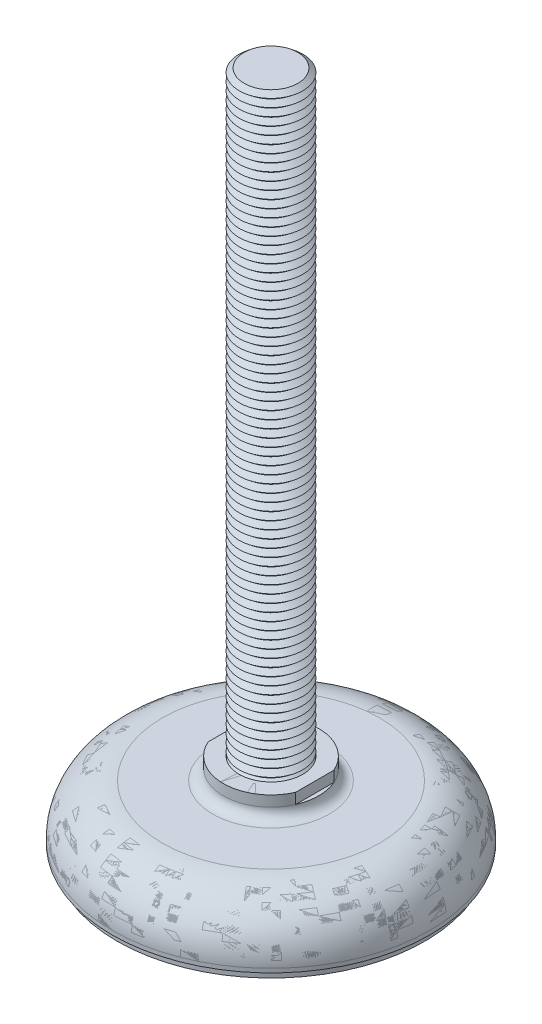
ISO-10303-21;
HEADER;
FILE_DESCRIPTION(('STEP AP214'),'2;1');
FILE_NAME('part.step','',(''),(''),'','','');
FILE_SCHEMA(('AUTOMOTIVE_DESIGN { 1 0 10303 214 1 1 1 1 }'));
ENDSEC;
DATA;
#1=APPLICATION_CONTEXT('core data for automotive mechanical design processes');
#2=APPLICATION_PROTOCOL_DEFINITION('international standard','automotive_design',2000,#1);
#3=PRODUCT_CONTEXT('',#1,'mechanical');
#4=PRODUCT('Part','Part','',(#3));
#5=PRODUCT_RELATED_PRODUCT_CATEGORY('part','',(#4));
#6=PRODUCT_DEFINITION_FORMATION('','',#4);
#7=PRODUCT_DEFINITION_CONTEXT('part definition',#1,'design');
#8=PRODUCT_DEFINITION('design','',#6,#7);
#9=PRODUCT_DEFINITION_SHAPE('','',#8);
#10=(LENGTH_UNIT() NAMED_UNIT(*) SI_UNIT(.MILLI.,.METRE.));
#11=(NAMED_UNIT(*) PLANE_ANGLE_UNIT() SI_UNIT($,.RADIAN.));
#12=(NAMED_UNIT(*) SI_UNIT($,.STERADIAN.) SOLID_ANGLE_UNIT());
#13=UNCERTAINTY_MEASURE_WITH_UNIT(LENGTH_MEASURE(1.E-05),#10,'distance_accuracy_value','');
#14=(GEOMETRIC_REPRESENTATION_CONTEXT(3) GLOBAL_UNCERTAINTY_ASSIGNED_CONTEXT((#13)) GLOBAL_UNIT_ASSIGNED_CONTEXT((#10,
#11,#12)) REPRESENTATION_CONTEXT('',''));
#15=CARTESIAN_POINT('',(0.,0.,0.));
#16=DIRECTION('',(0.,0.,1.));
#17=DIRECTION('',(1.,0.,0.));
#18=AXIS2_PLACEMENT_3D('',#15,#16,#17);
#19=CARTESIAN_POINT('',(0.,166.,0.));
#20=DIRECTION('',(0.,-1.,0.));
#21=DIRECTION('',(0.998136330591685,0.,-0.0610234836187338));
#22=AXIS2_PLACEMENT_3D('',#19,#20,#21);
#23=CONICAL_SURFACE('',#22,6.75100040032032,0.895664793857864);
#24=CARTESIAN_POINT('',(0.,165.,0.));
#25=DIRECTION('',(0.,-1.,0.));
#26=DIRECTION('',(0.998136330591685,0.,-0.0610234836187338));
#27=AXIS2_PLACEMENT_3D('',#24,#25,#26);
#28=CIRCLE('',#27,8.);
#29=CARTESIAN_POINT('',(7.98509064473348,165.,-0.488187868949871));
#30=VERTEX_POINT('',#29);
#31=EDGE_CURVE('P0_E37',#30,#30,#28,.T.);
#32=ORIENTED_EDGE('',*,*,#31,.F.);
#33=EDGE_LOOP('',(#32));
#34=FACE_BOUND('',#33,.T.);
#35=CARTESIAN_POINT('',(0.,166.,0.));
#36=DIRECTION('',(0.,-1.,0.));
#37=DIRECTION('',(0.998136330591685,0.,-0.0610234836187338));
#38=AXIS2_PLACEMENT_3D('',#35,#36,#37);
#39=CIRCLE('',#38,6.75100040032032);
#40=CARTESIAN_POINT('',(6.73841876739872,166.,-0.411969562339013));
#41=VERTEX_POINT('',#40);
#42=EDGE_CURVE('P0_E25',#41,#41,#39,.T.);
#43=ORIENTED_EDGE('',*,*,#42,.T.);
#44=EDGE_LOOP('',(#43));
#45=FACE_BOUND('',#44,.T.);
#46=ADVANCED_FACE('P0_F14',(#34,#45),#23,.T.);
#47=CARTESIAN_POINT('',(0.,167.,0.));
#48=DIRECTION('',(0.,1.,0.));
#49=DIRECTION('',(-0.998136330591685,0.,0.0610234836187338));
#50=AXIS2_PLACEMENT_3D('',#47,#48,#49);
#51=CONICAL_SURFACE('',#50,8.,0.895664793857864);
#52=ORIENTED_EDGE('',*,*,#42,.F.);
#53=EDGE_LOOP('',(#52));
#54=FACE_BOUND('',#53,.T.);
#55=CARTESIAN_POINT('',(0.,167.,0.));
#56=DIRECTION('',(0.,-1.,0.));
#57=DIRECTION('',(0.998136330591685,0.,-0.0610234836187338));
#58=AXIS2_PLACEMENT_3D('',#55,#56,#57);
#59=CIRCLE('',#58,8.);
#60=CARTESIAN_POINT('',(7.98509064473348,167.,-0.488187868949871));
#61=VERTEX_POINT('',#60);
#62=EDGE_CURVE('P0_E29',#61,#61,#59,.T.);
#63=ORIENTED_EDGE('',*,*,#62,.T.);
#64=EDGE_LOOP('',(#63));
#65=FACE_BOUND('',#64,.T.);
#66=ADVANCED_FACE('P0_F1447',(#54,#65),#51,.T.);
#67=CARTESIAN_POINT('',(0.,168.,0.));
#68=DIRECTION('',(0.,1.,0.));
#69=DIRECTION('',(-0.998136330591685,0.,0.0610234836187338));
#70=AXIS2_PLACEMENT_3D('',#67,#68,#69);
#71=PLANE('',#70);
#72=CARTESIAN_POINT('',(0.,168.,0.));
#73=DIRECTION('',(0.,-1.,0.));
#74=DIRECTION('',(0.998136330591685,0.,-0.0610234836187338));
#75=AXIS2_PLACEMENT_3D('',#72,#73,#74);
#76=CIRCLE('',#75,6.75100040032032);
#77=CARTESIAN_POINT('',(6.73841876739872,168.,-0.411969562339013));
#78=VERTEX_POINT('',#77);
#79=EDGE_CURVE('P0_E21',#78,#78,#76,.T.);
#80=ORIENTED_EDGE('',*,*,#79,.F.);
#81=EDGE_LOOP('',(#80));
#82=FACE_BOUND('',#81,.T.);
#83=ADVANCED_FACE('P0_F1453',(#82),#71,.T.);
#84=CARTESIAN_POINT('',(0.,168.,0.));
#85=DIRECTION('',(0.,-1.,0.));
#86=DIRECTION('',(0.998136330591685,0.,-0.0610234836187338));
#87=AXIS2_PLACEMENT_3D('',#84,#85,#86);
#88=CONICAL_SURFACE('',#87,6.75100040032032,0.895664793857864);
#89=ORIENTED_EDGE('',*,*,#62,.F.);
#90=EDGE_LOOP('',(#89));
#91=FACE_BOUND('',#90,.T.);
#92=ORIENTED_EDGE('',*,*,#79,.T.);
#93=EDGE_LOOP('',(#92));
#94=FACE_BOUND('',#93,.T.);
#95=ADVANCED_FACE('P0_F1436',(#91,#94),#88,.T.);
#96=CARTESIAN_POINT('',(0.,164.,0.));
#97=DIRECTION('',(0.,-1.,0.));
#98=DIRECTION('',(0.998136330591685,0.,-0.0610234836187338));
#99=AXIS2_PLACEMENT_3D('',#96,#97,#98);
#100=CONICAL_SURFACE('',#99,6.75100040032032,0.895664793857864);
#101=CARTESIAN_POINT('',(0.,163.,0.));
#102=DIRECTION('',(0.,-1.,0.));
#103=DIRECTION('',(0.998136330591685,0.,-0.0610234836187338));
#104=AXIS2_PLACEMENT_3D('',#101,#102,#103);
#105=CIRCLE('',#104,8.);
#106=CARTESIAN_POINT('',(7.98509064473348,163.,-0.488187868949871));
#107=VERTEX_POINT('',#106);
#108=EDGE_CURVE('P0_E43',#107,#107,#105,.T.);
#109=ORIENTED_EDGE('',*,*,#108,.F.);
#110=EDGE_LOOP('',(#109));
#111=FACE_BOUND('',#110,.T.);
#112=CARTESIAN_POINT('',(0.,164.,0.));
#113=DIRECTION('',(0.,-1.,0.));
#114=DIRECTION('',(0.998136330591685,0.,-0.0610234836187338));
#115=AXIS2_PLACEMENT_3D('',#112,#113,#114);
#116=CIRCLE('',#115,6.75100040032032);
#117=CARTESIAN_POINT('',(6.73841876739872,164.,-0.411969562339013));
#118=VERTEX_POINT('',#117);
#119=EDGE_CURVE('P0_E34',#118,#118,#116,.T.);
#120=ORIENTED_EDGE('',*,*,#119,.T.);
#121=EDGE_LOOP('',(#120));
#122=FACE_BOUND('',#121,.T.);
#123=ADVANCED_FACE('P0_F1433',(#111,#122),#100,.T.);
#124=CARTESIAN_POINT('',(0.,165.,0.));
#125=DIRECTION('',(0.,1.,0.));
#126=DIRECTION('',(-0.998136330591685,0.,0.0610234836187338));
#127=AXIS2_PLACEMENT_3D('',#124,#125,#126);
#128=CONICAL_SURFACE('',#127,8.,0.895664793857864);
#129=ORIENTED_EDGE('',*,*,#119,.F.);
#130=EDGE_LOOP('',(#129));
#131=FACE_BOUND('',#130,.T.);
#132=ORIENTED_EDGE('',*,*,#31,.T.);
#133=EDGE_LOOP('',(#132));
#134=FACE_BOUND('',#133,.T.);
#135=ADVANCED_FACE('P0_F1424',(#131,#134),#128,.T.);
#136=CARTESIAN_POINT('',(0.,162.,0.));
#137=DIRECTION('',(0.,-1.,0.));
#138=DIRECTION('',(0.998136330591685,0.,-0.0610234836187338));
#139=AXIS2_PLACEMENT_3D('',#136,#137,#138);
#140=CONICAL_SURFACE('',#139,6.75100040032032,0.895664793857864);
#141=CARTESIAN_POINT('',(0.,161.,0.));
#142=DIRECTION('',(0.,-1.,0.));
#143=DIRECTION('',(0.998136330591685,0.,-0.0610234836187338));
#144=AXIS2_PLACEMENT_3D('',#141,#142,#143);
#145=CIRCLE('',#144,8.);
#146=CARTESIAN_POINT('',(7.98509064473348,161.,-0.488187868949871));
#147=VERTEX_POINT('',#146);
#148=EDGE_CURVE('P0_E49',#147,#147,#145,.T.);
#149=ORIENTED_EDGE('',*,*,#148,.F.);
#150=EDGE_LOOP('',(#149));
#151=FACE_BOUND('',#150,.T.);
#152=CARTESIAN_POINT('',(0.,162.,0.));
#153=DIRECTION('',(0.,-1.,0.));
#154=DIRECTION('',(0.998136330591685,0.,-0.0610234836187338));
#155=AXIS2_PLACEMENT_3D('',#152,#153,#154);
#156=CIRCLE('',#155,6.75100040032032);
#157=CARTESIAN_POINT('',(6.73841876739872,162.,-0.411969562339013));
#158=VERTEX_POINT('',#157);
#159=EDGE_CURVE('P0_E40',#158,#158,#156,.T.);
#160=ORIENTED_EDGE('',*,*,#159,.T.);
#161=EDGE_LOOP('',(#160));
#162=FACE_BOUND('',#161,.T.);
#163=ADVANCED_FACE('P0_F1421',(#151,#162),#140,.T.);
#164=CARTESIAN_POINT('',(0.,163.,0.));
#165=DIRECTION('',(0.,1.,0.));
#166=DIRECTION('',(-0.998136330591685,0.,0.0610234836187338));
#167=AXIS2_PLACEMENT_3D('',#164,#165,#166);
#168=CONICAL_SURFACE('',#167,8.,0.895664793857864);
#169=ORIENTED_EDGE('',*,*,#159,.F.);
#170=EDGE_LOOP('',(#169));
#171=FACE_BOUND('',#170,.T.);
#172=ORIENTED_EDGE('',*,*,#108,.T.);
#173=EDGE_LOOP('',(#172));
#174=FACE_BOUND('',#173,.T.);
#175=ADVANCED_FACE('P0_F1412',(#171,#174),#168,.T.);
#176=CARTESIAN_POINT('',(0.,160.,0.));
#177=DIRECTION('',(0.,-1.,0.));
#178=DIRECTION('',(0.998136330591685,0.,-0.0610234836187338));
#179=AXIS2_PLACEMENT_3D('',#176,#177,#178);
#180=CONICAL_SURFACE('',#179,6.75100040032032,0.895664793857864);
#181=CARTESIAN_POINT('',(0.,159.,0.));
#182=DIRECTION('',(0.,-1.,0.));
#183=DIRECTION('',(0.998136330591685,0.,-0.0610234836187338));
#184=AXIS2_PLACEMENT_3D('',#181,#182,#183);
#185=CIRCLE('',#184,8.);
#186=CARTESIAN_POINT('',(7.98509064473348,159.,-0.488187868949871));
#187=VERTEX_POINT('',#186);
#188=EDGE_CURVE('P0_E55',#187,#187,#185,.T.);
#189=ORIENTED_EDGE('',*,*,#188,.F.);
#190=EDGE_LOOP('',(#189));
#191=FACE_BOUND('',#190,.T.);
#192=CARTESIAN_POINT('',(0.,160.,0.));
#193=DIRECTION('',(0.,-1.,0.));
#194=DIRECTION('',(0.998136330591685,0.,-0.0610234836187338));
#195=AXIS2_PLACEMENT_3D('',#192,#193,#194);
#196=CIRCLE('',#195,6.75100040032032);
#197=CARTESIAN_POINT('',(6.73841876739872,160.,-0.411969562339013));
#198=VERTEX_POINT('',#197);
#199=EDGE_CURVE('P0_E46',#198,#198,#196,.T.);
#200=ORIENTED_EDGE('',*,*,#199,.T.);
#201=EDGE_LOOP('',(#200));
#202=FACE_BOUND('',#201,.T.);
#203=ADVANCED_FACE('P0_F1409',(#191,#202),#180,.T.);
#204=CARTESIAN_POINT('',(0.,161.,0.));
#205=DIRECTION('',(0.,1.,0.));
#206=DIRECTION('',(-0.998136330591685,0.,0.0610234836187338));
#207=AXIS2_PLACEMENT_3D('',#204,#205,#206);
#208=CONICAL_SURFACE('',#207,8.,0.895664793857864);
#209=ORIENTED_EDGE('',*,*,#199,.F.);
#210=EDGE_LOOP('',(#209));
#211=FACE_BOUND('',#210,.T.);
#212=ORIENTED_EDGE('',*,*,#148,.T.);
#213=EDGE_LOOP('',(#212));
#214=FACE_BOUND('',#213,.T.);
#215=ADVANCED_FACE('P0_F1400',(#211,#214),#208,.T.);
#216=CARTESIAN_POINT('',(0.,158.,0.));
#217=DIRECTION('',(0.,-1.,0.));
#218=DIRECTION('',(0.998136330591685,0.,-0.0610234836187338));
#219=AXIS2_PLACEMENT_3D('',#216,#217,#218);
#220=CONICAL_SURFACE('',#219,6.75100040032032,0.895664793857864);
#221=CARTESIAN_POINT('',(0.,157.,0.));
#222=DIRECTION('',(0.,-1.,0.));
#223=DIRECTION('',(0.998136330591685,0.,-0.0610234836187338));
#224=AXIS2_PLACEMENT_3D('',#221,#222,#223);
#225=CIRCLE('',#224,8.);
#226=CARTESIAN_POINT('',(7.98509064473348,157.,-0.488187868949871));
#227=VERTEX_POINT('',#226);
#228=EDGE_CURVE('P0_E61',#227,#227,#225,.T.);
#229=ORIENTED_EDGE('',*,*,#228,.F.);
#230=EDGE_LOOP('',(#229));
#231=FACE_BOUND('',#230,.T.);
#232=CARTESIAN_POINT('',(0.,158.,0.));
#233=DIRECTION('',(0.,-1.,0.));
#234=DIRECTION('',(0.998136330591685,0.,-0.0610234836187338));
#235=AXIS2_PLACEMENT_3D('',#232,#233,#234);
#236=CIRCLE('',#235,6.75100040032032);
#237=CARTESIAN_POINT('',(6.73841876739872,158.,-0.411969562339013));
#238=VERTEX_POINT('',#237);
#239=EDGE_CURVE('P0_E52',#238,#238,#236,.T.);
#240=ORIENTED_EDGE('',*,*,#239,.T.);
#241=EDGE_LOOP('',(#240));
#242=FACE_BOUND('',#241,.T.);
#243=ADVANCED_FACE('P0_F1397',(#231,#242),#220,.T.);
#244=CARTESIAN_POINT('',(0.,159.,0.));
#245=DIRECTION('',(0.,1.,0.));
#246=DIRECTION('',(-0.998136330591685,0.,0.0610234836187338));
#247=AXIS2_PLACEMENT_3D('',#244,#245,#246);
#248=CONICAL_SURFACE('',#247,8.,0.895664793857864);
#249=ORIENTED_EDGE('',*,*,#239,.F.);
#250=EDGE_LOOP('',(#249));
#251=FACE_BOUND('',#250,.T.);
#252=ORIENTED_EDGE('',*,*,#188,.T.);
#253=EDGE_LOOP('',(#252));
#254=FACE_BOUND('',#253,.T.);
#255=ADVANCED_FACE('P0_F1388',(#251,#254),#248,.T.);
#256=CARTESIAN_POINT('',(0.,156.,0.));
#257=DIRECTION('',(0.,-1.,0.));
#258=DIRECTION('',(0.998136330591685,0.,-0.0610234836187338));
#259=AXIS2_PLACEMENT_3D('',#256,#257,#258);
#260=CONICAL_SURFACE('',#259,6.75100040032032,0.895664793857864);
#261=CARTESIAN_POINT('',(0.,155.,0.));
#262=DIRECTION('',(0.,-1.,0.));
#263=DIRECTION('',(0.998136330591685,0.,-0.0610234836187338));
#264=AXIS2_PLACEMENT_3D('',#261,#262,#263);
#265=CIRCLE('',#264,8.);
#266=CARTESIAN_POINT('',(7.98509064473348,155.,-0.488187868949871));
#267=VERTEX_POINT('',#266);
#268=EDGE_CURVE('P0_E67',#267,#267,#265,.T.);
#269=ORIENTED_EDGE('',*,*,#268,.F.);
#270=EDGE_LOOP('',(#269));
#271=FACE_BOUND('',#270,.T.);
#272=CARTESIAN_POINT('',(0.,156.,0.));
#273=DIRECTION('',(0.,-1.,0.));
#274=DIRECTION('',(0.998136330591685,0.,-0.0610234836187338));
#275=AXIS2_PLACEMENT_3D('',#272,#273,#274);
#276=CIRCLE('',#275,6.75100040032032);
#277=CARTESIAN_POINT('',(6.73841876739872,156.,-0.411969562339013));
#278=VERTEX_POINT('',#277);
#279=EDGE_CURVE('P0_E58',#278,#278,#276,.T.);
#280=ORIENTED_EDGE('',*,*,#279,.T.);
#281=EDGE_LOOP('',(#280));
#282=FACE_BOUND('',#281,.T.);
#283=ADVANCED_FACE('P0_F1385',(#271,#282),#260,.T.);
#284=CARTESIAN_POINT('',(0.,157.,0.));
#285=DIRECTION('',(0.,1.,0.));
#286=DIRECTION('',(-0.998136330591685,0.,0.0610234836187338));
#287=AXIS2_PLACEMENT_3D('',#284,#285,#286);
#288=CONICAL_SURFACE('',#287,8.,0.895664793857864);
#289=ORIENTED_EDGE('',*,*,#279,.F.);
#290=EDGE_LOOP('',(#289));
#291=FACE_BOUND('',#290,.T.);
#292=ORIENTED_EDGE('',*,*,#228,.T.);
#293=EDGE_LOOP('',(#292));
#294=FACE_BOUND('',#293,.T.);
#295=ADVANCED_FACE('P0_F1376',(#291,#294),#288,.T.);
#296=CARTESIAN_POINT('',(0.,154.,0.));
#297=DIRECTION('',(0.,-1.,0.));
#298=DIRECTION('',(0.998136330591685,0.,-0.0610234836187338));
#299=AXIS2_PLACEMENT_3D('',#296,#297,#298);
#300=CONICAL_SURFACE('',#299,6.75100040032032,0.895664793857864);
#301=CARTESIAN_POINT('',(0.,153.,0.));
#302=DIRECTION('',(0.,-1.,0.));
#303=DIRECTION('',(0.998136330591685,0.,-0.0610234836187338));
#304=AXIS2_PLACEMENT_3D('',#301,#302,#303);
#305=CIRCLE('',#304,8.);
#306=CARTESIAN_POINT('',(7.98509064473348,153.,-0.488187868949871));
#307=VERTEX_POINT('',#306);
#308=EDGE_CURVE('P0_E73',#307,#307,#305,.T.);
#309=ORIENTED_EDGE('',*,*,#308,.F.);
#310=EDGE_LOOP('',(#309));
#311=FACE_BOUND('',#310,.T.);
#312=CARTESIAN_POINT('',(0.,154.,0.));
#313=DIRECTION('',(0.,-1.,0.));
#314=DIRECTION('',(0.998136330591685,0.,-0.0610234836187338));
#315=AXIS2_PLACEMENT_3D('',#312,#313,#314);
#316=CIRCLE('',#315,6.75100040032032);
#317=CARTESIAN_POINT('',(6.73841876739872,154.,-0.411969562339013));
#318=VERTEX_POINT('',#317);
#319=EDGE_CURVE('P0_E64',#318,#318,#316,.T.);
#320=ORIENTED_EDGE('',*,*,#319,.T.);
#321=EDGE_LOOP('',(#320));
#322=FACE_BOUND('',#321,.T.);
#323=ADVANCED_FACE('P0_F1373',(#311,#322),#300,.T.);
#324=CARTESIAN_POINT('',(0.,155.,0.));
#325=DIRECTION('',(0.,1.,0.));
#326=DIRECTION('',(-0.998136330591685,0.,0.0610234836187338));
#327=AXIS2_PLACEMENT_3D('',#324,#325,#326);
#328=CONICAL_SURFACE('',#327,8.,0.895664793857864);
#329=ORIENTED_EDGE('',*,*,#319,.F.);
#330=EDGE_LOOP('',(#329));
#331=FACE_BOUND('',#330,.T.);
#332=ORIENTED_EDGE('',*,*,#268,.T.);
#333=EDGE_LOOP('',(#332));
#334=FACE_BOUND('',#333,.T.);
#335=ADVANCED_FACE('P0_F1364',(#331,#334),#328,.T.);
#336=CARTESIAN_POINT('',(0.,152.,0.));
#337=DIRECTION('',(0.,-1.,0.));
#338=DIRECTION('',(0.998136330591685,0.,-0.0610234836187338));
#339=AXIS2_PLACEMENT_3D('',#336,#337,#338);
#340=CONICAL_SURFACE('',#339,6.75100040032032,0.895664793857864);
#341=CARTESIAN_POINT('',(0.,151.,0.));
#342=DIRECTION('',(0.,-1.,0.));
#343=DIRECTION('',(0.998136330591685,0.,-0.0610234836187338));
#344=AXIS2_PLACEMENT_3D('',#341,#342,#343);
#345=CIRCLE('',#344,8.);
#346=CARTESIAN_POINT('',(7.98509064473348,151.,-0.488187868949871));
#347=VERTEX_POINT('',#346);
#348=EDGE_CURVE('P0_E79',#347,#347,#345,.T.);
#349=ORIENTED_EDGE('',*,*,#348,.F.);
#350=EDGE_LOOP('',(#349));
#351=FACE_BOUND('',#350,.T.);
#352=CARTESIAN_POINT('',(0.,152.,0.));
#353=DIRECTION('',(0.,-1.,0.));
#354=DIRECTION('',(0.998136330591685,0.,-0.0610234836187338));
#355=AXIS2_PLACEMENT_3D('',#352,#353,#354);
#356=CIRCLE('',#355,6.75100040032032);
#357=CARTESIAN_POINT('',(6.73841876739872,152.,-0.411969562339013));
#358=VERTEX_POINT('',#357);
#359=EDGE_CURVE('P0_E70',#358,#358,#356,.T.);
#360=ORIENTED_EDGE('',*,*,#359,.T.);
#361=EDGE_LOOP('',(#360));
#362=FACE_BOUND('',#361,.T.);
#363=ADVANCED_FACE('P0_F1361',(#351,#362),#340,.T.);
#364=CARTESIAN_POINT('',(0.,153.,0.));
#365=DIRECTION('',(0.,1.,0.));
#366=DIRECTION('',(-0.998136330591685,0.,0.0610234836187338));
#367=AXIS2_PLACEMENT_3D('',#364,#365,#366);
#368=CONICAL_SURFACE('',#367,8.,0.895664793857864);
#369=ORIENTED_EDGE('',*,*,#359,.F.);
#370=EDGE_LOOP('',(#369));
#371=FACE_BOUND('',#370,.T.);
#372=ORIENTED_EDGE('',*,*,#308,.T.);
#373=EDGE_LOOP('',(#372));
#374=FACE_BOUND('',#373,.T.);
#375=ADVANCED_FACE('P0_F1352',(#371,#374),#368,.T.);
#376=CARTESIAN_POINT('',(0.,150.,0.));
#377=DIRECTION('',(0.,-1.,0.));
#378=DIRECTION('',(0.998136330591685,0.,-0.0610234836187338));
#379=AXIS2_PLACEMENT_3D('',#376,#377,#378);
#380=CONICAL_SURFACE('',#379,6.75100040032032,0.895664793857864);
#381=CARTESIAN_POINT('',(0.,149.,0.));
#382=DIRECTION('',(0.,-1.,0.));
#383=DIRECTION('',(0.998136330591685,0.,-0.0610234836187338));
#384=AXIS2_PLACEMENT_3D('',#381,#382,#383);
#385=CIRCLE('',#384,8.);
#386=CARTESIAN_POINT('',(7.98509064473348,149.,-0.488187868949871));
#387=VERTEX_POINT('',#386);
#388=EDGE_CURVE('P0_E85',#387,#387,#385,.T.);
#389=ORIENTED_EDGE('',*,*,#388,.F.);
#390=EDGE_LOOP('',(#389));
#391=FACE_BOUND('',#390,.T.);
#392=CARTESIAN_POINT('',(0.,150.,0.));
#393=DIRECTION('',(0.,-1.,0.));
#394=DIRECTION('',(0.998136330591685,0.,-0.0610234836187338));
#395=AXIS2_PLACEMENT_3D('',#392,#393,#394);
#396=CIRCLE('',#395,6.75100040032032);
#397=CARTESIAN_POINT('',(6.73841876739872,150.,-0.411969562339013));
#398=VERTEX_POINT('',#397);
#399=EDGE_CURVE('P0_E76',#398,#398,#396,.T.);
#400=ORIENTED_EDGE('',*,*,#399,.T.);
#401=EDGE_LOOP('',(#400));
#402=FACE_BOUND('',#401,.T.);
#403=ADVANCED_FACE('P0_F1349',(#391,#402),#380,.T.);
#404=CARTESIAN_POINT('',(0.,151.,0.));
#405=DIRECTION('',(0.,1.,0.));
#406=DIRECTION('',(-0.998136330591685,0.,0.0610234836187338));
#407=AXIS2_PLACEMENT_3D('',#404,#405,#406);
#408=CONICAL_SURFACE('',#407,8.,0.895664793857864);
#409=ORIENTED_EDGE('',*,*,#399,.F.);
#410=EDGE_LOOP('',(#409));
#411=FACE_BOUND('',#410,.T.);
#412=ORIENTED_EDGE('',*,*,#348,.T.);
#413=EDGE_LOOP('',(#412));
#414=FACE_BOUND('',#413,.T.);
#415=ADVANCED_FACE('P0_F1340',(#411,#414),#408,.T.);
#416=CARTESIAN_POINT('',(0.,148.,0.));
#417=DIRECTION('',(0.,-1.,0.));
#418=DIRECTION('',(0.998136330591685,0.,-0.0610234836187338));
#419=AXIS2_PLACEMENT_3D('',#416,#417,#418);
#420=CONICAL_SURFACE('',#419,6.75100040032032,0.895664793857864);
#421=CARTESIAN_POINT('',(0.,147.,0.));
#422=DIRECTION('',(0.,-1.,0.));
#423=DIRECTION('',(0.998136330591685,0.,-0.0610234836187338));
#424=AXIS2_PLACEMENT_3D('',#421,#422,#423);
#425=CIRCLE('',#424,8.);
#426=CARTESIAN_POINT('',(7.98509064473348,147.,-0.488187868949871));
#427=VERTEX_POINT('',#426);
#428=EDGE_CURVE('P0_E91',#427,#427,#425,.T.);
#429=ORIENTED_EDGE('',*,*,#428,.F.);
#430=EDGE_LOOP('',(#429));
#431=FACE_BOUND('',#430,.T.);
#432=CARTESIAN_POINT('',(0.,148.,0.));
#433=DIRECTION('',(0.,-1.,0.));
#434=DIRECTION('',(0.998136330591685,0.,-0.0610234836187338));
#435=AXIS2_PLACEMENT_3D('',#432,#433,#434);
#436=CIRCLE('',#435,6.75100040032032);
#437=CARTESIAN_POINT('',(6.73841876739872,148.,-0.411969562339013));
#438=VERTEX_POINT('',#437);
#439=EDGE_CURVE('P0_E82',#438,#438,#436,.T.);
#440=ORIENTED_EDGE('',*,*,#439,.T.);
#441=EDGE_LOOP('',(#440));
#442=FACE_BOUND('',#441,.T.);
#443=ADVANCED_FACE('P0_F1337',(#431,#442),#420,.T.);
#444=CARTESIAN_POINT('',(0.,149.,0.));
#445=DIRECTION('',(0.,1.,0.));
#446=DIRECTION('',(-0.998136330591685,0.,0.0610234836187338));
#447=AXIS2_PLACEMENT_3D('',#444,#445,#446);
#448=CONICAL_SURFACE('',#447,8.,0.895664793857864);
#449=ORIENTED_EDGE('',*,*,#439,.F.);
#450=EDGE_LOOP('',(#449));
#451=FACE_BOUND('',#450,.T.);
#452=ORIENTED_EDGE('',*,*,#388,.T.);
#453=EDGE_LOOP('',(#452));
#454=FACE_BOUND('',#453,.T.);
#455=ADVANCED_FACE('P0_F1328',(#451,#454),#448,.T.);
#456=CARTESIAN_POINT('',(0.,146.,0.));
#457=DIRECTION('',(0.,-1.,0.));
#458=DIRECTION('',(0.998136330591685,0.,-0.0610234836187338));
#459=AXIS2_PLACEMENT_3D('',#456,#457,#458);
#460=CONICAL_SURFACE('',#459,6.75100040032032,0.895664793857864);
#461=CARTESIAN_POINT('',(0.,145.,0.));
#462=DIRECTION('',(0.,-1.,0.));
#463=DIRECTION('',(0.998136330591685,0.,-0.0610234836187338));
#464=AXIS2_PLACEMENT_3D('',#461,#462,#463);
#465=CIRCLE('',#464,8.);
#466=CARTESIAN_POINT('',(7.98509064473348,145.,-0.488187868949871));
#467=VERTEX_POINT('',#466);
#468=EDGE_CURVE('P0_E97',#467,#467,#465,.T.);
#469=ORIENTED_EDGE('',*,*,#468,.F.);
#470=EDGE_LOOP('',(#469));
#471=FACE_BOUND('',#470,.T.);
#472=CARTESIAN_POINT('',(0.,146.,0.));
#473=DIRECTION('',(0.,-1.,0.));
#474=DIRECTION('',(0.998136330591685,0.,-0.0610234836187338));
#475=AXIS2_PLACEMENT_3D('',#472,#473,#474);
#476=CIRCLE('',#475,6.75100040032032);
#477=CARTESIAN_POINT('',(6.73841876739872,146.,-0.411969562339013));
#478=VERTEX_POINT('',#477);
#479=EDGE_CURVE('P0_E88',#478,#478,#476,.T.);
#480=ORIENTED_EDGE('',*,*,#479,.T.);
#481=EDGE_LOOP('',(#480));
#482=FACE_BOUND('',#481,.T.);
#483=ADVANCED_FACE('P0_F1325',(#471,#482),#460,.T.);
#484=CARTESIAN_POINT('',(0.,147.,0.));
#485=DIRECTION('',(0.,1.,0.));
#486=DIRECTION('',(-0.998136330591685,0.,0.0610234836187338));
#487=AXIS2_PLACEMENT_3D('',#484,#485,#486);
#488=CONICAL_SURFACE('',#487,8.,0.895664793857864);
#489=ORIENTED_EDGE('',*,*,#479,.F.);
#490=EDGE_LOOP('',(#489));
#491=FACE_BOUND('',#490,.T.);
#492=ORIENTED_EDGE('',*,*,#428,.T.);
#493=EDGE_LOOP('',(#492));
#494=FACE_BOUND('',#493,.T.);
#495=ADVANCED_FACE('P0_F1316',(#491,#494),#488,.T.);
#496=CARTESIAN_POINT('',(0.,144.,0.));
#497=DIRECTION('',(0.,-1.,0.));
#498=DIRECTION('',(0.998136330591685,0.,-0.0610234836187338));
#499=AXIS2_PLACEMENT_3D('',#496,#497,#498);
#500=CONICAL_SURFACE('',#499,6.75100040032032,0.895664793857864);
#501=CARTESIAN_POINT('',(0.,143.,0.));
#502=DIRECTION('',(0.,-1.,0.));
#503=DIRECTION('',(0.998136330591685,0.,-0.0610234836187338));
#504=AXIS2_PLACEMENT_3D('',#501,#502,#503);
#505=CIRCLE('',#504,8.);
#506=CARTESIAN_POINT('',(7.98509064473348,143.,-0.488187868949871));
#507=VERTEX_POINT('',#506);
#508=EDGE_CURVE('P0_E103',#507,#507,#505,.T.);
#509=ORIENTED_EDGE('',*,*,#508,.F.);
#510=EDGE_LOOP('',(#509));
#511=FACE_BOUND('',#510,.T.);
#512=CARTESIAN_POINT('',(0.,144.,0.));
#513=DIRECTION('',(0.,-1.,0.));
#514=DIRECTION('',(0.998136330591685,0.,-0.0610234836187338));
#515=AXIS2_PLACEMENT_3D('',#512,#513,#514);
#516=CIRCLE('',#515,6.75100040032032);
#517=CARTESIAN_POINT('',(6.73841876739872,144.,-0.411969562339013));
#518=VERTEX_POINT('',#517);
#519=EDGE_CURVE('P0_E94',#518,#518,#516,.T.);
#520=ORIENTED_EDGE('',*,*,#519,.T.);
#521=EDGE_LOOP('',(#520));
#522=FACE_BOUND('',#521,.T.);
#523=ADVANCED_FACE('P0_F1313',(#511,#522),#500,.T.);
#524=CARTESIAN_POINT('',(0.,145.,0.));
#525=DIRECTION('',(0.,1.,0.));
#526=DIRECTION('',(-0.998136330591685,0.,0.0610234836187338));
#527=AXIS2_PLACEMENT_3D('',#524,#525,#526);
#528=CONICAL_SURFACE('',#527,8.,0.895664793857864);
#529=ORIENTED_EDGE('',*,*,#519,.F.);
#530=EDGE_LOOP('',(#529));
#531=FACE_BOUND('',#530,.T.);
#532=ORIENTED_EDGE('',*,*,#468,.T.);
#533=EDGE_LOOP('',(#532));
#534=FACE_BOUND('',#533,.T.);
#535=ADVANCED_FACE('P0_F1304',(#531,#534),#528,.T.);
#536=CARTESIAN_POINT('',(0.,142.,0.));
#537=DIRECTION('',(0.,-1.,0.));
#538=DIRECTION('',(0.998136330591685,0.,-0.0610234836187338));
#539=AXIS2_PLACEMENT_3D('',#536,#537,#538);
#540=CONICAL_SURFACE('',#539,6.75100040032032,0.895664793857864);
#541=CARTESIAN_POINT('',(0.,141.,0.));
#542=DIRECTION('',(0.,-1.,0.));
#543=DIRECTION('',(0.998136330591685,0.,-0.0610234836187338));
#544=AXIS2_PLACEMENT_3D('',#541,#542,#543);
#545=CIRCLE('',#544,8.);
#546=CARTESIAN_POINT('',(7.98509064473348,141.,-0.488187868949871));
#547=VERTEX_POINT('',#546);
#548=EDGE_CURVE('P0_E109',#547,#547,#545,.T.);
#549=ORIENTED_EDGE('',*,*,#548,.F.);
#550=EDGE_LOOP('',(#549));
#551=FACE_BOUND('',#550,.T.);
#552=CARTESIAN_POINT('',(0.,142.,0.));
#553=DIRECTION('',(0.,-1.,0.));
#554=DIRECTION('',(0.998136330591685,0.,-0.0610234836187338));
#555=AXIS2_PLACEMENT_3D('',#552,#553,#554);
#556=CIRCLE('',#555,6.75100040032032);
#557=CARTESIAN_POINT('',(6.73841876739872,142.,-0.411969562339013));
#558=VERTEX_POINT('',#557);
#559=EDGE_CURVE('P0_E100',#558,#558,#556,.T.);
#560=ORIENTED_EDGE('',*,*,#559,.T.);
#561=EDGE_LOOP('',(#560));
#562=FACE_BOUND('',#561,.T.);
#563=ADVANCED_FACE('P0_F1301',(#551,#562),#540,.T.);
#564=CARTESIAN_POINT('',(0.,143.,0.));
#565=DIRECTION('',(0.,1.,0.));
#566=DIRECTION('',(-0.998136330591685,0.,0.0610234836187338));
#567=AXIS2_PLACEMENT_3D('',#564,#565,#566);
#568=CONICAL_SURFACE('',#567,8.,0.895664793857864);
#569=ORIENTED_EDGE('',*,*,#559,.F.);
#570=EDGE_LOOP('',(#569));
#571=FACE_BOUND('',#570,.T.);
#572=ORIENTED_EDGE('',*,*,#508,.T.);
#573=EDGE_LOOP('',(#572));
#574=FACE_BOUND('',#573,.T.);
#575=ADVANCED_FACE('P0_F1292',(#571,#574),#568,.T.);
#576=CARTESIAN_POINT('',(0.,140.,0.));
#577=DIRECTION('',(0.,-1.,0.));
#578=DIRECTION('',(0.998136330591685,0.,-0.0610234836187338));
#579=AXIS2_PLACEMENT_3D('',#576,#577,#578);
#580=CONICAL_SURFACE('',#579,6.75100040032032,0.895664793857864);
#581=CARTESIAN_POINT('',(0.,139.,0.));
#582=DIRECTION('',(0.,-1.,0.));
#583=DIRECTION('',(0.998136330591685,0.,-0.0610234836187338));
#584=AXIS2_PLACEMENT_3D('',#581,#582,#583);
#585=CIRCLE('',#584,8.);
#586=CARTESIAN_POINT('',(7.98509064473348,139.,-0.488187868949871));
#587=VERTEX_POINT('',#586);
#588=EDGE_CURVE('P0_E115',#587,#587,#585,.T.);
#589=ORIENTED_EDGE('',*,*,#588,.F.);
#590=EDGE_LOOP('',(#589));
#591=FACE_BOUND('',#590,.T.);
#592=CARTESIAN_POINT('',(0.,140.,0.));
#593=DIRECTION('',(0.,-1.,0.));
#594=DIRECTION('',(0.998136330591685,0.,-0.0610234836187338));
#595=AXIS2_PLACEMENT_3D('',#592,#593,#594);
#596=CIRCLE('',#595,6.75100040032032);
#597=CARTESIAN_POINT('',(6.73841876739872,140.,-0.411969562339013));
#598=VERTEX_POINT('',#597);
#599=EDGE_CURVE('P0_E106',#598,#598,#596,.T.);
#600=ORIENTED_EDGE('',*,*,#599,.T.);
#601=EDGE_LOOP('',(#600));
#602=FACE_BOUND('',#601,.T.);
#603=ADVANCED_FACE('P0_F1289',(#591,#602),#580,.T.);
#604=CARTESIAN_POINT('',(0.,141.,0.));
#605=DIRECTION('',(0.,1.,0.));
#606=DIRECTION('',(-0.998136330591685,0.,0.0610234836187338));
#607=AXIS2_PLACEMENT_3D('',#604,#605,#606);
#608=CONICAL_SURFACE('',#607,8.,0.895664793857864);
#609=ORIENTED_EDGE('',*,*,#599,.F.);
#610=EDGE_LOOP('',(#609));
#611=FACE_BOUND('',#610,.T.);
#612=ORIENTED_EDGE('',*,*,#548,.T.);
#613=EDGE_LOOP('',(#612));
#614=FACE_BOUND('',#613,.T.);
#615=ADVANCED_FACE('P0_F1280',(#611,#614),#608,.T.);
#616=CARTESIAN_POINT('',(0.,138.,0.));
#617=DIRECTION('',(0.,-1.,0.));
#618=DIRECTION('',(0.998136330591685,0.,-0.0610234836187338));
#619=AXIS2_PLACEMENT_3D('',#616,#617,#618);
#620=CONICAL_SURFACE('',#619,6.75100040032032,0.895664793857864);
#621=CARTESIAN_POINT('',(0.,137.,0.));
#622=DIRECTION('',(0.,-1.,0.));
#623=DIRECTION('',(0.998136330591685,0.,-0.0610234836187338));
#624=AXIS2_PLACEMENT_3D('',#621,#622,#623);
#625=CIRCLE('',#624,8.);
#626=CARTESIAN_POINT('',(7.98509064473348,137.,-0.488187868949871));
#627=VERTEX_POINT('',#626);
#628=EDGE_CURVE('P0_E121',#627,#627,#625,.T.);
#629=ORIENTED_EDGE('',*,*,#628,.F.);
#630=EDGE_LOOP('',(#629));
#631=FACE_BOUND('',#630,.T.);
#632=CARTESIAN_POINT('',(0.,138.,0.));
#633=DIRECTION('',(0.,-1.,0.));
#634=DIRECTION('',(0.998136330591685,0.,-0.0610234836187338));
#635=AXIS2_PLACEMENT_3D('',#632,#633,#634);
#636=CIRCLE('',#635,6.75100040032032);
#637=CARTESIAN_POINT('',(6.73841876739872,138.,-0.411969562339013));
#638=VERTEX_POINT('',#637);
#639=EDGE_CURVE('P0_E112',#638,#638,#636,.T.);
#640=ORIENTED_EDGE('',*,*,#639,.T.);
#641=EDGE_LOOP('',(#640));
#642=FACE_BOUND('',#641,.T.);
#643=ADVANCED_FACE('P0_F1277',(#631,#642),#620,.T.);
#644=CARTESIAN_POINT('',(0.,139.,0.));
#645=DIRECTION('',(0.,1.,0.));
#646=DIRECTION('',(-0.998136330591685,0.,0.0610234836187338));
#647=AXIS2_PLACEMENT_3D('',#644,#645,#646);
#648=CONICAL_SURFACE('',#647,8.,0.895664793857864);
#649=ORIENTED_EDGE('',*,*,#639,.F.);
#650=EDGE_LOOP('',(#649));
#651=FACE_BOUND('',#650,.T.);
#652=ORIENTED_EDGE('',*,*,#588,.T.);
#653=EDGE_LOOP('',(#652));
#654=FACE_BOUND('',#653,.T.);
#655=ADVANCED_FACE('P0_F1268',(#651,#654),#648,.T.);
#656=CARTESIAN_POINT('',(0.,136.,0.));
#657=DIRECTION('',(0.,-1.,0.));
#658=DIRECTION('',(0.998136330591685,0.,-0.0610234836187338));
#659=AXIS2_PLACEMENT_3D('',#656,#657,#658);
#660=CONICAL_SURFACE('',#659,6.75100040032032,0.895664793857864);
#661=CARTESIAN_POINT('',(0.,135.,0.));
#662=DIRECTION('',(0.,-1.,0.));
#663=DIRECTION('',(0.998136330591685,0.,-0.0610234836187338));
#664=AXIS2_PLACEMENT_3D('',#661,#662,#663);
#665=CIRCLE('',#664,8.);
#666=CARTESIAN_POINT('',(7.98509064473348,135.,-0.488187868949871));
#667=VERTEX_POINT('',#666);
#668=EDGE_CURVE('P0_E127',#667,#667,#665,.T.);
#669=ORIENTED_EDGE('',*,*,#668,.F.);
#670=EDGE_LOOP('',(#669));
#671=FACE_BOUND('',#670,.T.);
#672=CARTESIAN_POINT('',(0.,136.,0.));
#673=DIRECTION('',(0.,-1.,0.));
#674=DIRECTION('',(0.998136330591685,0.,-0.0610234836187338));
#675=AXIS2_PLACEMENT_3D('',#672,#673,#674);
#676=CIRCLE('',#675,6.75100040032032);
#677=CARTESIAN_POINT('',(6.73841876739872,136.,-0.411969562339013));
#678=VERTEX_POINT('',#677);
#679=EDGE_CURVE('P0_E118',#678,#678,#676,.T.);
#680=ORIENTED_EDGE('',*,*,#679,.T.);
#681=EDGE_LOOP('',(#680));
#682=FACE_BOUND('',#681,.T.);
#683=ADVANCED_FACE('P0_F1265',(#671,#682),#660,.T.);
#684=CARTESIAN_POINT('',(0.,137.,0.));
#685=DIRECTION('',(0.,1.,0.));
#686=DIRECTION('',(-0.998136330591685,0.,0.0610234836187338));
#687=AXIS2_PLACEMENT_3D('',#684,#685,#686);
#688=CONICAL_SURFACE('',#687,8.,0.895664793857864);
#689=ORIENTED_EDGE('',*,*,#679,.F.);
#690=EDGE_LOOP('',(#689));
#691=FACE_BOUND('',#690,.T.);
#692=ORIENTED_EDGE('',*,*,#628,.T.);
#693=EDGE_LOOP('',(#692));
#694=FACE_BOUND('',#693,.T.);
#695=ADVANCED_FACE('P0_F1256',(#691,#694),#688,.T.);
#696=CARTESIAN_POINT('',(0.,134.,0.));
#697=DIRECTION('',(0.,-1.,0.));
#698=DIRECTION('',(0.998136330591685,0.,-0.0610234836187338));
#699=AXIS2_PLACEMENT_3D('',#696,#697,#698);
#700=CONICAL_SURFACE('',#699,6.75100040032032,0.895664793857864);
#701=CARTESIAN_POINT('',(0.,133.,0.));
#702=DIRECTION('',(0.,-1.,0.));
#703=DIRECTION('',(0.998136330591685,0.,-0.0610234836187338));
#704=AXIS2_PLACEMENT_3D('',#701,#702,#703);
#705=CIRCLE('',#704,8.);
#706=CARTESIAN_POINT('',(7.98509064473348,133.,-0.488187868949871));
#707=VERTEX_POINT('',#706);
#708=EDGE_CURVE('P0_E133',#707,#707,#705,.T.);
#709=ORIENTED_EDGE('',*,*,#708,.F.);
#710=EDGE_LOOP('',(#709));
#711=FACE_BOUND('',#710,.T.);
#712=CARTESIAN_POINT('',(0.,134.,0.));
#713=DIRECTION('',(0.,-1.,0.));
#714=DIRECTION('',(0.998136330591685,0.,-0.0610234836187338));
#715=AXIS2_PLACEMENT_3D('',#712,#713,#714);
#716=CIRCLE('',#715,6.75100040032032);
#717=CARTESIAN_POINT('',(6.73841876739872,134.,-0.411969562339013));
#718=VERTEX_POINT('',#717);
#719=EDGE_CURVE('P0_E124',#718,#718,#716,.T.);
#720=ORIENTED_EDGE('',*,*,#719,.T.);
#721=EDGE_LOOP('',(#720));
#722=FACE_BOUND('',#721,.T.);
#723=ADVANCED_FACE('P0_F1253',(#711,#722),#700,.T.);
#724=CARTESIAN_POINT('',(0.,135.,0.));
#725=DIRECTION('',(0.,1.,0.));
#726=DIRECTION('',(-0.998136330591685,0.,0.0610234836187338));
#727=AXIS2_PLACEMENT_3D('',#724,#725,#726);
#728=CONICAL_SURFACE('',#727,8.,0.895664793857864);
#729=ORIENTED_EDGE('',*,*,#719,.F.);
#730=EDGE_LOOP('',(#729));
#731=FACE_BOUND('',#730,.T.);
#732=ORIENTED_EDGE('',*,*,#668,.T.);
#733=EDGE_LOOP('',(#732));
#734=FACE_BOUND('',#733,.T.);
#735=ADVANCED_FACE('P0_F1244',(#731,#734),#728,.T.);
#736=CARTESIAN_POINT('',(0.,132.,0.));
#737=DIRECTION('',(0.,-1.,0.));
#738=DIRECTION('',(0.998136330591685,0.,-0.0610234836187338));
#739=AXIS2_PLACEMENT_3D('',#736,#737,#738);
#740=CONICAL_SURFACE('',#739,6.75100040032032,0.895664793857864);
#741=CARTESIAN_POINT('',(0.,131.,0.));
#742=DIRECTION('',(0.,-1.,0.));
#743=DIRECTION('',(0.998136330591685,0.,-0.0610234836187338));
#744=AXIS2_PLACEMENT_3D('',#741,#742,#743);
#745=CIRCLE('',#744,8.);
#746=CARTESIAN_POINT('',(7.98509064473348,131.,-0.488187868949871));
#747=VERTEX_POINT('',#746);
#748=EDGE_CURVE('P0_E139',#747,#747,#745,.T.);
#749=ORIENTED_EDGE('',*,*,#748,.F.);
#750=EDGE_LOOP('',(#749));
#751=FACE_BOUND('',#750,.T.);
#752=CARTESIAN_POINT('',(0.,132.,0.));
#753=DIRECTION('',(0.,-1.,0.));
#754=DIRECTION('',(0.998136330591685,0.,-0.0610234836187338));
#755=AXIS2_PLACEMENT_3D('',#752,#753,#754);
#756=CIRCLE('',#755,6.75100040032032);
#757=CARTESIAN_POINT('',(6.73841876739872,132.,-0.411969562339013));
#758=VERTEX_POINT('',#757);
#759=EDGE_CURVE('P0_E130',#758,#758,#756,.T.);
#760=ORIENTED_EDGE('',*,*,#759,.T.);
#761=EDGE_LOOP('',(#760));
#762=FACE_BOUND('',#761,.T.);
#763=ADVANCED_FACE('P0_F1241',(#751,#762),#740,.T.);
#764=CARTESIAN_POINT('',(0.,133.,0.));
#765=DIRECTION('',(0.,1.,0.));
#766=DIRECTION('',(-0.998136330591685,0.,0.0610234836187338));
#767=AXIS2_PLACEMENT_3D('',#764,#765,#766);
#768=CONICAL_SURFACE('',#767,8.,0.895664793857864);
#769=ORIENTED_EDGE('',*,*,#759,.F.);
#770=EDGE_LOOP('',(#769));
#771=FACE_BOUND('',#770,.T.);
#772=ORIENTED_EDGE('',*,*,#708,.T.);
#773=EDGE_LOOP('',(#772));
#774=FACE_BOUND('',#773,.T.);
#775=ADVANCED_FACE('P0_F1232',(#771,#774),#768,.T.);
#776=CARTESIAN_POINT('',(0.,130.,0.));
#777=DIRECTION('',(0.,-1.,0.));
#778=DIRECTION('',(0.998136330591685,0.,-0.0610234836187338));
#779=AXIS2_PLACEMENT_3D('',#776,#777,#778);
#780=CONICAL_SURFACE('',#779,6.75100040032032,0.895664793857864);
#781=CARTESIAN_POINT('',(0.,129.,0.));
#782=DIRECTION('',(0.,-1.,0.));
#783=DIRECTION('',(0.998136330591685,0.,-0.0610234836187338));
#784=AXIS2_PLACEMENT_3D('',#781,#782,#783);
#785=CIRCLE('',#784,8.);
#786=CARTESIAN_POINT('',(7.98509064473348,129.,-0.488187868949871));
#787=VERTEX_POINT('',#786);
#788=EDGE_CURVE('P0_E145',#787,#787,#785,.T.);
#789=ORIENTED_EDGE('',*,*,#788,.F.);
#790=EDGE_LOOP('',(#789));
#791=FACE_BOUND('',#790,.T.);
#792=CARTESIAN_POINT('',(0.,130.,0.));
#793=DIRECTION('',(0.,-1.,0.));
#794=DIRECTION('',(0.998136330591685,0.,-0.0610234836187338));
#795=AXIS2_PLACEMENT_3D('',#792,#793,#794);
#796=CIRCLE('',#795,6.75100040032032);
#797=CARTESIAN_POINT('',(6.73841876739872,130.,-0.411969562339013));
#798=VERTEX_POINT('',#797);
#799=EDGE_CURVE('P0_E136',#798,#798,#796,.T.);
#800=ORIENTED_EDGE('',*,*,#799,.T.);
#801=EDGE_LOOP('',(#800));
#802=FACE_BOUND('',#801,.T.);
#803=ADVANCED_FACE('P0_F1229',(#791,#802),#780,.T.);
#804=CARTESIAN_POINT('',(0.,131.,0.));
#805=DIRECTION('',(0.,1.,0.));
#806=DIRECTION('',(-0.998136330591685,0.,0.0610234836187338));
#807=AXIS2_PLACEMENT_3D('',#804,#805,#806);
#808=CONICAL_SURFACE('',#807,8.,0.895664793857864);
#809=ORIENTED_EDGE('',*,*,#799,.F.);
#810=EDGE_LOOP('',(#809));
#811=FACE_BOUND('',#810,.T.);
#812=ORIENTED_EDGE('',*,*,#748,.T.);
#813=EDGE_LOOP('',(#812));
#814=FACE_BOUND('',#813,.T.);
#815=ADVANCED_FACE('P0_F1220',(#811,#814),#808,.T.);
#816=CARTESIAN_POINT('',(0.,128.,0.));
#817=DIRECTION('',(0.,-1.,0.));
#818=DIRECTION('',(0.998136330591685,0.,-0.0610234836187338));
#819=AXIS2_PLACEMENT_3D('',#816,#817,#818);
#820=CONICAL_SURFACE('',#819,6.75100040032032,0.895664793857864);
#821=CARTESIAN_POINT('',(0.,127.,0.));
#822=DIRECTION('',(0.,-1.,0.));
#823=DIRECTION('',(0.998136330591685,0.,-0.0610234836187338));
#824=AXIS2_PLACEMENT_3D('',#821,#822,#823);
#825=CIRCLE('',#824,8.);
#826=CARTESIAN_POINT('',(7.98509064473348,127.,-0.488187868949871));
#827=VERTEX_POINT('',#826);
#828=EDGE_CURVE('P0_E151',#827,#827,#825,.T.);
#829=ORIENTED_EDGE('',*,*,#828,.F.);
#830=EDGE_LOOP('',(#829));
#831=FACE_BOUND('',#830,.T.);
#832=CARTESIAN_POINT('',(0.,128.,0.));
#833=DIRECTION('',(0.,-1.,0.));
#834=DIRECTION('',(0.998136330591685,0.,-0.0610234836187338));
#835=AXIS2_PLACEMENT_3D('',#832,#833,#834);
#836=CIRCLE('',#835,6.75100040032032);
#837=CARTESIAN_POINT('',(6.73841876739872,128.,-0.411969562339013));
#838=VERTEX_POINT('',#837);
#839=EDGE_CURVE('P0_E142',#838,#838,#836,.T.);
#840=ORIENTED_EDGE('',*,*,#839,.T.);
#841=EDGE_LOOP('',(#840));
#842=FACE_BOUND('',#841,.T.);
#843=ADVANCED_FACE('P0_F1217',(#831,#842),#820,.T.);
#844=CARTESIAN_POINT('',(0.,129.,0.));
#845=DIRECTION('',(0.,1.,0.));
#846=DIRECTION('',(-0.998136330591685,0.,0.0610234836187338));
#847=AXIS2_PLACEMENT_3D('',#844,#845,#846);
#848=CONICAL_SURFACE('',#847,8.,0.895664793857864);
#849=ORIENTED_EDGE('',*,*,#839,.F.);
#850=EDGE_LOOP('',(#849));
#851=FACE_BOUND('',#850,.T.);
#852=ORIENTED_EDGE('',*,*,#788,.T.);
#853=EDGE_LOOP('',(#852));
#854=FACE_BOUND('',#853,.T.);
#855=ADVANCED_FACE('P0_F1208',(#851,#854),#848,.T.);
#856=CARTESIAN_POINT('',(0.,126.,0.));
#857=DIRECTION('',(0.,-1.,0.));
#858=DIRECTION('',(0.998136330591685,0.,-0.0610234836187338));
#859=AXIS2_PLACEMENT_3D('',#856,#857,#858);
#860=CONICAL_SURFACE('',#859,6.75100040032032,0.895664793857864);
#861=CARTESIAN_POINT('',(0.,125.,0.));
#862=DIRECTION('',(0.,-1.,0.));
#863=DIRECTION('',(0.998136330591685,0.,-0.0610234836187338));
#864=AXIS2_PLACEMENT_3D('',#861,#862,#863);
#865=CIRCLE('',#864,8.);
#866=CARTESIAN_POINT('',(7.98509064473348,125.,-0.488187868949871));
#867=VERTEX_POINT('',#866);
#868=EDGE_CURVE('P0_E157',#867,#867,#865,.T.);
#869=ORIENTED_EDGE('',*,*,#868,.F.);
#870=EDGE_LOOP('',(#869));
#871=FACE_BOUND('',#870,.T.);
#872=CARTESIAN_POINT('',(0.,126.,0.));
#873=DIRECTION('',(0.,-1.,0.));
#874=DIRECTION('',(0.998136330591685,0.,-0.0610234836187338));
#875=AXIS2_PLACEMENT_3D('',#872,#873,#874);
#876=CIRCLE('',#875,6.75100040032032);
#877=CARTESIAN_POINT('',(6.73841876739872,126.,-0.411969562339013));
#878=VERTEX_POINT('',#877);
#879=EDGE_CURVE('P0_E148',#878,#878,#876,.T.);
#880=ORIENTED_EDGE('',*,*,#879,.T.);
#881=EDGE_LOOP('',(#880));
#882=FACE_BOUND('',#881,.T.);
#883=ADVANCED_FACE('P0_F1205',(#871,#882),#860,.T.);
#884=CARTESIAN_POINT('',(0.,127.,0.));
#885=DIRECTION('',(0.,1.,0.));
#886=DIRECTION('',(-0.998136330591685,0.,0.0610234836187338));
#887=AXIS2_PLACEMENT_3D('',#884,#885,#886);
#888=CONICAL_SURFACE('',#887,8.,0.895664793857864);
#889=ORIENTED_EDGE('',*,*,#879,.F.);
#890=EDGE_LOOP('',(#889));
#891=FACE_BOUND('',#890,.T.);
#892=ORIENTED_EDGE('',*,*,#828,.T.);
#893=EDGE_LOOP('',(#892));
#894=FACE_BOUND('',#893,.T.);
#895=ADVANCED_FACE('P0_F1196',(#891,#894),#888,.T.);
#896=CARTESIAN_POINT('',(0.,124.,0.));
#897=DIRECTION('',(0.,-1.,0.));
#898=DIRECTION('',(0.998136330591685,0.,-0.0610234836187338));
#899=AXIS2_PLACEMENT_3D('',#896,#897,#898);
#900=CONICAL_SURFACE('',#899,6.75100040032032,0.895664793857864);
#901=CARTESIAN_POINT('',(0.,123.,0.));
#902=DIRECTION('',(0.,-1.,0.));
#903=DIRECTION('',(0.998136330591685,0.,-0.0610234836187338));
#904=AXIS2_PLACEMENT_3D('',#901,#902,#903);
#905=CIRCLE('',#904,8.);
#906=CARTESIAN_POINT('',(7.98509064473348,123.,-0.488187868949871));
#907=VERTEX_POINT('',#906);
#908=EDGE_CURVE('P0_E163',#907,#907,#905,.T.);
#909=ORIENTED_EDGE('',*,*,#908,.F.);
#910=EDGE_LOOP('',(#909));
#911=FACE_BOUND('',#910,.T.);
#912=CARTESIAN_POINT('',(0.,124.,0.));
#913=DIRECTION('',(0.,-1.,0.));
#914=DIRECTION('',(0.998136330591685,0.,-0.0610234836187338));
#915=AXIS2_PLACEMENT_3D('',#912,#913,#914);
#916=CIRCLE('',#915,6.75100040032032);
#917=CARTESIAN_POINT('',(6.73841876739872,124.,-0.411969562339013));
#918=VERTEX_POINT('',#917);
#919=EDGE_CURVE('P0_E154',#918,#918,#916,.T.);
#920=ORIENTED_EDGE('',*,*,#919,.T.);
#921=EDGE_LOOP('',(#920));
#922=FACE_BOUND('',#921,.T.);
#923=ADVANCED_FACE('P0_F1193',(#911,#922),#900,.T.);
#924=CARTESIAN_POINT('',(0.,125.,0.));
#925=DIRECTION('',(0.,1.,0.));
#926=DIRECTION('',(-0.998136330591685,0.,0.0610234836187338));
#927=AXIS2_PLACEMENT_3D('',#924,#925,#926);
#928=CONICAL_SURFACE('',#927,8.,0.895664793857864);
#929=ORIENTED_EDGE('',*,*,#919,.F.);
#930=EDGE_LOOP('',(#929));
#931=FACE_BOUND('',#930,.T.);
#932=ORIENTED_EDGE('',*,*,#868,.T.);
#933=EDGE_LOOP('',(#932));
#934=FACE_BOUND('',#933,.T.);
#935=ADVANCED_FACE('P0_F1184',(#931,#934),#928,.T.);
#936=CARTESIAN_POINT('',(0.,122.,0.));
#937=DIRECTION('',(0.,-1.,0.));
#938=DIRECTION('',(0.998136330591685,0.,-0.0610234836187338));
#939=AXIS2_PLACEMENT_3D('',#936,#937,#938);
#940=CONICAL_SURFACE('',#939,6.75100040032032,0.895664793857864);
#941=CARTESIAN_POINT('',(0.,121.,0.));
#942=DIRECTION('',(0.,-1.,0.));
#943=DIRECTION('',(0.998136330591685,0.,-0.0610234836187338));
#944=AXIS2_PLACEMENT_3D('',#941,#942,#943);
#945=CIRCLE('',#944,8.);
#946=CARTESIAN_POINT('',(7.98509064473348,121.,-0.488187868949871));
#947=VERTEX_POINT('',#946);
#948=EDGE_CURVE('P0_E169',#947,#947,#945,.T.);
#949=ORIENTED_EDGE('',*,*,#948,.F.);
#950=EDGE_LOOP('',(#949));
#951=FACE_BOUND('',#950,.T.);
#952=CARTESIAN_POINT('',(0.,122.,0.));
#953=DIRECTION('',(0.,-1.,0.));
#954=DIRECTION('',(0.998136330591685,0.,-0.0610234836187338));
#955=AXIS2_PLACEMENT_3D('',#952,#953,#954);
#956=CIRCLE('',#955,6.75100040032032);
#957=CARTESIAN_POINT('',(6.73841876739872,122.,-0.411969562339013));
#958=VERTEX_POINT('',#957);
#959=EDGE_CURVE('P0_E160',#958,#958,#956,.T.);
#960=ORIENTED_EDGE('',*,*,#959,.T.);
#961=EDGE_LOOP('',(#960));
#962=FACE_BOUND('',#961,.T.);
#963=ADVANCED_FACE('P0_F1181',(#951,#962),#940,.T.);
#964=CARTESIAN_POINT('',(0.,123.,0.));
#965=DIRECTION('',(0.,1.,0.));
#966=DIRECTION('',(-0.998136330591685,0.,0.0610234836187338));
#967=AXIS2_PLACEMENT_3D('',#964,#965,#966);
#968=CONICAL_SURFACE('',#967,8.,0.895664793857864);
#969=ORIENTED_EDGE('',*,*,#959,.F.);
#970=EDGE_LOOP('',(#969));
#971=FACE_BOUND('',#970,.T.);
#972=ORIENTED_EDGE('',*,*,#908,.T.);
#973=EDGE_LOOP('',(#972));
#974=FACE_BOUND('',#973,.T.);
#975=ADVANCED_FACE('P0_F1172',(#971,#974),#968,.T.);
#976=CARTESIAN_POINT('',(0.,120.,0.));
#977=DIRECTION('',(0.,-1.,0.));
#978=DIRECTION('',(0.998136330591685,0.,-0.0610234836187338));
#979=AXIS2_PLACEMENT_3D('',#976,#977,#978);
#980=CONICAL_SURFACE('',#979,6.75100040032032,0.895664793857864);
#981=CARTESIAN_POINT('',(0.,119.,0.));
#982=DIRECTION('',(0.,-1.,0.));
#983=DIRECTION('',(0.998136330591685,0.,-0.0610234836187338));
#984=AXIS2_PLACEMENT_3D('',#981,#982,#983);
#985=CIRCLE('',#984,8.);
#986=CARTESIAN_POINT('',(7.98509064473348,119.,-0.488187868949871));
#987=VERTEX_POINT('',#986);
#988=EDGE_CURVE('P0_E175',#987,#987,#985,.T.);
#989=ORIENTED_EDGE('',*,*,#988,.F.);
#990=EDGE_LOOP('',(#989));
#991=FACE_BOUND('',#990,.T.);
#992=CARTESIAN_POINT('',(0.,120.,0.));
#993=DIRECTION('',(0.,-1.,0.));
#994=DIRECTION('',(0.998136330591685,0.,-0.0610234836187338));
#995=AXIS2_PLACEMENT_3D('',#992,#993,#994);
#996=CIRCLE('',#995,6.75100040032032);
#997=CARTESIAN_POINT('',(6.73841876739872,120.,-0.411969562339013));
#998=VERTEX_POINT('',#997);
#999=EDGE_CURVE('P0_E166',#998,#998,#996,.T.);
#1000=ORIENTED_EDGE('',*,*,#999,.T.);
#1001=EDGE_LOOP('',(#1000));
#1002=FACE_BOUND('',#1001,.T.);
#1003=ADVANCED_FACE('P0_F1169',(#991,#1002),#980,.T.);
#1004=CARTESIAN_POINT('',(0.,121.,0.));
#1005=DIRECTION('',(0.,1.,0.));
#1006=DIRECTION('',(-0.998136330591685,0.,0.0610234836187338));
#1007=AXIS2_PLACEMENT_3D('',#1004,#1005,#1006);
#1008=CONICAL_SURFACE('',#1007,8.,0.895664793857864);
#1009=ORIENTED_EDGE('',*,*,#999,.F.);
#1010=EDGE_LOOP('',(#1009));
#1011=FACE_BOUND('',#1010,.T.);
#1012=ORIENTED_EDGE('',*,*,#948,.T.);
#1013=EDGE_LOOP('',(#1012));
#1014=FACE_BOUND('',#1013,.T.);
#1015=ADVANCED_FACE('P0_F1160',(#1011,#1014),#1008,.T.);
#1016=CARTESIAN_POINT('',(0.,118.,0.));
#1017=DIRECTION('',(0.,-1.,0.));
#1018=DIRECTION('',(0.998136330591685,0.,-0.0610234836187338));
#1019=AXIS2_PLACEMENT_3D('',#1016,#1017,#1018);
#1020=CONICAL_SURFACE('',#1019,6.75100040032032,0.895664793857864);
#1021=CARTESIAN_POINT('',(0.,117.,0.));
#1022=DIRECTION('',(0.,-1.,0.));
#1023=DIRECTION('',(0.998136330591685,0.,-0.0610234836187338));
#1024=AXIS2_PLACEMENT_3D('',#1021,#1022,#1023);
#1025=CIRCLE('',#1024,8.);
#1026=CARTESIAN_POINT('',(7.98509064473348,117.,-0.488187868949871));
#1027=VERTEX_POINT('',#1026);
#1028=EDGE_CURVE('P0_E181',#1027,#1027,#1025,.T.);
#1029=ORIENTED_EDGE('',*,*,#1028,.F.);
#1030=EDGE_LOOP('',(#1029));
#1031=FACE_BOUND('',#1030,.T.);
#1032=CARTESIAN_POINT('',(0.,118.,0.));
#1033=DIRECTION('',(0.,-1.,0.));
#1034=DIRECTION('',(0.998136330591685,0.,-0.0610234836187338));
#1035=AXIS2_PLACEMENT_3D('',#1032,#1033,#1034);
#1036=CIRCLE('',#1035,6.75100040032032);
#1037=CARTESIAN_POINT('',(6.73841876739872,118.,-0.411969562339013));
#1038=VERTEX_POINT('',#1037);
#1039=EDGE_CURVE('P0_E172',#1038,#1038,#1036,.T.);
#1040=ORIENTED_EDGE('',*,*,#1039,.T.);
#1041=EDGE_LOOP('',(#1040));
#1042=FACE_BOUND('',#1041,.T.);
#1043=ADVANCED_FACE('P0_F1157',(#1031,#1042),#1020,.T.);
#1044=CARTESIAN_POINT('',(0.,119.,0.));
#1045=DIRECTION('',(0.,1.,0.));
#1046=DIRECTION('',(-0.998136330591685,0.,0.0610234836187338));
#1047=AXIS2_PLACEMENT_3D('',#1044,#1045,#1046);
#1048=CONICAL_SURFACE('',#1047,8.,0.895664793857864);
#1049=ORIENTED_EDGE('',*,*,#1039,.F.);
#1050=EDGE_LOOP('',(#1049));
#1051=FACE_BOUND('',#1050,.T.);
#1052=ORIENTED_EDGE('',*,*,#988,.T.);
#1053=EDGE_LOOP('',(#1052));
#1054=FACE_BOUND('',#1053,.T.);
#1055=ADVANCED_FACE('P0_F1148',(#1051,#1054),#1048,.T.);
#1056=CARTESIAN_POINT('',(0.,116.,0.));
#1057=DIRECTION('',(0.,-1.,0.));
#1058=DIRECTION('',(0.998136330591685,0.,-0.0610234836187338));
#1059=AXIS2_PLACEMENT_3D('',#1056,#1057,#1058);
#1060=CONICAL_SURFACE('',#1059,6.75100040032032,0.895664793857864);
#1061=CARTESIAN_POINT('',(0.,115.,0.));
#1062=DIRECTION('',(0.,-1.,0.));
#1063=DIRECTION('',(0.998136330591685,0.,-0.0610234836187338));
#1064=AXIS2_PLACEMENT_3D('',#1061,#1062,#1063);
#1065=CIRCLE('',#1064,8.);
#1066=CARTESIAN_POINT('',(7.98509064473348,115.,-0.488187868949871));
#1067=VERTEX_POINT('',#1066);
#1068=EDGE_CURVE('P0_E187',#1067,#1067,#1065,.T.);
#1069=ORIENTED_EDGE('',*,*,#1068,.F.);
#1070=EDGE_LOOP('',(#1069));
#1071=FACE_BOUND('',#1070,.T.);
#1072=CARTESIAN_POINT('',(0.,116.,0.));
#1073=DIRECTION('',(0.,-1.,0.));
#1074=DIRECTION('',(0.998136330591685,0.,-0.0610234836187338));
#1075=AXIS2_PLACEMENT_3D('',#1072,#1073,#1074);
#1076=CIRCLE('',#1075,6.75100040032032);
#1077=CARTESIAN_POINT('',(6.73841876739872,116.,-0.411969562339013));
#1078=VERTEX_POINT('',#1077);
#1079=EDGE_CURVE('P0_E178',#1078,#1078,#1076,.T.);
#1080=ORIENTED_EDGE('',*,*,#1079,.T.);
#1081=EDGE_LOOP('',(#1080));
#1082=FACE_BOUND('',#1081,.T.);
#1083=ADVANCED_FACE('P0_F1145',(#1071,#1082),#1060,.T.);
#1084=CARTESIAN_POINT('',(0.,117.,0.));
#1085=DIRECTION('',(0.,1.,0.));
#1086=DIRECTION('',(-0.998136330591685,0.,0.0610234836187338));
#1087=AXIS2_PLACEMENT_3D('',#1084,#1085,#1086);
#1088=CONICAL_SURFACE('',#1087,8.,0.895664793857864);
#1089=ORIENTED_EDGE('',*,*,#1079,.F.);
#1090=EDGE_LOOP('',(#1089));
#1091=FACE_BOUND('',#1090,.T.);
#1092=ORIENTED_EDGE('',*,*,#1028,.T.);
#1093=EDGE_LOOP('',(#1092));
#1094=FACE_BOUND('',#1093,.T.);
#1095=ADVANCED_FACE('P0_F1136',(#1091,#1094),#1088,.T.);
#1096=CARTESIAN_POINT('',(0.,114.,0.));
#1097=DIRECTION('',(0.,-1.,0.));
#1098=DIRECTION('',(0.998136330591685,0.,-0.0610234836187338));
#1099=AXIS2_PLACEMENT_3D('',#1096,#1097,#1098);
#1100=CONICAL_SURFACE('',#1099,6.75100040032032,0.895664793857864);
#1101=CARTESIAN_POINT('',(0.,113.,0.));
#1102=DIRECTION('',(0.,-1.,0.));
#1103=DIRECTION('',(0.998136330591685,0.,-0.0610234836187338));
#1104=AXIS2_PLACEMENT_3D('',#1101,#1102,#1103);
#1105=CIRCLE('',#1104,8.);
#1106=CARTESIAN_POINT('',(7.98509064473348,113.,-0.488187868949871));
#1107=VERTEX_POINT('',#1106);
#1108=EDGE_CURVE('P0_E193',#1107,#1107,#1105,.T.);
#1109=ORIENTED_EDGE('',*,*,#1108,.F.);
#1110=EDGE_LOOP('',(#1109));
#1111=FACE_BOUND('',#1110,.T.);
#1112=CARTESIAN_POINT('',(0.,114.,0.));
#1113=DIRECTION('',(0.,-1.,0.));
#1114=DIRECTION('',(0.998136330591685,0.,-0.0610234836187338));
#1115=AXIS2_PLACEMENT_3D('',#1112,#1113,#1114);
#1116=CIRCLE('',#1115,6.75100040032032);
#1117=CARTESIAN_POINT('',(6.73841876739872,114.,-0.411969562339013));
#1118=VERTEX_POINT('',#1117);
#1119=EDGE_CURVE('P0_E184',#1118,#1118,#1116,.T.);
#1120=ORIENTED_EDGE('',*,*,#1119,.T.);
#1121=EDGE_LOOP('',(#1120));
#1122=FACE_BOUND('',#1121,.T.);
#1123=ADVANCED_FACE('P0_F1133',(#1111,#1122),#1100,.T.);
#1124=CARTESIAN_POINT('',(0.,115.,0.));
#1125=DIRECTION('',(0.,1.,0.));
#1126=DIRECTION('',(-0.998136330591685,0.,0.0610234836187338));
#1127=AXIS2_PLACEMENT_3D('',#1124,#1125,#1126);
#1128=CONICAL_SURFACE('',#1127,8.,0.895664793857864);
#1129=ORIENTED_EDGE('',*,*,#1119,.F.);
#1130=EDGE_LOOP('',(#1129));
#1131=FACE_BOUND('',#1130,.T.);
#1132=ORIENTED_EDGE('',*,*,#1068,.T.);
#1133=EDGE_LOOP('',(#1132));
#1134=FACE_BOUND('',#1133,.T.);
#1135=ADVANCED_FACE('P0_F1124',(#1131,#1134),#1128,.T.);
#1136=CARTESIAN_POINT('',(0.,112.,0.));
#1137=DIRECTION('',(0.,-1.,0.));
#1138=DIRECTION('',(0.998136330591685,0.,-0.0610234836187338));
#1139=AXIS2_PLACEMENT_3D('',#1136,#1137,#1138);
#1140=CONICAL_SURFACE('',#1139,6.75100040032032,0.895664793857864);
#1141=CARTESIAN_POINT('',(0.,111.,0.));
#1142=DIRECTION('',(0.,-1.,0.));
#1143=DIRECTION('',(0.998136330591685,0.,-0.0610234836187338));
#1144=AXIS2_PLACEMENT_3D('',#1141,#1142,#1143);
#1145=CIRCLE('',#1144,8.);
#1146=CARTESIAN_POINT('',(7.98509064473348,111.,-0.488187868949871));
#1147=VERTEX_POINT('',#1146);
#1148=EDGE_CURVE('P0_E199',#1147,#1147,#1145,.T.);
#1149=ORIENTED_EDGE('',*,*,#1148,.F.);
#1150=EDGE_LOOP('',(#1149));
#1151=FACE_BOUND('',#1150,.T.);
#1152=CARTESIAN_POINT('',(0.,112.,0.));
#1153=DIRECTION('',(0.,-1.,0.));
#1154=DIRECTION('',(0.998136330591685,0.,-0.0610234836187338));
#1155=AXIS2_PLACEMENT_3D('',#1152,#1153,#1154);
#1156=CIRCLE('',#1155,6.75100040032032);
#1157=CARTESIAN_POINT('',(6.73841876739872,112.,-0.411969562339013));
#1158=VERTEX_POINT('',#1157);
#1159=EDGE_CURVE('P0_E190',#1158,#1158,#1156,.T.);
#1160=ORIENTED_EDGE('',*,*,#1159,.T.);
#1161=EDGE_LOOP('',(#1160));
#1162=FACE_BOUND('',#1161,.T.);
#1163=ADVANCED_FACE('P0_F1121',(#1151,#1162),#1140,.T.);
#1164=CARTESIAN_POINT('',(0.,113.,0.));
#1165=DIRECTION('',(0.,1.,0.));
#1166=DIRECTION('',(-0.998136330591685,0.,0.0610234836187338));
#1167=AXIS2_PLACEMENT_3D('',#1164,#1165,#1166);
#1168=CONICAL_SURFACE('',#1167,8.,0.895664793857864);
#1169=ORIENTED_EDGE('',*,*,#1159,.F.);
#1170=EDGE_LOOP('',(#1169));
#1171=FACE_BOUND('',#1170,.T.);
#1172=ORIENTED_EDGE('',*,*,#1108,.T.);
#1173=EDGE_LOOP('',(#1172));
#1174=FACE_BOUND('',#1173,.T.);
#1175=ADVANCED_FACE('P0_F1112',(#1171,#1174),#1168,.T.);
#1176=CARTESIAN_POINT('',(0.,110.,0.));
#1177=DIRECTION('',(0.,-1.,0.));
#1178=DIRECTION('',(0.998136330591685,0.,-0.0610234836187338));
#1179=AXIS2_PLACEMENT_3D('',#1176,#1177,#1178);
#1180=CONICAL_SURFACE('',#1179,6.75100040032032,0.895664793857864);
#1181=CARTESIAN_POINT('',(0.,109.,0.));
#1182=DIRECTION('',(0.,-1.,0.));
#1183=DIRECTION('',(0.998136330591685,0.,-0.0610234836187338));
#1184=AXIS2_PLACEMENT_3D('',#1181,#1182,#1183);
#1185=CIRCLE('',#1184,8.);
#1186=CARTESIAN_POINT('',(7.98509064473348,109.,-0.488187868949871));
#1187=VERTEX_POINT('',#1186);
#1188=EDGE_CURVE('P0_E205',#1187,#1187,#1185,.T.);
#1189=ORIENTED_EDGE('',*,*,#1188,.F.);
#1190=EDGE_LOOP('',(#1189));
#1191=FACE_BOUND('',#1190,.T.);
#1192=CARTESIAN_POINT('',(0.,110.,0.));
#1193=DIRECTION('',(0.,-1.,0.));
#1194=DIRECTION('',(0.998136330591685,0.,-0.0610234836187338));
#1195=AXIS2_PLACEMENT_3D('',#1192,#1193,#1194);
#1196=CIRCLE('',#1195,6.75100040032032);
#1197=CARTESIAN_POINT('',(6.73841876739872,110.,-0.411969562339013));
#1198=VERTEX_POINT('',#1197);
#1199=EDGE_CURVE('P0_E196',#1198,#1198,#1196,.T.);
#1200=ORIENTED_EDGE('',*,*,#1199,.T.);
#1201=EDGE_LOOP('',(#1200));
#1202=FACE_BOUND('',#1201,.T.);
#1203=ADVANCED_FACE('P0_F1109',(#1191,#1202),#1180,.T.);
#1204=CARTESIAN_POINT('',(0.,111.,0.));
#1205=DIRECTION('',(0.,1.,0.));
#1206=DIRECTION('',(-0.998136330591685,0.,0.0610234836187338));
#1207=AXIS2_PLACEMENT_3D('',#1204,#1205,#1206);
#1208=CONICAL_SURFACE('',#1207,8.,0.895664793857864);
#1209=ORIENTED_EDGE('',*,*,#1199,.F.);
#1210=EDGE_LOOP('',(#1209));
#1211=FACE_BOUND('',#1210,.T.);
#1212=ORIENTED_EDGE('',*,*,#1148,.T.);
#1213=EDGE_LOOP('',(#1212));
#1214=FACE_BOUND('',#1213,.T.);
#1215=ADVANCED_FACE('P0_F1100',(#1211,#1214),#1208,.T.);
#1216=CARTESIAN_POINT('',(0.,108.,0.));
#1217=DIRECTION('',(0.,-1.,0.));
#1218=DIRECTION('',(0.998136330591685,0.,-0.0610234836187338));
#1219=AXIS2_PLACEMENT_3D('',#1216,#1217,#1218);
#1220=CONICAL_SURFACE('',#1219,6.75100040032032,0.895664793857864);
#1221=CARTESIAN_POINT('',(0.,107.,0.));
#1222=DIRECTION('',(0.,-1.,0.));
#1223=DIRECTION('',(0.998136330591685,0.,-0.0610234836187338));
#1224=AXIS2_PLACEMENT_3D('',#1221,#1222,#1223);
#1225=CIRCLE('',#1224,8.);
#1226=CARTESIAN_POINT('',(7.98509064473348,107.,-0.488187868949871));
#1227=VERTEX_POINT('',#1226);
#1228=EDGE_CURVE('P0_E211',#1227,#1227,#1225,.T.);
#1229=ORIENTED_EDGE('',*,*,#1228,.F.);
#1230=EDGE_LOOP('',(#1229));
#1231=FACE_BOUND('',#1230,.T.);
#1232=CARTESIAN_POINT('',(0.,108.,0.));
#1233=DIRECTION('',(0.,-1.,0.));
#1234=DIRECTION('',(0.998136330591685,0.,-0.0610234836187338));
#1235=AXIS2_PLACEMENT_3D('',#1232,#1233,#1234);
#1236=CIRCLE('',#1235,6.75100040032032);
#1237=CARTESIAN_POINT('',(6.73841876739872,108.,-0.411969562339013));
#1238=VERTEX_POINT('',#1237);
#1239=EDGE_CURVE('P0_E202',#1238,#1238,#1236,.T.);
#1240=ORIENTED_EDGE('',*,*,#1239,.T.);
#1241=EDGE_LOOP('',(#1240));
#1242=FACE_BOUND('',#1241,.T.);
#1243=ADVANCED_FACE('P0_F1097',(#1231,#1242),#1220,.T.);
#1244=CARTESIAN_POINT('',(0.,109.,0.));
#1245=DIRECTION('',(0.,1.,0.));
#1246=DIRECTION('',(-0.998136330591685,0.,0.0610234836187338));
#1247=AXIS2_PLACEMENT_3D('',#1244,#1245,#1246);
#1248=CONICAL_SURFACE('',#1247,8.,0.895664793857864);
#1249=ORIENTED_EDGE('',*,*,#1239,.F.);
#1250=EDGE_LOOP('',(#1249));
#1251=FACE_BOUND('',#1250,.T.);
#1252=ORIENTED_EDGE('',*,*,#1188,.T.);
#1253=EDGE_LOOP('',(#1252));
#1254=FACE_BOUND('',#1253,.T.);
#1255=ADVANCED_FACE('P0_F1088',(#1251,#1254),#1248,.T.);
#1256=CARTESIAN_POINT('',(0.,106.,0.));
#1257=DIRECTION('',(0.,-1.,0.));
#1258=DIRECTION('',(0.998136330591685,0.,-0.0610234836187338));
#1259=AXIS2_PLACEMENT_3D('',#1256,#1257,#1258);
#1260=CONICAL_SURFACE('',#1259,6.75100040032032,0.895664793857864);
#1261=CARTESIAN_POINT('',(0.,105.,0.));
#1262=DIRECTION('',(0.,-1.,0.));
#1263=DIRECTION('',(0.998136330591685,0.,-0.0610234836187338));
#1264=AXIS2_PLACEMENT_3D('',#1261,#1262,#1263);
#1265=CIRCLE('',#1264,8.);
#1266=CARTESIAN_POINT('',(7.98509064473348,105.,-0.488187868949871));
#1267=VERTEX_POINT('',#1266);
#1268=EDGE_CURVE('P0_E217',#1267,#1267,#1265,.T.);
#1269=ORIENTED_EDGE('',*,*,#1268,.F.);
#1270=EDGE_LOOP('',(#1269));
#1271=FACE_BOUND('',#1270,.T.);
#1272=CARTESIAN_POINT('',(0.,106.,0.));
#1273=DIRECTION('',(0.,-1.,0.));
#1274=DIRECTION('',(0.998136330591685,0.,-0.0610234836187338));
#1275=AXIS2_PLACEMENT_3D('',#1272,#1273,#1274);
#1276=CIRCLE('',#1275,6.75100040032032);
#1277=CARTESIAN_POINT('',(6.73841876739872,106.,-0.411969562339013));
#1278=VERTEX_POINT('',#1277);
#1279=EDGE_CURVE('P0_E208',#1278,#1278,#1276,.T.);
#1280=ORIENTED_EDGE('',*,*,#1279,.T.);
#1281=EDGE_LOOP('',(#1280));
#1282=FACE_BOUND('',#1281,.T.);
#1283=ADVANCED_FACE('P0_F1085',(#1271,#1282),#1260,.T.);
#1284=CARTESIAN_POINT('',(0.,107.,0.));
#1285=DIRECTION('',(0.,1.,0.));
#1286=DIRECTION('',(-0.998136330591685,0.,0.0610234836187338));
#1287=AXIS2_PLACEMENT_3D('',#1284,#1285,#1286);
#1288=CONICAL_SURFACE('',#1287,8.,0.895664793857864);
#1289=ORIENTED_EDGE('',*,*,#1279,.F.);
#1290=EDGE_LOOP('',(#1289));
#1291=FACE_BOUND('',#1290,.T.);
#1292=ORIENTED_EDGE('',*,*,#1228,.T.);
#1293=EDGE_LOOP('',(#1292));
#1294=FACE_BOUND('',#1293,.T.);
#1295=ADVANCED_FACE('P0_F1076',(#1291,#1294),#1288,.T.);
#1296=CARTESIAN_POINT('',(0.,104.,0.));
#1297=DIRECTION('',(0.,-1.,0.));
#1298=DIRECTION('',(0.998136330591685,0.,-0.0610234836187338));
#1299=AXIS2_PLACEMENT_3D('',#1296,#1297,#1298);
#1300=CONICAL_SURFACE('',#1299,6.75100040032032,0.895664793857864);
#1301=CARTESIAN_POINT('',(0.,103.,0.));
#1302=DIRECTION('',(0.,-1.,0.));
#1303=DIRECTION('',(0.998136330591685,0.,-0.0610234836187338));
#1304=AXIS2_PLACEMENT_3D('',#1301,#1302,#1303);
#1305=CIRCLE('',#1304,8.);
#1306=CARTESIAN_POINT('',(7.98509064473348,103.,-0.488187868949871));
#1307=VERTEX_POINT('',#1306);
#1308=EDGE_CURVE('P0_E223',#1307,#1307,#1305,.T.);
#1309=ORIENTED_EDGE('',*,*,#1308,.F.);
#1310=EDGE_LOOP('',(#1309));
#1311=FACE_BOUND('',#1310,.T.);
#1312=CARTESIAN_POINT('',(0.,104.,0.));
#1313=DIRECTION('',(0.,-1.,0.));
#1314=DIRECTION('',(0.998136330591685,0.,-0.0610234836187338));
#1315=AXIS2_PLACEMENT_3D('',#1312,#1313,#1314);
#1316=CIRCLE('',#1315,6.75100040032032);
#1317=CARTESIAN_POINT('',(6.73841876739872,104.,-0.411969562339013));
#1318=VERTEX_POINT('',#1317);
#1319=EDGE_CURVE('P0_E214',#1318,#1318,#1316,.T.);
#1320=ORIENTED_EDGE('',*,*,#1319,.T.);
#1321=EDGE_LOOP('',(#1320));
#1322=FACE_BOUND('',#1321,.T.);
#1323=ADVANCED_FACE('P0_F1073',(#1311,#1322),#1300,.T.);
#1324=CARTESIAN_POINT('',(0.,105.,0.));
#1325=DIRECTION('',(0.,1.,0.));
#1326=DIRECTION('',(-0.998136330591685,0.,0.0610234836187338));
#1327=AXIS2_PLACEMENT_3D('',#1324,#1325,#1326);
#1328=CONICAL_SURFACE('',#1327,8.,0.895664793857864);
#1329=ORIENTED_EDGE('',*,*,#1319,.F.);
#1330=EDGE_LOOP('',(#1329));
#1331=FACE_BOUND('',#1330,.T.);
#1332=ORIENTED_EDGE('',*,*,#1268,.T.);
#1333=EDGE_LOOP('',(#1332));
#1334=FACE_BOUND('',#1333,.T.);
#1335=ADVANCED_FACE('P0_F1064',(#1331,#1334),#1328,.T.);
#1336=CARTESIAN_POINT('',(0.,102.,0.));
#1337=DIRECTION('',(0.,-1.,0.));
#1338=DIRECTION('',(0.998136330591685,0.,-0.0610234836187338));
#1339=AXIS2_PLACEMENT_3D('',#1336,#1337,#1338);
#1340=CONICAL_SURFACE('',#1339,6.75100040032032,0.895664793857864);
#1341=CARTESIAN_POINT('',(0.,101.,0.));
#1342=DIRECTION('',(0.,-1.,0.));
#1343=DIRECTION('',(0.998136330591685,0.,-0.0610234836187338));
#1344=AXIS2_PLACEMENT_3D('',#1341,#1342,#1343);
#1345=CIRCLE('',#1344,8.);
#1346=CARTESIAN_POINT('',(7.98509064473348,101.,-0.488187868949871));
#1347=VERTEX_POINT('',#1346);
#1348=EDGE_CURVE('P0_E229',#1347,#1347,#1345,.T.);
#1349=ORIENTED_EDGE('',*,*,#1348,.F.);
#1350=EDGE_LOOP('',(#1349));
#1351=FACE_BOUND('',#1350,.T.);
#1352=CARTESIAN_POINT('',(0.,102.,0.));
#1353=DIRECTION('',(0.,-1.,0.));
#1354=DIRECTION('',(0.998136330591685,0.,-0.0610234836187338));
#1355=AXIS2_PLACEMENT_3D('',#1352,#1353,#1354);
#1356=CIRCLE('',#1355,6.75100040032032);
#1357=CARTESIAN_POINT('',(6.73841876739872,102.,-0.411969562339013));
#1358=VERTEX_POINT('',#1357);
#1359=EDGE_CURVE('P0_E220',#1358,#1358,#1356,.T.);
#1360=ORIENTED_EDGE('',*,*,#1359,.T.);
#1361=EDGE_LOOP('',(#1360));
#1362=FACE_BOUND('',#1361,.T.);
#1363=ADVANCED_FACE('P0_F1061',(#1351,#1362),#1340,.T.);
#1364=CARTESIAN_POINT('',(0.,103.,0.));
#1365=DIRECTION('',(0.,1.,0.));
#1366=DIRECTION('',(-0.998136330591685,0.,0.0610234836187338));
#1367=AXIS2_PLACEMENT_3D('',#1364,#1365,#1366);
#1368=CONICAL_SURFACE('',#1367,8.,0.895664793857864);
#1369=ORIENTED_EDGE('',*,*,#1359,.F.);
#1370=EDGE_LOOP('',(#1369));
#1371=FACE_BOUND('',#1370,.T.);
#1372=ORIENTED_EDGE('',*,*,#1308,.T.);
#1373=EDGE_LOOP('',(#1372));
#1374=FACE_BOUND('',#1373,.T.);
#1375=ADVANCED_FACE('P0_F1052',(#1371,#1374),#1368,.T.);
#1376=CARTESIAN_POINT('',(0.,100.,0.));
#1377=DIRECTION('',(0.,-1.,0.));
#1378=DIRECTION('',(0.998136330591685,0.,-0.0610234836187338));
#1379=AXIS2_PLACEMENT_3D('',#1376,#1377,#1378);
#1380=CONICAL_SURFACE('',#1379,6.75100040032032,0.895664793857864);
#1381=CARTESIAN_POINT('',(0.,99.,0.));
#1382=DIRECTION('',(0.,-1.,0.));
#1383=DIRECTION('',(0.998136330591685,0.,-0.0610234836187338));
#1384=AXIS2_PLACEMENT_3D('',#1381,#1382,#1383);
#1385=CIRCLE('',#1384,8.);
#1386=CARTESIAN_POINT('',(7.98509064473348,99.,-0.488187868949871));
#1387=VERTEX_POINT('',#1386);
#1388=EDGE_CURVE('P0_E235',#1387,#1387,#1385,.T.);
#1389=ORIENTED_EDGE('',*,*,#1388,.F.);
#1390=EDGE_LOOP('',(#1389));
#1391=FACE_BOUND('',#1390,.T.);
#1392=CARTESIAN_POINT('',(0.,100.,0.));
#1393=DIRECTION('',(0.,-1.,0.));
#1394=DIRECTION('',(0.998136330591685,0.,-0.0610234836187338));
#1395=AXIS2_PLACEMENT_3D('',#1392,#1393,#1394);
#1396=CIRCLE('',#1395,6.75100040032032);
#1397=CARTESIAN_POINT('',(6.73841876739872,100.,-0.411969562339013));
#1398=VERTEX_POINT('',#1397);
#1399=EDGE_CURVE('P0_E226',#1398,#1398,#1396,.T.);
#1400=ORIENTED_EDGE('',*,*,#1399,.T.);
#1401=EDGE_LOOP('',(#1400));
#1402=FACE_BOUND('',#1401,.T.);
#1403=ADVANCED_FACE('P0_F1049',(#1391,#1402),#1380,.T.);
#1404=CARTESIAN_POINT('',(0.,101.,0.));
#1405=DIRECTION('',(0.,1.,0.));
#1406=DIRECTION('',(-0.998136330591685,0.,0.0610234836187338));
#1407=AXIS2_PLACEMENT_3D('',#1404,#1405,#1406);
#1408=CONICAL_SURFACE('',#1407,8.,0.895664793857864);
#1409=ORIENTED_EDGE('',*,*,#1399,.F.);
#1410=EDGE_LOOP('',(#1409));
#1411=FACE_BOUND('',#1410,.T.);
#1412=ORIENTED_EDGE('',*,*,#1348,.T.);
#1413=EDGE_LOOP('',(#1412));
#1414=FACE_BOUND('',#1413,.T.);
#1415=ADVANCED_FACE('P0_F1040',(#1411,#1414),#1408,.T.);
#1416=CARTESIAN_POINT('',(0.,98.,0.));
#1417=DIRECTION('',(0.,-1.,0.));
#1418=DIRECTION('',(0.998136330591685,0.,-0.0610234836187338));
#1419=AXIS2_PLACEMENT_3D('',#1416,#1417,#1418);
#1420=CONICAL_SURFACE('',#1419,6.75100040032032,0.895664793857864);
#1421=CARTESIAN_POINT('',(0.,97.,0.));
#1422=DIRECTION('',(0.,-1.,0.));
#1423=DIRECTION('',(0.998136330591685,0.,-0.0610234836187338));
#1424=AXIS2_PLACEMENT_3D('',#1421,#1422,#1423);
#1425=CIRCLE('',#1424,8.);
#1426=CARTESIAN_POINT('',(7.98509064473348,97.,-0.488187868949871));
#1427=VERTEX_POINT('',#1426);
#1428=EDGE_CURVE('P0_E241',#1427,#1427,#1425,.T.);
#1429=ORIENTED_EDGE('',*,*,#1428,.F.);
#1430=EDGE_LOOP('',(#1429));
#1431=FACE_BOUND('',#1430,.T.);
#1432=CARTESIAN_POINT('',(0.,98.,0.));
#1433=DIRECTION('',(0.,-1.,0.));
#1434=DIRECTION('',(0.998136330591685,0.,-0.0610234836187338));
#1435=AXIS2_PLACEMENT_3D('',#1432,#1433,#1434);
#1436=CIRCLE('',#1435,6.75100040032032);
#1437=CARTESIAN_POINT('',(6.73841876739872,98.,-0.411969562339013));
#1438=VERTEX_POINT('',#1437);
#1439=EDGE_CURVE('P0_E232',#1438,#1438,#1436,.T.);
#1440=ORIENTED_EDGE('',*,*,#1439,.T.);
#1441=EDGE_LOOP('',(#1440));
#1442=FACE_BOUND('',#1441,.T.);
#1443=ADVANCED_FACE('P0_F1037',(#1431,#1442),#1420,.T.);
#1444=CARTESIAN_POINT('',(0.,99.,0.));
#1445=DIRECTION('',(0.,1.,0.));
#1446=DIRECTION('',(-0.998136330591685,0.,0.0610234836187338));
#1447=AXIS2_PLACEMENT_3D('',#1444,#1445,#1446);
#1448=CONICAL_SURFACE('',#1447,8.,0.895664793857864);
#1449=ORIENTED_EDGE('',*,*,#1439,.F.);
#1450=EDGE_LOOP('',(#1449));
#1451=FACE_BOUND('',#1450,.T.);
#1452=ORIENTED_EDGE('',*,*,#1388,.T.);
#1453=EDGE_LOOP('',(#1452));
#1454=FACE_BOUND('',#1453,.T.);
#1455=ADVANCED_FACE('P0_F1028',(#1451,#1454),#1448,.T.);
#1456=CARTESIAN_POINT('',(0.,96.,0.));
#1457=DIRECTION('',(0.,-1.,0.));
#1458=DIRECTION('',(0.998136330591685,0.,-0.0610234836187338));
#1459=AXIS2_PLACEMENT_3D('',#1456,#1457,#1458);
#1460=CONICAL_SURFACE('',#1459,6.75100040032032,0.895664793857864);
#1461=CARTESIAN_POINT('',(0.,95.,0.));
#1462=DIRECTION('',(0.,-1.,0.));
#1463=DIRECTION('',(0.998136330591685,0.,-0.0610234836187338));
#1464=AXIS2_PLACEMENT_3D('',#1461,#1462,#1463);
#1465=CIRCLE('',#1464,8.);
#1466=CARTESIAN_POINT('',(7.98509064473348,95.,-0.488187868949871));
#1467=VERTEX_POINT('',#1466);
#1468=EDGE_CURVE('P0_E247',#1467,#1467,#1465,.T.);
#1469=ORIENTED_EDGE('',*,*,#1468,.F.);
#1470=EDGE_LOOP('',(#1469));
#1471=FACE_BOUND('',#1470,.T.);
#1472=CARTESIAN_POINT('',(0.,96.,0.));
#1473=DIRECTION('',(0.,-1.,0.));
#1474=DIRECTION('',(0.998136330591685,0.,-0.0610234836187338));
#1475=AXIS2_PLACEMENT_3D('',#1472,#1473,#1474);
#1476=CIRCLE('',#1475,6.75100040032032);
#1477=CARTESIAN_POINT('',(6.73841876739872,96.,-0.411969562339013));
#1478=VERTEX_POINT('',#1477);
#1479=EDGE_CURVE('P0_E238',#1478,#1478,#1476,.T.);
#1480=ORIENTED_EDGE('',*,*,#1479,.T.);
#1481=EDGE_LOOP('',(#1480));
#1482=FACE_BOUND('',#1481,.T.);
#1483=ADVANCED_FACE('P0_F1025',(#1471,#1482),#1460,.T.);
#1484=CARTESIAN_POINT('',(0.,97.,0.));
#1485=DIRECTION('',(0.,1.,0.));
#1486=DIRECTION('',(-0.998136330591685,0.,0.0610234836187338));
#1487=AXIS2_PLACEMENT_3D('',#1484,#1485,#1486);
#1488=CONICAL_SURFACE('',#1487,8.,0.895664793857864);
#1489=ORIENTED_EDGE('',*,*,#1479,.F.);
#1490=EDGE_LOOP('',(#1489));
#1491=FACE_BOUND('',#1490,.T.);
#1492=ORIENTED_EDGE('',*,*,#1428,.T.);
#1493=EDGE_LOOP('',(#1492));
#1494=FACE_BOUND('',#1493,.T.);
#1495=ADVANCED_FACE('P0_F1016',(#1491,#1494),#1488,.T.);
#1496=CARTESIAN_POINT('',(0.,94.,0.));
#1497=DIRECTION('',(0.,-1.,0.));
#1498=DIRECTION('',(0.998136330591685,0.,-0.0610234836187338));
#1499=AXIS2_PLACEMENT_3D('',#1496,#1497,#1498);
#1500=CONICAL_SURFACE('',#1499,6.75100040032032,0.895664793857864);
#1501=CARTESIAN_POINT('',(0.,93.,0.));
#1502=DIRECTION('',(0.,-1.,0.));
#1503=DIRECTION('',(0.998136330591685,0.,-0.0610234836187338));
#1504=AXIS2_PLACEMENT_3D('',#1501,#1502,#1503);
#1505=CIRCLE('',#1504,8.);
#1506=CARTESIAN_POINT('',(7.98509064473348,93.,-0.488187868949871));
#1507=VERTEX_POINT('',#1506);
#1508=EDGE_CURVE('P0_E253',#1507,#1507,#1505,.T.);
#1509=ORIENTED_EDGE('',*,*,#1508,.F.);
#1510=EDGE_LOOP('',(#1509));
#1511=FACE_BOUND('',#1510,.T.);
#1512=CARTESIAN_POINT('',(0.,94.,0.));
#1513=DIRECTION('',(0.,-1.,0.));
#1514=DIRECTION('',(0.998136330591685,0.,-0.0610234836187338));
#1515=AXIS2_PLACEMENT_3D('',#1512,#1513,#1514);
#1516=CIRCLE('',#1515,6.75100040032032);
#1517=CARTESIAN_POINT('',(6.73841876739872,94.,-0.411969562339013));
#1518=VERTEX_POINT('',#1517);
#1519=EDGE_CURVE('P0_E244',#1518,#1518,#1516,.T.);
#1520=ORIENTED_EDGE('',*,*,#1519,.T.);
#1521=EDGE_LOOP('',(#1520));
#1522=FACE_BOUND('',#1521,.T.);
#1523=ADVANCED_FACE('P0_F1013',(#1511,#1522),#1500,.T.);
#1524=CARTESIAN_POINT('',(0.,95.,0.));
#1525=DIRECTION('',(0.,1.,0.));
#1526=DIRECTION('',(-0.998136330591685,0.,0.0610234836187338));
#1527=AXIS2_PLACEMENT_3D('',#1524,#1525,#1526);
#1528=CONICAL_SURFACE('',#1527,8.,0.895664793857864);
#1529=ORIENTED_EDGE('',*,*,#1519,.F.);
#1530=EDGE_LOOP('',(#1529));
#1531=FACE_BOUND('',#1530,.T.);
#1532=ORIENTED_EDGE('',*,*,#1468,.T.);
#1533=EDGE_LOOP('',(#1532));
#1534=FACE_BOUND('',#1533,.T.);
#1535=ADVANCED_FACE('P0_F1004',(#1531,#1534),#1528,.T.);
#1536=CARTESIAN_POINT('',(0.,92.,0.));
#1537=DIRECTION('',(0.,-1.,0.));
#1538=DIRECTION('',(0.998136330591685,0.,-0.0610234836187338));
#1539=AXIS2_PLACEMENT_3D('',#1536,#1537,#1538);
#1540=CONICAL_SURFACE('',#1539,6.75100040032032,0.895664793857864);
#1541=CARTESIAN_POINT('',(0.,91.,0.));
#1542=DIRECTION('',(0.,-1.,0.));
#1543=DIRECTION('',(0.998136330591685,0.,-0.0610234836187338));
#1544=AXIS2_PLACEMENT_3D('',#1541,#1542,#1543);
#1545=CIRCLE('',#1544,8.);
#1546=CARTESIAN_POINT('',(7.98509064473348,91.,-0.488187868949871));
#1547=VERTEX_POINT('',#1546);
#1548=EDGE_CURVE('P0_E259',#1547,#1547,#1545,.T.);
#1549=ORIENTED_EDGE('',*,*,#1548,.F.);
#1550=EDGE_LOOP('',(#1549));
#1551=FACE_BOUND('',#1550,.T.);
#1552=CARTESIAN_POINT('',(0.,92.,0.));
#1553=DIRECTION('',(0.,-1.,0.));
#1554=DIRECTION('',(0.998136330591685,0.,-0.0610234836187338));
#1555=AXIS2_PLACEMENT_3D('',#1552,#1553,#1554);
#1556=CIRCLE('',#1555,6.75100040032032);
#1557=CARTESIAN_POINT('',(6.73841876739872,92.,-0.411969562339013));
#1558=VERTEX_POINT('',#1557);
#1559=EDGE_CURVE('P0_E250',#1558,#1558,#1556,.T.);
#1560=ORIENTED_EDGE('',*,*,#1559,.T.);
#1561=EDGE_LOOP('',(#1560));
#1562=FACE_BOUND('',#1561,.T.);
#1563=ADVANCED_FACE('P0_F1001',(#1551,#1562),#1540,.T.);
#1564=CARTESIAN_POINT('',(0.,93.,0.));
#1565=DIRECTION('',(0.,1.,0.));
#1566=DIRECTION('',(-0.998136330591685,0.,0.0610234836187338));
#1567=AXIS2_PLACEMENT_3D('',#1564,#1565,#1566);
#1568=CONICAL_SURFACE('',#1567,8.,0.895664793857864);
#1569=ORIENTED_EDGE('',*,*,#1559,.F.);
#1570=EDGE_LOOP('',(#1569));
#1571=FACE_BOUND('',#1570,.T.);
#1572=ORIENTED_EDGE('',*,*,#1508,.T.);
#1573=EDGE_LOOP('',(#1572));
#1574=FACE_BOUND('',#1573,.T.);
#1575=ADVANCED_FACE('P0_F992',(#1571,#1574),#1568,.T.);
#1576=CARTESIAN_POINT('',(0.,90.,0.));
#1577=DIRECTION('',(0.,-1.,0.));
#1578=DIRECTION('',(0.998136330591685,0.,-0.0610234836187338));
#1579=AXIS2_PLACEMENT_3D('',#1576,#1577,#1578);
#1580=CONICAL_SURFACE('',#1579,6.75100040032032,0.895664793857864);
#1581=CARTESIAN_POINT('',(0.,89.,0.));
#1582=DIRECTION('',(0.,-1.,0.));
#1583=DIRECTION('',(0.998136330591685,0.,-0.0610234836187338));
#1584=AXIS2_PLACEMENT_3D('',#1581,#1582,#1583);
#1585=CIRCLE('',#1584,8.);
#1586=CARTESIAN_POINT('',(7.98509064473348,89.,-0.488187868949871));
#1587=VERTEX_POINT('',#1586);
#1588=EDGE_CURVE('P0_E265',#1587,#1587,#1585,.T.);
#1589=ORIENTED_EDGE('',*,*,#1588,.F.);
#1590=EDGE_LOOP('',(#1589));
#1591=FACE_BOUND('',#1590,.T.);
#1592=CARTESIAN_POINT('',(0.,90.,0.));
#1593=DIRECTION('',(0.,-1.,0.));
#1594=DIRECTION('',(0.998136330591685,0.,-0.0610234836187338));
#1595=AXIS2_PLACEMENT_3D('',#1592,#1593,#1594);
#1596=CIRCLE('',#1595,6.75100040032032);
#1597=CARTESIAN_POINT('',(6.73841876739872,90.,-0.411969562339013));
#1598=VERTEX_POINT('',#1597);
#1599=EDGE_CURVE('P0_E256',#1598,#1598,#1596,.T.);
#1600=ORIENTED_EDGE('',*,*,#1599,.T.);
#1601=EDGE_LOOP('',(#1600));
#1602=FACE_BOUND('',#1601,.T.);
#1603=ADVANCED_FACE('P0_F989',(#1591,#1602),#1580,.T.);
#1604=CARTESIAN_POINT('',(0.,91.,0.));
#1605=DIRECTION('',(0.,1.,0.));
#1606=DIRECTION('',(-0.998136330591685,0.,0.0610234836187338));
#1607=AXIS2_PLACEMENT_3D('',#1604,#1605,#1606);
#1608=CONICAL_SURFACE('',#1607,8.,0.895664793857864);
#1609=ORIENTED_EDGE('',*,*,#1599,.F.);
#1610=EDGE_LOOP('',(#1609));
#1611=FACE_BOUND('',#1610,.T.);
#1612=ORIENTED_EDGE('',*,*,#1548,.T.);
#1613=EDGE_LOOP('',(#1612));
#1614=FACE_BOUND('',#1613,.T.);
#1615=ADVANCED_FACE('P0_F980',(#1611,#1614),#1608,.T.);
#1616=CARTESIAN_POINT('',(0.,88.,0.));
#1617=DIRECTION('',(0.,-1.,0.));
#1618=DIRECTION('',(0.998136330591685,0.,-0.0610234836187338));
#1619=AXIS2_PLACEMENT_3D('',#1616,#1617,#1618);
#1620=CONICAL_SURFACE('',#1619,6.75100040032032,0.895664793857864);
#1621=CARTESIAN_POINT('',(0.,87.,0.));
#1622=DIRECTION('',(0.,-1.,0.));
#1623=DIRECTION('',(0.998136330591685,0.,-0.0610234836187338));
#1624=AXIS2_PLACEMENT_3D('',#1621,#1622,#1623);
#1625=CIRCLE('',#1624,8.);
#1626=CARTESIAN_POINT('',(7.98509064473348,87.,-0.488187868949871));
#1627=VERTEX_POINT('',#1626);
#1628=EDGE_CURVE('P0_E271',#1627,#1627,#1625,.T.);
#1629=ORIENTED_EDGE('',*,*,#1628,.F.);
#1630=EDGE_LOOP('',(#1629));
#1631=FACE_BOUND('',#1630,.T.);
#1632=CARTESIAN_POINT('',(0.,88.,0.));
#1633=DIRECTION('',(0.,-1.,0.));
#1634=DIRECTION('',(0.998136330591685,0.,-0.0610234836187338));
#1635=AXIS2_PLACEMENT_3D('',#1632,#1633,#1634);
#1636=CIRCLE('',#1635,6.75100040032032);
#1637=CARTESIAN_POINT('',(6.73841876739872,88.,-0.411969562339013));
#1638=VERTEX_POINT('',#1637);
#1639=EDGE_CURVE('P0_E262',#1638,#1638,#1636,.T.);
#1640=ORIENTED_EDGE('',*,*,#1639,.T.);
#1641=EDGE_LOOP('',(#1640));
#1642=FACE_BOUND('',#1641,.T.);
#1643=ADVANCED_FACE('P0_F977',(#1631,#1642),#1620,.T.);
#1644=CARTESIAN_POINT('',(0.,89.,0.));
#1645=DIRECTION('',(0.,1.,0.));
#1646=DIRECTION('',(-0.998136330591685,0.,0.0610234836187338));
#1647=AXIS2_PLACEMENT_3D('',#1644,#1645,#1646);
#1648=CONICAL_SURFACE('',#1647,8.,0.895664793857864);
#1649=ORIENTED_EDGE('',*,*,#1639,.F.);
#1650=EDGE_LOOP('',(#1649));
#1651=FACE_BOUND('',#1650,.T.);
#1652=ORIENTED_EDGE('',*,*,#1588,.T.);
#1653=EDGE_LOOP('',(#1652));
#1654=FACE_BOUND('',#1653,.T.);
#1655=ADVANCED_FACE('P0_F968',(#1651,#1654),#1648,.T.);
#1656=CARTESIAN_POINT('',(0.,86.,0.));
#1657=DIRECTION('',(0.,-1.,0.));
#1658=DIRECTION('',(0.998136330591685,0.,-0.0610234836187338));
#1659=AXIS2_PLACEMENT_3D('',#1656,#1657,#1658);
#1660=CONICAL_SURFACE('',#1659,6.75100040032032,0.895664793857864);
#1661=CARTESIAN_POINT('',(0.,85.,0.));
#1662=DIRECTION('',(0.,-1.,0.));
#1663=DIRECTION('',(0.998136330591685,0.,-0.0610234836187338));
#1664=AXIS2_PLACEMENT_3D('',#1661,#1662,#1663);
#1665=CIRCLE('',#1664,8.);
#1666=CARTESIAN_POINT('',(7.98509064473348,85.,-0.488187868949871));
#1667=VERTEX_POINT('',#1666);
#1668=EDGE_CURVE('P0_E277',#1667,#1667,#1665,.T.);
#1669=ORIENTED_EDGE('',*,*,#1668,.F.);
#1670=EDGE_LOOP('',(#1669));
#1671=FACE_BOUND('',#1670,.T.);
#1672=CARTESIAN_POINT('',(0.,86.,0.));
#1673=DIRECTION('',(0.,-1.,0.));
#1674=DIRECTION('',(0.998136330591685,0.,-0.0610234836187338));
#1675=AXIS2_PLACEMENT_3D('',#1672,#1673,#1674);
#1676=CIRCLE('',#1675,6.75100040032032);
#1677=CARTESIAN_POINT('',(6.73841876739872,86.,-0.411969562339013));
#1678=VERTEX_POINT('',#1677);
#1679=EDGE_CURVE('P0_E268',#1678,#1678,#1676,.T.);
#1680=ORIENTED_EDGE('',*,*,#1679,.T.);
#1681=EDGE_LOOP('',(#1680));
#1682=FACE_BOUND('',#1681,.T.);
#1683=ADVANCED_FACE('P0_F965',(#1671,#1682),#1660,.T.);
#1684=CARTESIAN_POINT('',(0.,87.,0.));
#1685=DIRECTION('',(0.,1.,0.));
#1686=DIRECTION('',(-0.998136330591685,0.,0.0610234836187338));
#1687=AXIS2_PLACEMENT_3D('',#1684,#1685,#1686);
#1688=CONICAL_SURFACE('',#1687,8.,0.895664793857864);
#1689=ORIENTED_EDGE('',*,*,#1679,.F.);
#1690=EDGE_LOOP('',(#1689));
#1691=FACE_BOUND('',#1690,.T.);
#1692=ORIENTED_EDGE('',*,*,#1628,.T.);
#1693=EDGE_LOOP('',(#1692));
#1694=FACE_BOUND('',#1693,.T.);
#1695=ADVANCED_FACE('P0_F956',(#1691,#1694),#1688,.T.);
#1696=CARTESIAN_POINT('',(0.,84.,0.));
#1697=DIRECTION('',(0.,-1.,0.));
#1698=DIRECTION('',(0.998136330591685,0.,-0.0610234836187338));
#1699=AXIS2_PLACEMENT_3D('',#1696,#1697,#1698);
#1700=CONICAL_SURFACE('',#1699,6.75100040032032,0.895664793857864);
#1701=CARTESIAN_POINT('',(0.,83.,0.));
#1702=DIRECTION('',(0.,-1.,0.));
#1703=DIRECTION('',(0.998136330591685,0.,-0.0610234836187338));
#1704=AXIS2_PLACEMENT_3D('',#1701,#1702,#1703);
#1705=CIRCLE('',#1704,8.);
#1706=CARTESIAN_POINT('',(7.98509064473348,83.,-0.488187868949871));
#1707=VERTEX_POINT('',#1706);
#1708=EDGE_CURVE('P0_E283',#1707,#1707,#1705,.T.);
#1709=ORIENTED_EDGE('',*,*,#1708,.F.);
#1710=EDGE_LOOP('',(#1709));
#1711=FACE_BOUND('',#1710,.T.);
#1712=CARTESIAN_POINT('',(0.,84.,0.));
#1713=DIRECTION('',(0.,-1.,0.));
#1714=DIRECTION('',(0.998136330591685,0.,-0.0610234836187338));
#1715=AXIS2_PLACEMENT_3D('',#1712,#1713,#1714);
#1716=CIRCLE('',#1715,6.75100040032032);
#1717=CARTESIAN_POINT('',(6.73841876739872,84.,-0.411969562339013));
#1718=VERTEX_POINT('',#1717);
#1719=EDGE_CURVE('P0_E274',#1718,#1718,#1716,.T.);
#1720=ORIENTED_EDGE('',*,*,#1719,.T.);
#1721=EDGE_LOOP('',(#1720));
#1722=FACE_BOUND('',#1721,.T.);
#1723=ADVANCED_FACE('P0_F953',(#1711,#1722),#1700,.T.);
#1724=CARTESIAN_POINT('',(0.,85.,0.));
#1725=DIRECTION('',(0.,1.,0.));
#1726=DIRECTION('',(-0.998136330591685,0.,0.0610234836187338));
#1727=AXIS2_PLACEMENT_3D('',#1724,#1725,#1726);
#1728=CONICAL_SURFACE('',#1727,8.,0.895664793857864);
#1729=ORIENTED_EDGE('',*,*,#1719,.F.);
#1730=EDGE_LOOP('',(#1729));
#1731=FACE_BOUND('',#1730,.T.);
#1732=ORIENTED_EDGE('',*,*,#1668,.T.);
#1733=EDGE_LOOP('',(#1732));
#1734=FACE_BOUND('',#1733,.T.);
#1735=ADVANCED_FACE('P0_F944',(#1731,#1734),#1728,.T.);
#1736=CARTESIAN_POINT('',(0.,82.,0.));
#1737=DIRECTION('',(0.,-1.,0.));
#1738=DIRECTION('',(0.998136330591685,0.,-0.0610234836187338));
#1739=AXIS2_PLACEMENT_3D('',#1736,#1737,#1738);
#1740=CONICAL_SURFACE('',#1739,6.75100040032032,0.895664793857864);
#1741=CARTESIAN_POINT('',(0.,81.,0.));
#1742=DIRECTION('',(0.,-1.,0.));
#1743=DIRECTION('',(0.998136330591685,0.,-0.0610234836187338));
#1744=AXIS2_PLACEMENT_3D('',#1741,#1742,#1743);
#1745=CIRCLE('',#1744,8.);
#1746=CARTESIAN_POINT('',(7.98509064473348,81.,-0.488187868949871));
#1747=VERTEX_POINT('',#1746);
#1748=EDGE_CURVE('P0_E289',#1747,#1747,#1745,.T.);
#1749=ORIENTED_EDGE('',*,*,#1748,.F.);
#1750=EDGE_LOOP('',(#1749));
#1751=FACE_BOUND('',#1750,.T.);
#1752=CARTESIAN_POINT('',(0.,82.,0.));
#1753=DIRECTION('',(0.,-1.,0.));
#1754=DIRECTION('',(0.998136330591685,0.,-0.0610234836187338));
#1755=AXIS2_PLACEMENT_3D('',#1752,#1753,#1754);
#1756=CIRCLE('',#1755,6.75100040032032);
#1757=CARTESIAN_POINT('',(6.73841876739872,82.,-0.411969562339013));
#1758=VERTEX_POINT('',#1757);
#1759=EDGE_CURVE('P0_E280',#1758,#1758,#1756,.T.);
#1760=ORIENTED_EDGE('',*,*,#1759,.T.);
#1761=EDGE_LOOP('',(#1760));
#1762=FACE_BOUND('',#1761,.T.);
#1763=ADVANCED_FACE('P0_F941',(#1751,#1762),#1740,.T.);
#1764=CARTESIAN_POINT('',(0.,83.,0.));
#1765=DIRECTION('',(0.,1.,0.));
#1766=DIRECTION('',(-0.998136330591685,0.,0.0610234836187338));
#1767=AXIS2_PLACEMENT_3D('',#1764,#1765,#1766);
#1768=CONICAL_SURFACE('',#1767,8.,0.895664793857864);
#1769=ORIENTED_EDGE('',*,*,#1759,.F.);
#1770=EDGE_LOOP('',(#1769));
#1771=FACE_BOUND('',#1770,.T.);
#1772=ORIENTED_EDGE('',*,*,#1708,.T.);
#1773=EDGE_LOOP('',(#1772));
#1774=FACE_BOUND('',#1773,.T.);
#1775=ADVANCED_FACE('P0_F932',(#1771,#1774),#1768,.T.);
#1776=CARTESIAN_POINT('',(0.,80.,0.));
#1777=DIRECTION('',(0.,-1.,0.));
#1778=DIRECTION('',(0.998136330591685,0.,-0.0610234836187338));
#1779=AXIS2_PLACEMENT_3D('',#1776,#1777,#1778);
#1780=CONICAL_SURFACE('',#1779,6.75100040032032,0.895664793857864);
#1781=CARTESIAN_POINT('',(0.,79.,0.));
#1782=DIRECTION('',(0.,-1.,0.));
#1783=DIRECTION('',(0.998136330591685,0.,-0.0610234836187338));
#1784=AXIS2_PLACEMENT_3D('',#1781,#1782,#1783);
#1785=CIRCLE('',#1784,8.);
#1786=CARTESIAN_POINT('',(7.98509064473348,79.,-0.488187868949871));
#1787=VERTEX_POINT('',#1786);
#1788=EDGE_CURVE('P0_E295',#1787,#1787,#1785,.T.);
#1789=ORIENTED_EDGE('',*,*,#1788,.F.);
#1790=EDGE_LOOP('',(#1789));
#1791=FACE_BOUND('',#1790,.T.);
#1792=CARTESIAN_POINT('',(0.,80.,0.));
#1793=DIRECTION('',(0.,-1.,0.));
#1794=DIRECTION('',(0.998136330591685,0.,-0.0610234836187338));
#1795=AXIS2_PLACEMENT_3D('',#1792,#1793,#1794);
#1796=CIRCLE('',#1795,6.75100040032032);
#1797=CARTESIAN_POINT('',(6.73841876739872,80.,-0.411969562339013));
#1798=VERTEX_POINT('',#1797);
#1799=EDGE_CURVE('P0_E286',#1798,#1798,#1796,.T.);
#1800=ORIENTED_EDGE('',*,*,#1799,.T.);
#1801=EDGE_LOOP('',(#1800));
#1802=FACE_BOUND('',#1801,.T.);
#1803=ADVANCED_FACE('P0_F929',(#1791,#1802),#1780,.T.);
#1804=CARTESIAN_POINT('',(0.,81.,0.));
#1805=DIRECTION('',(0.,1.,0.));
#1806=DIRECTION('',(-0.998136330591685,0.,0.0610234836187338));
#1807=AXIS2_PLACEMENT_3D('',#1804,#1805,#1806);
#1808=CONICAL_SURFACE('',#1807,8.,0.895664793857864);
#1809=ORIENTED_EDGE('',*,*,#1799,.F.);
#1810=EDGE_LOOP('',(#1809));
#1811=FACE_BOUND('',#1810,.T.);
#1812=ORIENTED_EDGE('',*,*,#1748,.T.);
#1813=EDGE_LOOP('',(#1812));
#1814=FACE_BOUND('',#1813,.T.);
#1815=ADVANCED_FACE('P0_F920',(#1811,#1814),#1808,.T.);
#1816=CARTESIAN_POINT('',(0.,78.,0.));
#1817=DIRECTION('',(0.,-1.,0.));
#1818=DIRECTION('',(0.998136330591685,0.,-0.0610234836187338));
#1819=AXIS2_PLACEMENT_3D('',#1816,#1817,#1818);
#1820=CONICAL_SURFACE('',#1819,6.75100040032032,0.895664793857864);
#1821=CARTESIAN_POINT('',(0.,77.,0.));
#1822=DIRECTION('',(0.,-1.,0.));
#1823=DIRECTION('',(0.998136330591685,0.,-0.0610234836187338));
#1824=AXIS2_PLACEMENT_3D('',#1821,#1822,#1823);
#1825=CIRCLE('',#1824,8.);
#1826=CARTESIAN_POINT('',(7.98509064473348,77.,-0.488187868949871));
#1827=VERTEX_POINT('',#1826);
#1828=EDGE_CURVE('P0_E301',#1827,#1827,#1825,.T.);
#1829=ORIENTED_EDGE('',*,*,#1828,.F.);
#1830=EDGE_LOOP('',(#1829));
#1831=FACE_BOUND('',#1830,.T.);
#1832=CARTESIAN_POINT('',(0.,78.,0.));
#1833=DIRECTION('',(0.,-1.,0.));
#1834=DIRECTION('',(0.998136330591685,0.,-0.0610234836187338));
#1835=AXIS2_PLACEMENT_3D('',#1832,#1833,#1834);
#1836=CIRCLE('',#1835,6.75100040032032);
#1837=CARTESIAN_POINT('',(6.73841876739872,78.,-0.411969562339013));
#1838=VERTEX_POINT('',#1837);
#1839=EDGE_CURVE('P0_E292',#1838,#1838,#1836,.T.);
#1840=ORIENTED_EDGE('',*,*,#1839,.T.);
#1841=EDGE_LOOP('',(#1840));
#1842=FACE_BOUND('',#1841,.T.);
#1843=ADVANCED_FACE('P0_F917',(#1831,#1842),#1820,.T.);
#1844=CARTESIAN_POINT('',(0.,79.,0.));
#1845=DIRECTION('',(0.,1.,0.));
#1846=DIRECTION('',(-0.998136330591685,0.,0.0610234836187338));
#1847=AXIS2_PLACEMENT_3D('',#1844,#1845,#1846);
#1848=CONICAL_SURFACE('',#1847,8.,0.895664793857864);
#1849=ORIENTED_EDGE('',*,*,#1839,.F.);
#1850=EDGE_LOOP('',(#1849));
#1851=FACE_BOUND('',#1850,.T.);
#1852=ORIENTED_EDGE('',*,*,#1788,.T.);
#1853=EDGE_LOOP('',(#1852));
#1854=FACE_BOUND('',#1853,.T.);
#1855=ADVANCED_FACE('P0_F908',(#1851,#1854),#1848,.T.);
#1856=CARTESIAN_POINT('',(0.,76.,0.));
#1857=DIRECTION('',(0.,-1.,0.));
#1858=DIRECTION('',(0.998136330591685,0.,-0.0610234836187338));
#1859=AXIS2_PLACEMENT_3D('',#1856,#1857,#1858);
#1860=CONICAL_SURFACE('',#1859,6.75100040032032,0.895664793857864);
#1861=CARTESIAN_POINT('',(0.,75.,0.));
#1862=DIRECTION('',(0.,-1.,0.));
#1863=DIRECTION('',(0.998136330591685,0.,-0.0610234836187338));
#1864=AXIS2_PLACEMENT_3D('',#1861,#1862,#1863);
#1865=CIRCLE('',#1864,8.);
#1866=CARTESIAN_POINT('',(7.98509064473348,75.,-0.488187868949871));
#1867=VERTEX_POINT('',#1866);
#1868=EDGE_CURVE('P0_E307',#1867,#1867,#1865,.T.);
#1869=ORIENTED_EDGE('',*,*,#1868,.F.);
#1870=EDGE_LOOP('',(#1869));
#1871=FACE_BOUND('',#1870,.T.);
#1872=CARTESIAN_POINT('',(0.,76.,0.));
#1873=DIRECTION('',(0.,-1.,0.));
#1874=DIRECTION('',(0.998136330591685,0.,-0.0610234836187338));
#1875=AXIS2_PLACEMENT_3D('',#1872,#1873,#1874);
#1876=CIRCLE('',#1875,6.75100040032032);
#1877=CARTESIAN_POINT('',(6.73841876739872,76.,-0.411969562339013));
#1878=VERTEX_POINT('',#1877);
#1879=EDGE_CURVE('P0_E298',#1878,#1878,#1876,.T.);
#1880=ORIENTED_EDGE('',*,*,#1879,.T.);
#1881=EDGE_LOOP('',(#1880));
#1882=FACE_BOUND('',#1881,.T.);
#1883=ADVANCED_FACE('P0_F905',(#1871,#1882),#1860,.T.);
#1884=CARTESIAN_POINT('',(0.,77.,0.));
#1885=DIRECTION('',(0.,1.,0.));
#1886=DIRECTION('',(-0.998136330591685,0.,0.0610234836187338));
#1887=AXIS2_PLACEMENT_3D('',#1884,#1885,#1886);
#1888=CONICAL_SURFACE('',#1887,8.,0.895664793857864);
#1889=ORIENTED_EDGE('',*,*,#1879,.F.);
#1890=EDGE_LOOP('',(#1889));
#1891=FACE_BOUND('',#1890,.T.);
#1892=ORIENTED_EDGE('',*,*,#1828,.T.);
#1893=EDGE_LOOP('',(#1892));
#1894=FACE_BOUND('',#1893,.T.);
#1895=ADVANCED_FACE('P0_F896',(#1891,#1894),#1888,.T.);
#1896=CARTESIAN_POINT('',(0.,74.,0.));
#1897=DIRECTION('',(0.,-1.,0.));
#1898=DIRECTION('',(0.998136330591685,0.,-0.0610234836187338));
#1899=AXIS2_PLACEMENT_3D('',#1896,#1897,#1898);
#1900=CONICAL_SURFACE('',#1899,6.75100040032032,0.895664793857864);
#1901=CARTESIAN_POINT('',(0.,73.,0.));
#1902=DIRECTION('',(0.,-1.,0.));
#1903=DIRECTION('',(0.998136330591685,0.,-0.0610234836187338));
#1904=AXIS2_PLACEMENT_3D('',#1901,#1902,#1903);
#1905=CIRCLE('',#1904,8.);
#1906=CARTESIAN_POINT('',(7.98509064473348,73.,-0.488187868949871));
#1907=VERTEX_POINT('',#1906);
#1908=EDGE_CURVE('P0_E313',#1907,#1907,#1905,.T.);
#1909=ORIENTED_EDGE('',*,*,#1908,.F.);
#1910=EDGE_LOOP('',(#1909));
#1911=FACE_BOUND('',#1910,.T.);
#1912=CARTESIAN_POINT('',(0.,74.,0.));
#1913=DIRECTION('',(0.,-1.,0.));
#1914=DIRECTION('',(0.998136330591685,0.,-0.0610234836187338));
#1915=AXIS2_PLACEMENT_3D('',#1912,#1913,#1914);
#1916=CIRCLE('',#1915,6.75100040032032);
#1917=CARTESIAN_POINT('',(6.73841876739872,74.,-0.411969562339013));
#1918=VERTEX_POINT('',#1917);
#1919=EDGE_CURVE('P0_E304',#1918,#1918,#1916,.T.);
#1920=ORIENTED_EDGE('',*,*,#1919,.T.);
#1921=EDGE_LOOP('',(#1920));
#1922=FACE_BOUND('',#1921,.T.);
#1923=ADVANCED_FACE('P0_F893',(#1911,#1922),#1900,.T.);
#1924=CARTESIAN_POINT('',(0.,75.,0.));
#1925=DIRECTION('',(0.,1.,0.));
#1926=DIRECTION('',(-0.998136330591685,0.,0.0610234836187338));
#1927=AXIS2_PLACEMENT_3D('',#1924,#1925,#1926);
#1928=CONICAL_SURFACE('',#1927,8.,0.895664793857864);
#1929=ORIENTED_EDGE('',*,*,#1919,.F.);
#1930=EDGE_LOOP('',(#1929));
#1931=FACE_BOUND('',#1930,.T.);
#1932=ORIENTED_EDGE('',*,*,#1868,.T.);
#1933=EDGE_LOOP('',(#1932));
#1934=FACE_BOUND('',#1933,.T.);
#1935=ADVANCED_FACE('P0_F884',(#1931,#1934),#1928,.T.);
#1936=CARTESIAN_POINT('',(0.,72.,0.));
#1937=DIRECTION('',(0.,-1.,0.));
#1938=DIRECTION('',(0.998136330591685,0.,-0.0610234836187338));
#1939=AXIS2_PLACEMENT_3D('',#1936,#1937,#1938);
#1940=CONICAL_SURFACE('',#1939,6.75100040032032,0.895664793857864);
#1941=CARTESIAN_POINT('',(0.,71.,0.));
#1942=DIRECTION('',(0.,-1.,0.));
#1943=DIRECTION('',(0.998136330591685,0.,-0.0610234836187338));
#1944=AXIS2_PLACEMENT_3D('',#1941,#1942,#1943);
#1945=CIRCLE('',#1944,8.);
#1946=CARTESIAN_POINT('',(7.98509064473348,71.,-0.488187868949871));
#1947=VERTEX_POINT('',#1946);
#1948=EDGE_CURVE('P0_E319',#1947,#1947,#1945,.T.);
#1949=ORIENTED_EDGE('',*,*,#1948,.F.);
#1950=EDGE_LOOP('',(#1949));
#1951=FACE_BOUND('',#1950,.T.);
#1952=CARTESIAN_POINT('',(0.,72.,0.));
#1953=DIRECTION('',(0.,-1.,0.));
#1954=DIRECTION('',(0.998136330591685,0.,-0.0610234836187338));
#1955=AXIS2_PLACEMENT_3D('',#1952,#1953,#1954);
#1956=CIRCLE('',#1955,6.75100040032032);
#1957=CARTESIAN_POINT('',(6.73841876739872,72.,-0.411969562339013));
#1958=VERTEX_POINT('',#1957);
#1959=EDGE_CURVE('P0_E310',#1958,#1958,#1956,.T.);
#1960=ORIENTED_EDGE('',*,*,#1959,.T.);
#1961=EDGE_LOOP('',(#1960));
#1962=FACE_BOUND('',#1961,.T.);
#1963=ADVANCED_FACE('P0_F881',(#1951,#1962),#1940,.T.);
#1964=CARTESIAN_POINT('',(0.,73.,0.));
#1965=DIRECTION('',(0.,1.,0.));
#1966=DIRECTION('',(-0.998136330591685,0.,0.0610234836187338));
#1967=AXIS2_PLACEMENT_3D('',#1964,#1965,#1966);
#1968=CONICAL_SURFACE('',#1967,8.,0.895664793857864);
#1969=ORIENTED_EDGE('',*,*,#1959,.F.);
#1970=EDGE_LOOP('',(#1969));
#1971=FACE_BOUND('',#1970,.T.);
#1972=ORIENTED_EDGE('',*,*,#1908,.T.);
#1973=EDGE_LOOP('',(#1972));
#1974=FACE_BOUND('',#1973,.T.);
#1975=ADVANCED_FACE('P0_F872',(#1971,#1974),#1968,.T.);
#1976=CARTESIAN_POINT('',(0.,70.,0.));
#1977=DIRECTION('',(0.,-1.,0.));
#1978=DIRECTION('',(0.998136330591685,0.,-0.0610234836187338));
#1979=AXIS2_PLACEMENT_3D('',#1976,#1977,#1978);
#1980=CONICAL_SURFACE('',#1979,6.75100040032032,0.895664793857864);
#1981=CARTESIAN_POINT('',(0.,69.,0.));
#1982=DIRECTION('',(0.,-1.,0.));
#1983=DIRECTION('',(0.998136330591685,0.,-0.0610234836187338));
#1984=AXIS2_PLACEMENT_3D('',#1981,#1982,#1983);
#1985=CIRCLE('',#1984,8.);
#1986=CARTESIAN_POINT('',(7.98509064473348,69.,-0.488187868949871));
#1987=VERTEX_POINT('',#1986);
#1988=EDGE_CURVE('P0_E325',#1987,#1987,#1985,.T.);
#1989=ORIENTED_EDGE('',*,*,#1988,.F.);
#1990=EDGE_LOOP('',(#1989));
#1991=FACE_BOUND('',#1990,.T.);
#1992=CARTESIAN_POINT('',(0.,70.,0.));
#1993=DIRECTION('',(0.,-1.,0.));
#1994=DIRECTION('',(0.998136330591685,0.,-0.0610234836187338));
#1995=AXIS2_PLACEMENT_3D('',#1992,#1993,#1994);
#1996=CIRCLE('',#1995,6.75100040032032);
#1997=CARTESIAN_POINT('',(6.73841876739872,70.,-0.411969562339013));
#1998=VERTEX_POINT('',#1997);
#1999=EDGE_CURVE('P0_E316',#1998,#1998,#1996,.T.);
#2000=ORIENTED_EDGE('',*,*,#1999,.T.);
#2001=EDGE_LOOP('',(#2000));
#2002=FACE_BOUND('',#2001,.T.);
#2003=ADVANCED_FACE('P0_F869',(#1991,#2002),#1980,.T.);
#2004=CARTESIAN_POINT('',(0.,71.,0.));
#2005=DIRECTION('',(0.,1.,0.));
#2006=DIRECTION('',(-0.998136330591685,0.,0.0610234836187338));
#2007=AXIS2_PLACEMENT_3D('',#2004,#2005,#2006);
#2008=CONICAL_SURFACE('',#2007,8.,0.895664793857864);
#2009=ORIENTED_EDGE('',*,*,#1999,.F.);
#2010=EDGE_LOOP('',(#2009));
#2011=FACE_BOUND('',#2010,.T.);
#2012=ORIENTED_EDGE('',*,*,#1948,.T.);
#2013=EDGE_LOOP('',(#2012));
#2014=FACE_BOUND('',#2013,.T.);
#2015=ADVANCED_FACE('P0_F860',(#2011,#2014),#2008,.T.);
#2016=CARTESIAN_POINT('',(0.,68.,0.));
#2017=DIRECTION('',(0.,-1.,0.));
#2018=DIRECTION('',(0.998136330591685,0.,-0.0610234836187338));
#2019=AXIS2_PLACEMENT_3D('',#2016,#2017,#2018);
#2020=CONICAL_SURFACE('',#2019,6.75100040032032,0.895664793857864);
#2021=CARTESIAN_POINT('',(0.,67.,0.));
#2022=DIRECTION('',(0.,-1.,0.));
#2023=DIRECTION('',(0.998136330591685,0.,-0.0610234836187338));
#2024=AXIS2_PLACEMENT_3D('',#2021,#2022,#2023);
#2025=CIRCLE('',#2024,8.);
#2026=CARTESIAN_POINT('',(7.98509064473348,67.,-0.488187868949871));
#2027=VERTEX_POINT('',#2026);
#2028=EDGE_CURVE('P0_E331',#2027,#2027,#2025,.T.);
#2029=ORIENTED_EDGE('',*,*,#2028,.F.);
#2030=EDGE_LOOP('',(#2029));
#2031=FACE_BOUND('',#2030,.T.);
#2032=CARTESIAN_POINT('',(0.,68.,0.));
#2033=DIRECTION('',(0.,-1.,0.));
#2034=DIRECTION('',(0.998136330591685,0.,-0.0610234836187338));
#2035=AXIS2_PLACEMENT_3D('',#2032,#2033,#2034);
#2036=CIRCLE('',#2035,6.75100040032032);
#2037=CARTESIAN_POINT('',(6.73841876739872,68.,-0.411969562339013));
#2038=VERTEX_POINT('',#2037);
#2039=EDGE_CURVE('P0_E322',#2038,#2038,#2036,.T.);
#2040=ORIENTED_EDGE('',*,*,#2039,.T.);
#2041=EDGE_LOOP('',(#2040));
#2042=FACE_BOUND('',#2041,.T.);
#2043=ADVANCED_FACE('P0_F857',(#2031,#2042),#2020,.T.);
#2044=CARTESIAN_POINT('',(0.,69.,0.));
#2045=DIRECTION('',(0.,1.,0.));
#2046=DIRECTION('',(-0.998136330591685,0.,0.0610234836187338));
#2047=AXIS2_PLACEMENT_3D('',#2044,#2045,#2046);
#2048=CONICAL_SURFACE('',#2047,8.,0.895664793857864);
#2049=ORIENTED_EDGE('',*,*,#2039,.F.);
#2050=EDGE_LOOP('',(#2049));
#2051=FACE_BOUND('',#2050,.T.);
#2052=ORIENTED_EDGE('',*,*,#1988,.T.);
#2053=EDGE_LOOP('',(#2052));
#2054=FACE_BOUND('',#2053,.T.);
#2055=ADVANCED_FACE('P0_F848',(#2051,#2054),#2048,.T.);
#2056=CARTESIAN_POINT('',(0.,66.,0.));
#2057=DIRECTION('',(0.,-1.,0.));
#2058=DIRECTION('',(0.998136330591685,0.,-0.0610234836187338));
#2059=AXIS2_PLACEMENT_3D('',#2056,#2057,#2058);
#2060=CONICAL_SURFACE('',#2059,6.75100040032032,0.895664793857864);
#2061=CARTESIAN_POINT('',(0.,65.,0.));
#2062=DIRECTION('',(0.,-1.,0.));
#2063=DIRECTION('',(0.998136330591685,0.,-0.0610234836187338));
#2064=AXIS2_PLACEMENT_3D('',#2061,#2062,#2063);
#2065=CIRCLE('',#2064,8.);
#2066=CARTESIAN_POINT('',(7.98509064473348,65.,-0.488187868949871));
#2067=VERTEX_POINT('',#2066);
#2068=EDGE_CURVE('P0_E337',#2067,#2067,#2065,.T.);
#2069=ORIENTED_EDGE('',*,*,#2068,.F.);
#2070=EDGE_LOOP('',(#2069));
#2071=FACE_BOUND('',#2070,.T.);
#2072=CARTESIAN_POINT('',(0.,66.,0.));
#2073=DIRECTION('',(0.,-1.,0.));
#2074=DIRECTION('',(0.998136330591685,0.,-0.0610234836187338));
#2075=AXIS2_PLACEMENT_3D('',#2072,#2073,#2074);
#2076=CIRCLE('',#2075,6.75100040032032);
#2077=CARTESIAN_POINT('',(6.73841876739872,66.,-0.411969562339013));
#2078=VERTEX_POINT('',#2077);
#2079=EDGE_CURVE('P0_E328',#2078,#2078,#2076,.T.);
#2080=ORIENTED_EDGE('',*,*,#2079,.T.);
#2081=EDGE_LOOP('',(#2080));
#2082=FACE_BOUND('',#2081,.T.);
#2083=ADVANCED_FACE('P0_F845',(#2071,#2082),#2060,.T.);
#2084=CARTESIAN_POINT('',(0.,67.,0.));
#2085=DIRECTION('',(0.,1.,0.));
#2086=DIRECTION('',(-0.998136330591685,0.,0.0610234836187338));
#2087=AXIS2_PLACEMENT_3D('',#2084,#2085,#2086);
#2088=CONICAL_SURFACE('',#2087,8.,0.895664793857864);
#2089=ORIENTED_EDGE('',*,*,#2079,.F.);
#2090=EDGE_LOOP('',(#2089));
#2091=FACE_BOUND('',#2090,.T.);
#2092=ORIENTED_EDGE('',*,*,#2028,.T.);
#2093=EDGE_LOOP('',(#2092));
#2094=FACE_BOUND('',#2093,.T.);
#2095=ADVANCED_FACE('P0_F836',(#2091,#2094),#2088,.T.);
#2096=CARTESIAN_POINT('',(0.,64.,0.));
#2097=DIRECTION('',(0.,-1.,0.));
#2098=DIRECTION('',(0.998136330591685,0.,-0.0610234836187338));
#2099=AXIS2_PLACEMENT_3D('',#2096,#2097,#2098);
#2100=CONICAL_SURFACE('',#2099,6.75100040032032,0.895664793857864);
#2101=CARTESIAN_POINT('',(0.,63.,0.));
#2102=DIRECTION('',(0.,-1.,0.));
#2103=DIRECTION('',(0.998136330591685,0.,-0.0610234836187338));
#2104=AXIS2_PLACEMENT_3D('',#2101,#2102,#2103);
#2105=CIRCLE('',#2104,8.);
#2106=CARTESIAN_POINT('',(7.98509064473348,63.,-0.488187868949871));
#2107=VERTEX_POINT('',#2106);
#2108=EDGE_CURVE('P0_E343',#2107,#2107,#2105,.T.);
#2109=ORIENTED_EDGE('',*,*,#2108,.F.);
#2110=EDGE_LOOP('',(#2109));
#2111=FACE_BOUND('',#2110,.T.);
#2112=CARTESIAN_POINT('',(0.,64.,0.));
#2113=DIRECTION('',(0.,-1.,0.));
#2114=DIRECTION('',(0.998136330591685,0.,-0.0610234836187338));
#2115=AXIS2_PLACEMENT_3D('',#2112,#2113,#2114);
#2116=CIRCLE('',#2115,6.75100040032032);
#2117=CARTESIAN_POINT('',(6.73841876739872,64.,-0.411969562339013));
#2118=VERTEX_POINT('',#2117);
#2119=EDGE_CURVE('P0_E334',#2118,#2118,#2116,.T.);
#2120=ORIENTED_EDGE('',*,*,#2119,.T.);
#2121=EDGE_LOOP('',(#2120));
#2122=FACE_BOUND('',#2121,.T.);
#2123=ADVANCED_FACE('P0_F833',(#2111,#2122),#2100,.T.);
#2124=CARTESIAN_POINT('',(0.,65.,0.));
#2125=DIRECTION('',(0.,1.,0.));
#2126=DIRECTION('',(-0.998136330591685,0.,0.0610234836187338));
#2127=AXIS2_PLACEMENT_3D('',#2124,#2125,#2126);
#2128=CONICAL_SURFACE('',#2127,8.,0.895664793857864);
#2129=ORIENTED_EDGE('',*,*,#2119,.F.);
#2130=EDGE_LOOP('',(#2129));
#2131=FACE_BOUND('',#2130,.T.);
#2132=ORIENTED_EDGE('',*,*,#2068,.T.);
#2133=EDGE_LOOP('',(#2132));
#2134=FACE_BOUND('',#2133,.T.);
#2135=ADVANCED_FACE('P0_F824',(#2131,#2134),#2128,.T.);
#2136=CARTESIAN_POINT('',(0.,62.,0.));
#2137=DIRECTION('',(0.,-1.,0.));
#2138=DIRECTION('',(0.998136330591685,0.,-0.0610234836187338));
#2139=AXIS2_PLACEMENT_3D('',#2136,#2137,#2138);
#2140=CONICAL_SURFACE('',#2139,6.75100040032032,0.895664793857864);
#2141=CARTESIAN_POINT('',(0.,61.,0.));
#2142=DIRECTION('',(0.,-1.,0.));
#2143=DIRECTION('',(0.998136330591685,0.,-0.0610234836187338));
#2144=AXIS2_PLACEMENT_3D('',#2141,#2142,#2143);
#2145=CIRCLE('',#2144,8.);
#2146=CARTESIAN_POINT('',(7.98509064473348,61.,-0.488187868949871));
#2147=VERTEX_POINT('',#2146);
#2148=EDGE_CURVE('P0_E349',#2147,#2147,#2145,.T.);
#2149=ORIENTED_EDGE('',*,*,#2148,.F.);
#2150=EDGE_LOOP('',(#2149));
#2151=FACE_BOUND('',#2150,.T.);
#2152=CARTESIAN_POINT('',(0.,62.,0.));
#2153=DIRECTION('',(0.,-1.,0.));
#2154=DIRECTION('',(0.998136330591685,0.,-0.0610234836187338));
#2155=AXIS2_PLACEMENT_3D('',#2152,#2153,#2154);
#2156=CIRCLE('',#2155,6.75100040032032);
#2157=CARTESIAN_POINT('',(6.73841876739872,62.,-0.411969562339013));
#2158=VERTEX_POINT('',#2157);
#2159=EDGE_CURVE('P0_E340',#2158,#2158,#2156,.T.);
#2160=ORIENTED_EDGE('',*,*,#2159,.T.);
#2161=EDGE_LOOP('',(#2160));
#2162=FACE_BOUND('',#2161,.T.);
#2163=ADVANCED_FACE('P0_F821',(#2151,#2162),#2140,.T.);
#2164=CARTESIAN_POINT('',(0.,63.,0.));
#2165=DIRECTION('',(0.,1.,0.));
#2166=DIRECTION('',(-0.998136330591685,0.,0.0610234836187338));
#2167=AXIS2_PLACEMENT_3D('',#2164,#2165,#2166);
#2168=CONICAL_SURFACE('',#2167,8.,0.895664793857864);
#2169=ORIENTED_EDGE('',*,*,#2159,.F.);
#2170=EDGE_LOOP('',(#2169));
#2171=FACE_BOUND('',#2170,.T.);
#2172=ORIENTED_EDGE('',*,*,#2108,.T.);
#2173=EDGE_LOOP('',(#2172));
#2174=FACE_BOUND('',#2173,.T.);
#2175=ADVANCED_FACE('P0_F812',(#2171,#2174),#2168,.T.);
#2176=CARTESIAN_POINT('',(0.,60.,0.));
#2177=DIRECTION('',(0.,-1.,0.));
#2178=DIRECTION('',(0.998136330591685,0.,-0.0610234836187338));
#2179=AXIS2_PLACEMENT_3D('',#2176,#2177,#2178);
#2180=CONICAL_SURFACE('',#2179,6.75100040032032,0.895664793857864);
#2181=CARTESIAN_POINT('',(0.,59.,0.));
#2182=DIRECTION('',(0.,-1.,0.));
#2183=DIRECTION('',(0.998136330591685,0.,-0.0610234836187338));
#2184=AXIS2_PLACEMENT_3D('',#2181,#2182,#2183);
#2185=CIRCLE('',#2184,8.);
#2186=CARTESIAN_POINT('',(7.98509064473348,59.,-0.488187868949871));
#2187=VERTEX_POINT('',#2186);
#2188=EDGE_CURVE('P0_E355',#2187,#2187,#2185,.T.);
#2189=ORIENTED_EDGE('',*,*,#2188,.F.);
#2190=EDGE_LOOP('',(#2189));
#2191=FACE_BOUND('',#2190,.T.);
#2192=CARTESIAN_POINT('',(0.,60.,0.));
#2193=DIRECTION('',(0.,-1.,0.));
#2194=DIRECTION('',(0.998136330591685,0.,-0.0610234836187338));
#2195=AXIS2_PLACEMENT_3D('',#2192,#2193,#2194);
#2196=CIRCLE('',#2195,6.75100040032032);
#2197=CARTESIAN_POINT('',(6.73841876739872,60.,-0.411969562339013));
#2198=VERTEX_POINT('',#2197);
#2199=EDGE_CURVE('P0_E346',#2198,#2198,#2196,.T.);
#2200=ORIENTED_EDGE('',*,*,#2199,.T.);
#2201=EDGE_LOOP('',(#2200));
#2202=FACE_BOUND('',#2201,.T.);
#2203=ADVANCED_FACE('P0_F809',(#2191,#2202),#2180,.T.);
#2204=CARTESIAN_POINT('',(0.,61.,0.));
#2205=DIRECTION('',(0.,1.,0.));
#2206=DIRECTION('',(-0.998136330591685,0.,0.0610234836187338));
#2207=AXIS2_PLACEMENT_3D('',#2204,#2205,#2206);
#2208=CONICAL_SURFACE('',#2207,8.,0.895664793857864);
#2209=ORIENTED_EDGE('',*,*,#2199,.F.);
#2210=EDGE_LOOP('',(#2209));
#2211=FACE_BOUND('',#2210,.T.);
#2212=ORIENTED_EDGE('',*,*,#2148,.T.);
#2213=EDGE_LOOP('',(#2212));
#2214=FACE_BOUND('',#2213,.T.);
#2215=ADVANCED_FACE('P0_F800',(#2211,#2214),#2208,.T.);
#2216=CARTESIAN_POINT('',(0.,58.,0.));
#2217=DIRECTION('',(0.,-1.,0.));
#2218=DIRECTION('',(0.998136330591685,0.,-0.0610234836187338));
#2219=AXIS2_PLACEMENT_3D('',#2216,#2217,#2218);
#2220=CONICAL_SURFACE('',#2219,6.75100040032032,0.895664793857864);
#2221=CARTESIAN_POINT('',(0.,57.,0.));
#2222=DIRECTION('',(0.,-1.,0.));
#2223=DIRECTION('',(0.998136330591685,0.,-0.0610234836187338));
#2224=AXIS2_PLACEMENT_3D('',#2221,#2222,#2223);
#2225=CIRCLE('',#2224,8.);
#2226=CARTESIAN_POINT('',(7.98509064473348,57.,-0.488187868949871));
#2227=VERTEX_POINT('',#2226);
#2228=EDGE_CURVE('P0_E361',#2227,#2227,#2225,.T.);
#2229=ORIENTED_EDGE('',*,*,#2228,.F.);
#2230=EDGE_LOOP('',(#2229));
#2231=FACE_BOUND('',#2230,.T.);
#2232=CARTESIAN_POINT('',(0.,58.,0.));
#2233=DIRECTION('',(0.,-1.,0.));
#2234=DIRECTION('',(0.998136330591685,0.,-0.0610234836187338));
#2235=AXIS2_PLACEMENT_3D('',#2232,#2233,#2234);
#2236=CIRCLE('',#2235,6.75100040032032);
#2237=CARTESIAN_POINT('',(6.73841876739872,58.,-0.411969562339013));
#2238=VERTEX_POINT('',#2237);
#2239=EDGE_CURVE('P0_E352',#2238,#2238,#2236,.T.);
#2240=ORIENTED_EDGE('',*,*,#2239,.T.);
#2241=EDGE_LOOP('',(#2240));
#2242=FACE_BOUND('',#2241,.T.);
#2243=ADVANCED_FACE('P0_F797',(#2231,#2242),#2220,.T.);
#2244=CARTESIAN_POINT('',(0.,59.,0.));
#2245=DIRECTION('',(0.,1.,0.));
#2246=DIRECTION('',(-0.998136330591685,0.,0.0610234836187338));
#2247=AXIS2_PLACEMENT_3D('',#2244,#2245,#2246);
#2248=CONICAL_SURFACE('',#2247,8.,0.895664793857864);
#2249=ORIENTED_EDGE('',*,*,#2239,.F.);
#2250=EDGE_LOOP('',(#2249));
#2251=FACE_BOUND('',#2250,.T.);
#2252=ORIENTED_EDGE('',*,*,#2188,.T.);
#2253=EDGE_LOOP('',(#2252));
#2254=FACE_BOUND('',#2253,.T.);
#2255=ADVANCED_FACE('P0_F788',(#2251,#2254),#2248,.T.);
#2256=CARTESIAN_POINT('',(0.,56.,0.));
#2257=DIRECTION('',(0.,-1.,0.));
#2258=DIRECTION('',(0.998136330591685,0.,-0.0610234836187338));
#2259=AXIS2_PLACEMENT_3D('',#2256,#2257,#2258);
#2260=CONICAL_SURFACE('',#2259,6.75100040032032,0.895664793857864);
#2261=CARTESIAN_POINT('',(0.,55.,0.));
#2262=DIRECTION('',(0.,-1.,0.));
#2263=DIRECTION('',(0.998136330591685,0.,-0.0610234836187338));
#2264=AXIS2_PLACEMENT_3D('',#2261,#2262,#2263);
#2265=CIRCLE('',#2264,8.);
#2266=CARTESIAN_POINT('',(7.98509064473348,55.,-0.488187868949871));
#2267=VERTEX_POINT('',#2266);
#2268=EDGE_CURVE('P0_E367',#2267,#2267,#2265,.T.);
#2269=ORIENTED_EDGE('',*,*,#2268,.F.);
#2270=EDGE_LOOP('',(#2269));
#2271=FACE_BOUND('',#2270,.T.);
#2272=CARTESIAN_POINT('',(0.,56.,0.));
#2273=DIRECTION('',(0.,-1.,0.));
#2274=DIRECTION('',(0.998136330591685,0.,-0.0610234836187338));
#2275=AXIS2_PLACEMENT_3D('',#2272,#2273,#2274);
#2276=CIRCLE('',#2275,6.75100040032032);
#2277=CARTESIAN_POINT('',(6.73841876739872,56.,-0.411969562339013));
#2278=VERTEX_POINT('',#2277);
#2279=EDGE_CURVE('P0_E358',#2278,#2278,#2276,.T.);
#2280=ORIENTED_EDGE('',*,*,#2279,.T.);
#2281=EDGE_LOOP('',(#2280));
#2282=FACE_BOUND('',#2281,.T.);
#2283=ADVANCED_FACE('P0_F785',(#2271,#2282),#2260,.T.);
#2284=CARTESIAN_POINT('',(0.,57.,0.));
#2285=DIRECTION('',(0.,1.,0.));
#2286=DIRECTION('',(-0.998136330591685,0.,0.0610234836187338));
#2287=AXIS2_PLACEMENT_3D('',#2284,#2285,#2286);
#2288=CONICAL_SURFACE('',#2287,8.,0.895664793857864);
#2289=ORIENTED_EDGE('',*,*,#2279,.F.);
#2290=EDGE_LOOP('',(#2289));
#2291=FACE_BOUND('',#2290,.T.);
#2292=ORIENTED_EDGE('',*,*,#2228,.T.);
#2293=EDGE_LOOP('',(#2292));
#2294=FACE_BOUND('',#2293,.T.);
#2295=ADVANCED_FACE('P0_F776',(#2291,#2294),#2288,.T.);
#2296=CARTESIAN_POINT('',(0.,54.,0.));
#2297=DIRECTION('',(0.,-1.,0.));
#2298=DIRECTION('',(0.998136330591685,0.,-0.0610234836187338));
#2299=AXIS2_PLACEMENT_3D('',#2296,#2297,#2298);
#2300=CONICAL_SURFACE('',#2299,6.75100040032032,0.895664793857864);
#2301=CARTESIAN_POINT('',(0.,53.,0.));
#2302=DIRECTION('',(0.,-1.,0.));
#2303=DIRECTION('',(0.998136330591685,0.,-0.0610234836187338));
#2304=AXIS2_PLACEMENT_3D('',#2301,#2302,#2303);
#2305=CIRCLE('',#2304,8.);
#2306=CARTESIAN_POINT('',(7.98509064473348,53.,-0.488187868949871));
#2307=VERTEX_POINT('',#2306);
#2308=EDGE_CURVE('P0_E373',#2307,#2307,#2305,.T.);
#2309=ORIENTED_EDGE('',*,*,#2308,.F.);
#2310=EDGE_LOOP('',(#2309));
#2311=FACE_BOUND('',#2310,.T.);
#2312=CARTESIAN_POINT('',(0.,54.,0.));
#2313=DIRECTION('',(0.,-1.,0.));
#2314=DIRECTION('',(0.998136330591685,0.,-0.0610234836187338));
#2315=AXIS2_PLACEMENT_3D('',#2312,#2313,#2314);
#2316=CIRCLE('',#2315,6.75100040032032);
#2317=CARTESIAN_POINT('',(6.73841876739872,54.,-0.411969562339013));
#2318=VERTEX_POINT('',#2317);
#2319=EDGE_CURVE('P0_E364',#2318,#2318,#2316,.T.);
#2320=ORIENTED_EDGE('',*,*,#2319,.T.);
#2321=EDGE_LOOP('',(#2320));
#2322=FACE_BOUND('',#2321,.T.);
#2323=ADVANCED_FACE('P0_F773',(#2311,#2322),#2300,.T.);
#2324=CARTESIAN_POINT('',(0.,55.,0.));
#2325=DIRECTION('',(0.,1.,0.));
#2326=DIRECTION('',(-0.998136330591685,0.,0.0610234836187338));
#2327=AXIS2_PLACEMENT_3D('',#2324,#2325,#2326);
#2328=CONICAL_SURFACE('',#2327,8.,0.895664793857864);
#2329=ORIENTED_EDGE('',*,*,#2319,.F.);
#2330=EDGE_LOOP('',(#2329));
#2331=FACE_BOUND('',#2330,.T.);
#2332=ORIENTED_EDGE('',*,*,#2268,.T.);
#2333=EDGE_LOOP('',(#2332));
#2334=FACE_BOUND('',#2333,.T.);
#2335=ADVANCED_FACE('P0_F764',(#2331,#2334),#2328,.T.);
#2336=CARTESIAN_POINT('',(0.,52.,0.));
#2337=DIRECTION('',(0.,-1.,0.));
#2338=DIRECTION('',(0.998136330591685,0.,-0.0610234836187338));
#2339=AXIS2_PLACEMENT_3D('',#2336,#2337,#2338);
#2340=CONICAL_SURFACE('',#2339,6.75100040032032,0.895664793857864);
#2341=CARTESIAN_POINT('',(0.,51.,0.));
#2342=DIRECTION('',(0.,-1.,0.));
#2343=DIRECTION('',(0.998136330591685,0.,-0.0610234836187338));
#2344=AXIS2_PLACEMENT_3D('',#2341,#2342,#2343);
#2345=CIRCLE('',#2344,8.);
#2346=CARTESIAN_POINT('',(7.98509064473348,51.,-0.488187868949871));
#2347=VERTEX_POINT('',#2346);
#2348=EDGE_CURVE('P0_E379',#2347,#2347,#2345,.T.);
#2349=ORIENTED_EDGE('',*,*,#2348,.F.);
#2350=EDGE_LOOP('',(#2349));
#2351=FACE_BOUND('',#2350,.T.);
#2352=CARTESIAN_POINT('',(0.,52.,0.));
#2353=DIRECTION('',(0.,-1.,0.));
#2354=DIRECTION('',(0.998136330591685,0.,-0.0610234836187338));
#2355=AXIS2_PLACEMENT_3D('',#2352,#2353,#2354);
#2356=CIRCLE('',#2355,6.75100040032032);
#2357=CARTESIAN_POINT('',(6.73841876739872,52.,-0.411969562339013));
#2358=VERTEX_POINT('',#2357);
#2359=EDGE_CURVE('P0_E370',#2358,#2358,#2356,.T.);
#2360=ORIENTED_EDGE('',*,*,#2359,.T.);
#2361=EDGE_LOOP('',(#2360));
#2362=FACE_BOUND('',#2361,.T.);
#2363=ADVANCED_FACE('P0_F761',(#2351,#2362),#2340,.T.);
#2364=CARTESIAN_POINT('',(0.,53.,0.));
#2365=DIRECTION('',(0.,1.,0.));
#2366=DIRECTION('',(-0.998136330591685,0.,0.0610234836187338));
#2367=AXIS2_PLACEMENT_3D('',#2364,#2365,#2366);
#2368=CONICAL_SURFACE('',#2367,8.,0.895664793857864);
#2369=ORIENTED_EDGE('',*,*,#2359,.F.);
#2370=EDGE_LOOP('',(#2369));
#2371=FACE_BOUND('',#2370,.T.);
#2372=ORIENTED_EDGE('',*,*,#2308,.T.);
#2373=EDGE_LOOP('',(#2372));
#2374=FACE_BOUND('',#2373,.T.);
#2375=ADVANCED_FACE('P0_F752',(#2371,#2374),#2368,.T.);
#2376=CARTESIAN_POINT('',(0.,50.,0.));
#2377=DIRECTION('',(0.,-1.,0.));
#2378=DIRECTION('',(0.998136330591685,0.,-0.0610234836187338));
#2379=AXIS2_PLACEMENT_3D('',#2376,#2377,#2378);
#2380=CONICAL_SURFACE('',#2379,6.75100040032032,0.895664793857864);
#2381=CARTESIAN_POINT('',(0.,49.,0.));
#2382=DIRECTION('',(0.,-1.,0.));
#2383=DIRECTION('',(0.998136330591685,0.,-0.0610234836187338));
#2384=AXIS2_PLACEMENT_3D('',#2381,#2382,#2383);
#2385=CIRCLE('',#2384,8.);
#2386=CARTESIAN_POINT('',(7.98509064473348,49.,-0.488187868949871));
#2387=VERTEX_POINT('',#2386);
#2388=EDGE_CURVE('P0_E385',#2387,#2387,#2385,.T.);
#2389=ORIENTED_EDGE('',*,*,#2388,.F.);
#2390=EDGE_LOOP('',(#2389));
#2391=FACE_BOUND('',#2390,.T.);
#2392=CARTESIAN_POINT('',(0.,50.,0.));
#2393=DIRECTION('',(0.,-1.,0.));
#2394=DIRECTION('',(0.998136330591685,0.,-0.0610234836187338));
#2395=AXIS2_PLACEMENT_3D('',#2392,#2393,#2394);
#2396=CIRCLE('',#2395,6.75100040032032);
#2397=CARTESIAN_POINT('',(6.73841876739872,50.,-0.411969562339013));
#2398=VERTEX_POINT('',#2397);
#2399=EDGE_CURVE('P0_E376',#2398,#2398,#2396,.T.);
#2400=ORIENTED_EDGE('',*,*,#2399,.T.);
#2401=EDGE_LOOP('',(#2400));
#2402=FACE_BOUND('',#2401,.T.);
#2403=ADVANCED_FACE('P0_F749',(#2391,#2402),#2380,.T.);
#2404=CARTESIAN_POINT('',(0.,51.,0.));
#2405=DIRECTION('',(0.,1.,0.));
#2406=DIRECTION('',(-0.998136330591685,0.,0.0610234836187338));
#2407=AXIS2_PLACEMENT_3D('',#2404,#2405,#2406);
#2408=CONICAL_SURFACE('',#2407,8.,0.895664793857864);
#2409=ORIENTED_EDGE('',*,*,#2399,.F.);
#2410=EDGE_LOOP('',(#2409));
#2411=FACE_BOUND('',#2410,.T.);
#2412=ORIENTED_EDGE('',*,*,#2348,.T.);
#2413=EDGE_LOOP('',(#2412));
#2414=FACE_BOUND('',#2413,.T.);
#2415=ADVANCED_FACE('P0_F740',(#2411,#2414),#2408,.T.);
#2416=CARTESIAN_POINT('',(0.,48.,0.));
#2417=DIRECTION('',(0.,-1.,0.));
#2418=DIRECTION('',(0.998136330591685,0.,-0.0610234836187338));
#2419=AXIS2_PLACEMENT_3D('',#2416,#2417,#2418);
#2420=CONICAL_SURFACE('',#2419,6.75100040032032,0.895664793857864);
#2421=CARTESIAN_POINT('',(0.,47.,0.));
#2422=DIRECTION('',(0.,-1.,0.));
#2423=DIRECTION('',(0.998136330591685,0.,-0.0610234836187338));
#2424=AXIS2_PLACEMENT_3D('',#2421,#2422,#2423);
#2425=CIRCLE('',#2424,8.);
#2426=CARTESIAN_POINT('',(7.98509064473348,47.,-0.488187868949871));
#2427=VERTEX_POINT('',#2426);
#2428=EDGE_CURVE('P0_E391',#2427,#2427,#2425,.T.);
#2429=ORIENTED_EDGE('',*,*,#2428,.F.);
#2430=EDGE_LOOP('',(#2429));
#2431=FACE_BOUND('',#2430,.T.);
#2432=CARTESIAN_POINT('',(0.,48.,0.));
#2433=DIRECTION('',(0.,-1.,0.));
#2434=DIRECTION('',(0.998136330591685,0.,-0.0610234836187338));
#2435=AXIS2_PLACEMENT_3D('',#2432,#2433,#2434);
#2436=CIRCLE('',#2435,6.75100040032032);
#2437=CARTESIAN_POINT('',(6.73841876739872,48.,-0.411969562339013));
#2438=VERTEX_POINT('',#2437);
#2439=EDGE_CURVE('P0_E382',#2438,#2438,#2436,.T.);
#2440=ORIENTED_EDGE('',*,*,#2439,.T.);
#2441=EDGE_LOOP('',(#2440));
#2442=FACE_BOUND('',#2441,.T.);
#2443=ADVANCED_FACE('P0_F737',(#2431,#2442),#2420,.T.);
#2444=CARTESIAN_POINT('',(0.,49.,0.));
#2445=DIRECTION('',(0.,1.,0.));
#2446=DIRECTION('',(-0.998136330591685,0.,0.0610234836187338));
#2447=AXIS2_PLACEMENT_3D('',#2444,#2445,#2446);
#2448=CONICAL_SURFACE('',#2447,8.,0.895664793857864);
#2449=ORIENTED_EDGE('',*,*,#2439,.F.);
#2450=EDGE_LOOP('',(#2449));
#2451=FACE_BOUND('',#2450,.T.);
#2452=ORIENTED_EDGE('',*,*,#2388,.T.);
#2453=EDGE_LOOP('',(#2452));
#2454=FACE_BOUND('',#2453,.T.);
#2455=ADVANCED_FACE('P0_F728',(#2451,#2454),#2448,.T.);
#2456=CARTESIAN_POINT('',(0.,46.,0.));
#2457=DIRECTION('',(0.,-1.,0.));
#2458=DIRECTION('',(0.998136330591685,0.,-0.0610234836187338));
#2459=AXIS2_PLACEMENT_3D('',#2456,#2457,#2458);
#2460=CONICAL_SURFACE('',#2459,6.75100040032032,0.895664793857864);
#2461=CARTESIAN_POINT('',(0.,45.,0.));
#2462=DIRECTION('',(0.,-1.,0.));
#2463=DIRECTION('',(0.998136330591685,0.,-0.0610234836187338));
#2464=AXIS2_PLACEMENT_3D('',#2461,#2462,#2463);
#2465=CIRCLE('',#2464,8.);
#2466=CARTESIAN_POINT('',(7.98509064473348,45.,-0.488187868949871));
#2467=VERTEX_POINT('',#2466);
#2468=EDGE_CURVE('P0_E397',#2467,#2467,#2465,.T.);
#2469=ORIENTED_EDGE('',*,*,#2468,.F.);
#2470=EDGE_LOOP('',(#2469));
#2471=FACE_BOUND('',#2470,.T.);
#2472=CARTESIAN_POINT('',(0.,46.,0.));
#2473=DIRECTION('',(0.,-1.,0.));
#2474=DIRECTION('',(0.998136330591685,0.,-0.0610234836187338));
#2475=AXIS2_PLACEMENT_3D('',#2472,#2473,#2474);
#2476=CIRCLE('',#2475,6.75100040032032);
#2477=CARTESIAN_POINT('',(6.73841876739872,46.,-0.411969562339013));
#2478=VERTEX_POINT('',#2477);
#2479=EDGE_CURVE('P0_E388',#2478,#2478,#2476,.T.);
#2480=ORIENTED_EDGE('',*,*,#2479,.T.);
#2481=EDGE_LOOP('',(#2480));
#2482=FACE_BOUND('',#2481,.T.);
#2483=ADVANCED_FACE('P0_F725',(#2471,#2482),#2460,.T.);
#2484=CARTESIAN_POINT('',(0.,47.,0.));
#2485=DIRECTION('',(0.,1.,0.));
#2486=DIRECTION('',(-0.998136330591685,0.,0.0610234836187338));
#2487=AXIS2_PLACEMENT_3D('',#2484,#2485,#2486);
#2488=CONICAL_SURFACE('',#2487,8.,0.895664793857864);
#2489=ORIENTED_EDGE('',*,*,#2479,.F.);
#2490=EDGE_LOOP('',(#2489));
#2491=FACE_BOUND('',#2490,.T.);
#2492=ORIENTED_EDGE('',*,*,#2428,.T.);
#2493=EDGE_LOOP('',(#2492));
#2494=FACE_BOUND('',#2493,.T.);
#2495=ADVANCED_FACE('P0_F716',(#2491,#2494),#2488,.T.);
#2496=CARTESIAN_POINT('',(0.,44.,0.));
#2497=DIRECTION('',(0.,-1.,0.));
#2498=DIRECTION('',(0.998136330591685,0.,-0.0610234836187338));
#2499=AXIS2_PLACEMENT_3D('',#2496,#2497,#2498);
#2500=CONICAL_SURFACE('',#2499,6.75100040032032,0.895664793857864);
#2501=CARTESIAN_POINT('',(0.,43.,0.));
#2502=DIRECTION('',(0.,-1.,0.));
#2503=DIRECTION('',(0.998136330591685,0.,-0.0610234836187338));
#2504=AXIS2_PLACEMENT_3D('',#2501,#2502,#2503);
#2505=CIRCLE('',#2504,8.);
#2506=CARTESIAN_POINT('',(7.98509064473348,43.,-0.488187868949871));
#2507=VERTEX_POINT('',#2506);
#2508=EDGE_CURVE('P0_E403',#2507,#2507,#2505,.T.);
#2509=ORIENTED_EDGE('',*,*,#2508,.F.);
#2510=EDGE_LOOP('',(#2509));
#2511=FACE_BOUND('',#2510,.T.);
#2512=CARTESIAN_POINT('',(0.,44.,0.));
#2513=DIRECTION('',(0.,-1.,0.));
#2514=DIRECTION('',(0.998136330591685,0.,-0.0610234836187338));
#2515=AXIS2_PLACEMENT_3D('',#2512,#2513,#2514);
#2516=CIRCLE('',#2515,6.75100040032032);
#2517=CARTESIAN_POINT('',(6.73841876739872,44.,-0.411969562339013));
#2518=VERTEX_POINT('',#2517);
#2519=EDGE_CURVE('P0_E394',#2518,#2518,#2516,.T.);
#2520=ORIENTED_EDGE('',*,*,#2519,.T.);
#2521=EDGE_LOOP('',(#2520));
#2522=FACE_BOUND('',#2521,.T.);
#2523=ADVANCED_FACE('P0_F713',(#2511,#2522),#2500,.T.);
#2524=CARTESIAN_POINT('',(0.,45.,0.));
#2525=DIRECTION('',(0.,1.,0.));
#2526=DIRECTION('',(-0.998136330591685,0.,0.0610234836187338));
#2527=AXIS2_PLACEMENT_3D('',#2524,#2525,#2526);
#2528=CONICAL_SURFACE('',#2527,8.,0.895664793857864);
#2529=ORIENTED_EDGE('',*,*,#2519,.F.);
#2530=EDGE_LOOP('',(#2529));
#2531=FACE_BOUND('',#2530,.T.);
#2532=ORIENTED_EDGE('',*,*,#2468,.T.);
#2533=EDGE_LOOP('',(#2532));
#2534=FACE_BOUND('',#2533,.T.);
#2535=ADVANCED_FACE('P0_F704',(#2531,#2534),#2528,.T.);
#2536=CARTESIAN_POINT('',(0.,42.,0.));
#2537=DIRECTION('',(0.,-1.,0.));
#2538=DIRECTION('',(0.998136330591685,0.,-0.0610234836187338));
#2539=AXIS2_PLACEMENT_3D('',#2536,#2537,#2538);
#2540=CONICAL_SURFACE('',#2539,6.75100040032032,0.895664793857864);
#2541=CARTESIAN_POINT('',(0.,41.,0.));
#2542=DIRECTION('',(0.,-1.,0.));
#2543=DIRECTION('',(0.998136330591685,0.,-0.0610234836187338));
#2544=AXIS2_PLACEMENT_3D('',#2541,#2542,#2543);
#2545=CIRCLE('',#2544,8.);
#2546=CARTESIAN_POINT('',(7.98509064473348,41.,-0.488187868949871));
#2547=VERTEX_POINT('',#2546);
#2548=EDGE_CURVE('P0_E409',#2547,#2547,#2545,.T.);
#2549=ORIENTED_EDGE('',*,*,#2548,.F.);
#2550=EDGE_LOOP('',(#2549));
#2551=FACE_BOUND('',#2550,.T.);
#2552=CARTESIAN_POINT('',(0.,42.,0.));
#2553=DIRECTION('',(0.,-1.,0.));
#2554=DIRECTION('',(0.998136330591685,0.,-0.0610234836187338));
#2555=AXIS2_PLACEMENT_3D('',#2552,#2553,#2554);
#2556=CIRCLE('',#2555,6.75100040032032);
#2557=CARTESIAN_POINT('',(6.73841876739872,42.,-0.411969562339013));
#2558=VERTEX_POINT('',#2557);
#2559=EDGE_CURVE('P0_E400',#2558,#2558,#2556,.T.);
#2560=ORIENTED_EDGE('',*,*,#2559,.T.);
#2561=EDGE_LOOP('',(#2560));
#2562=FACE_BOUND('',#2561,.T.);
#2563=ADVANCED_FACE('P0_F701',(#2551,#2562),#2540,.T.);
#2564=CARTESIAN_POINT('',(0.,43.,0.));
#2565=DIRECTION('',(0.,1.,0.));
#2566=DIRECTION('',(-0.998136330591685,0.,0.0610234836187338));
#2567=AXIS2_PLACEMENT_3D('',#2564,#2565,#2566);
#2568=CONICAL_SURFACE('',#2567,8.,0.895664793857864);
#2569=ORIENTED_EDGE('',*,*,#2559,.F.);
#2570=EDGE_LOOP('',(#2569));
#2571=FACE_BOUND('',#2570,.T.);
#2572=ORIENTED_EDGE('',*,*,#2508,.T.);
#2573=EDGE_LOOP('',(#2572));
#2574=FACE_BOUND('',#2573,.T.);
#2575=ADVANCED_FACE('P0_F692',(#2571,#2574),#2568,.T.);
#2576=CARTESIAN_POINT('',(0.,40.,0.));
#2577=DIRECTION('',(0.,-1.,0.));
#2578=DIRECTION('',(0.998136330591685,0.,-0.0610234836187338));
#2579=AXIS2_PLACEMENT_3D('',#2576,#2577,#2578);
#2580=CONICAL_SURFACE('',#2579,6.75100040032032,0.895664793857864);
#2581=CARTESIAN_POINT('',(0.,39.,0.));
#2582=DIRECTION('',(0.,-1.,0.));
#2583=DIRECTION('',(0.998136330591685,0.,-0.0610234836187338));
#2584=AXIS2_PLACEMENT_3D('',#2581,#2582,#2583);
#2585=CIRCLE('',#2584,8.);
#2586=CARTESIAN_POINT('',(7.98509064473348,39.,-0.488187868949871));
#2587=VERTEX_POINT('',#2586);
#2588=EDGE_CURVE('P0_E415',#2587,#2587,#2585,.T.);
#2589=ORIENTED_EDGE('',*,*,#2588,.F.);
#2590=EDGE_LOOP('',(#2589));
#2591=FACE_BOUND('',#2590,.T.);
#2592=CARTESIAN_POINT('',(0.,40.,0.));
#2593=DIRECTION('',(0.,-1.,0.));
#2594=DIRECTION('',(0.998136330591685,0.,-0.0610234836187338));
#2595=AXIS2_PLACEMENT_3D('',#2592,#2593,#2594);
#2596=CIRCLE('',#2595,6.75100040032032);
#2597=CARTESIAN_POINT('',(6.73841876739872,40.,-0.411969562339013));
#2598=VERTEX_POINT('',#2597);
#2599=EDGE_CURVE('P0_E406',#2598,#2598,#2596,.T.);
#2600=ORIENTED_EDGE('',*,*,#2599,.T.);
#2601=EDGE_LOOP('',(#2600));
#2602=FACE_BOUND('',#2601,.T.);
#2603=ADVANCED_FACE('P0_F689',(#2591,#2602),#2580,.T.);
#2604=CARTESIAN_POINT('',(0.,41.,0.));
#2605=DIRECTION('',(0.,1.,0.));
#2606=DIRECTION('',(-0.998136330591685,0.,0.0610234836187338));
#2607=AXIS2_PLACEMENT_3D('',#2604,#2605,#2606);
#2608=CONICAL_SURFACE('',#2607,8.,0.895664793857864);
#2609=ORIENTED_EDGE('',*,*,#2599,.F.);
#2610=EDGE_LOOP('',(#2609));
#2611=FACE_BOUND('',#2610,.T.);
#2612=ORIENTED_EDGE('',*,*,#2548,.T.);
#2613=EDGE_LOOP('',(#2612));
#2614=FACE_BOUND('',#2613,.T.);
#2615=ADVANCED_FACE('P0_F680',(#2611,#2614),#2608,.T.);
#2616=CARTESIAN_POINT('',(0.,38.,0.));
#2617=DIRECTION('',(0.,-1.,0.));
#2618=DIRECTION('',(0.998136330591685,0.,-0.0610234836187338));
#2619=AXIS2_PLACEMENT_3D('',#2616,#2617,#2618);
#2620=CONICAL_SURFACE('',#2619,6.75100040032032,0.895664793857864);
#2621=CARTESIAN_POINT('',(0.,37.,0.));
#2622=DIRECTION('',(0.,-1.,0.));
#2623=DIRECTION('',(0.998136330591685,0.,-0.0610234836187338));
#2624=AXIS2_PLACEMENT_3D('',#2621,#2622,#2623);
#2625=CIRCLE('',#2624,8.);
#2626=CARTESIAN_POINT('',(7.98509064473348,37.,-0.488187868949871));
#2627=VERTEX_POINT('',#2626);
#2628=EDGE_CURVE('P0_E421',#2627,#2627,#2625,.T.);
#2629=ORIENTED_EDGE('',*,*,#2628,.F.);
#2630=EDGE_LOOP('',(#2629));
#2631=FACE_BOUND('',#2630,.T.);
#2632=CARTESIAN_POINT('',(0.,38.,0.));
#2633=DIRECTION('',(0.,-1.,0.));
#2634=DIRECTION('',(0.998136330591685,0.,-0.0610234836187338));
#2635=AXIS2_PLACEMENT_3D('',#2632,#2633,#2634);
#2636=CIRCLE('',#2635,6.75100040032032);
#2637=CARTESIAN_POINT('',(6.73841876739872,38.,-0.411969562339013));
#2638=VERTEX_POINT('',#2637);
#2639=EDGE_CURVE('P0_E412',#2638,#2638,#2636,.T.);
#2640=ORIENTED_EDGE('',*,*,#2639,.T.);
#2641=EDGE_LOOP('',(#2640));
#2642=FACE_BOUND('',#2641,.T.);
#2643=ADVANCED_FACE('P0_F677',(#2631,#2642),#2620,.T.);
#2644=CARTESIAN_POINT('',(0.,39.,0.));
#2645=DIRECTION('',(0.,1.,0.));
#2646=DIRECTION('',(-0.998136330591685,0.,0.0610234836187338));
#2647=AXIS2_PLACEMENT_3D('',#2644,#2645,#2646);
#2648=CONICAL_SURFACE('',#2647,8.,0.895664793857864);
#2649=ORIENTED_EDGE('',*,*,#2639,.F.);
#2650=EDGE_LOOP('',(#2649));
#2651=FACE_BOUND('',#2650,.T.);
#2652=ORIENTED_EDGE('',*,*,#2588,.T.);
#2653=EDGE_LOOP('',(#2652));
#2654=FACE_BOUND('',#2653,.T.);
#2655=ADVANCED_FACE('P0_F668',(#2651,#2654),#2648,.T.);
#2656=CARTESIAN_POINT('',(0.,36.,0.));
#2657=DIRECTION('',(0.,-1.,0.));
#2658=DIRECTION('',(0.998136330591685,0.,-0.0610234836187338));
#2659=AXIS2_PLACEMENT_3D('',#2656,#2657,#2658);
#2660=CONICAL_SURFACE('',#2659,6.75100040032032,0.895664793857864);
#2661=CARTESIAN_POINT('',(0.,35.,0.));
#2662=DIRECTION('',(0.,-1.,0.));
#2663=DIRECTION('',(0.998136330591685,0.,-0.0610234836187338));
#2664=AXIS2_PLACEMENT_3D('',#2661,#2662,#2663);
#2665=CIRCLE('',#2664,8.);
#2666=CARTESIAN_POINT('',(7.98509064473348,35.,-0.488187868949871));
#2667=VERTEX_POINT('',#2666);
#2668=EDGE_CURVE('P0_E427',#2667,#2667,#2665,.T.);
#2669=ORIENTED_EDGE('',*,*,#2668,.F.);
#2670=EDGE_LOOP('',(#2669));
#2671=FACE_BOUND('',#2670,.T.);
#2672=CARTESIAN_POINT('',(0.,36.,0.));
#2673=DIRECTION('',(0.,-1.,0.));
#2674=DIRECTION('',(0.998136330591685,0.,-0.0610234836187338));
#2675=AXIS2_PLACEMENT_3D('',#2672,#2673,#2674);
#2676=CIRCLE('',#2675,6.75100040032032);
#2677=CARTESIAN_POINT('',(6.73841876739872,36.,-0.411969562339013));
#2678=VERTEX_POINT('',#2677);
#2679=EDGE_CURVE('P0_E418',#2678,#2678,#2676,.T.);
#2680=ORIENTED_EDGE('',*,*,#2679,.T.);
#2681=EDGE_LOOP('',(#2680));
#2682=FACE_BOUND('',#2681,.T.);
#2683=ADVANCED_FACE('P0_F665',(#2671,#2682),#2660,.T.);
#2684=CARTESIAN_POINT('',(0.,37.,0.));
#2685=DIRECTION('',(0.,1.,0.));
#2686=DIRECTION('',(-0.998136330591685,0.,0.0610234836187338));
#2687=AXIS2_PLACEMENT_3D('',#2684,#2685,#2686);
#2688=CONICAL_SURFACE('',#2687,8.,0.895664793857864);
#2689=ORIENTED_EDGE('',*,*,#2679,.F.);
#2690=EDGE_LOOP('',(#2689));
#2691=FACE_BOUND('',#2690,.T.);
#2692=ORIENTED_EDGE('',*,*,#2628,.T.);
#2693=EDGE_LOOP('',(#2692));
#2694=FACE_BOUND('',#2693,.T.);
#2695=ADVANCED_FACE('P0_F656',(#2691,#2694),#2688,.T.);
#2696=CARTESIAN_POINT('',(0.,34.,0.));
#2697=DIRECTION('',(0.,-1.,0.));
#2698=DIRECTION('',(0.998136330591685,0.,-0.0610234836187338));
#2699=AXIS2_PLACEMENT_3D('',#2696,#2697,#2698);
#2700=CONICAL_SURFACE('',#2699,6.75100040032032,0.895664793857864);
#2701=CARTESIAN_POINT('',(0.,33.,0.));
#2702=DIRECTION('',(0.,-1.,0.));
#2703=DIRECTION('',(0.998136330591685,0.,-0.0610234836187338));
#2704=AXIS2_PLACEMENT_3D('',#2701,#2702,#2703);
#2705=CIRCLE('',#2704,8.);
#2706=CARTESIAN_POINT('',(7.98509064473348,33.,-0.488187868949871));
#2707=VERTEX_POINT('',#2706);
#2708=EDGE_CURVE('P0_E433',#2707,#2707,#2705,.T.);
#2709=ORIENTED_EDGE('',*,*,#2708,.F.);
#2710=EDGE_LOOP('',(#2709));
#2711=FACE_BOUND('',#2710,.T.);
#2712=CARTESIAN_POINT('',(0.,34.,0.));
#2713=DIRECTION('',(0.,-1.,0.));
#2714=DIRECTION('',(0.998136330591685,0.,-0.0610234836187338));
#2715=AXIS2_PLACEMENT_3D('',#2712,#2713,#2714);
#2716=CIRCLE('',#2715,6.75100040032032);
#2717=CARTESIAN_POINT('',(6.73841876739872,34.,-0.411969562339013));
#2718=VERTEX_POINT('',#2717);
#2719=EDGE_CURVE('P0_E424',#2718,#2718,#2716,.T.);
#2720=ORIENTED_EDGE('',*,*,#2719,.T.);
#2721=EDGE_LOOP('',(#2720));
#2722=FACE_BOUND('',#2721,.T.);
#2723=ADVANCED_FACE('P0_F653',(#2711,#2722),#2700,.T.);
#2724=CARTESIAN_POINT('',(0.,35.,0.));
#2725=DIRECTION('',(0.,1.,0.));
#2726=DIRECTION('',(-0.998136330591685,0.,0.0610234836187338));
#2727=AXIS2_PLACEMENT_3D('',#2724,#2725,#2726);
#2728=CONICAL_SURFACE('',#2727,8.,0.895664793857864);
#2729=ORIENTED_EDGE('',*,*,#2719,.F.);
#2730=EDGE_LOOP('',(#2729));
#2731=FACE_BOUND('',#2730,.T.);
#2732=ORIENTED_EDGE('',*,*,#2668,.T.);
#2733=EDGE_LOOP('',(#2732));
#2734=FACE_BOUND('',#2733,.T.);
#2735=ADVANCED_FACE('P0_F644',(#2731,#2734),#2728,.T.);
#2736=CARTESIAN_POINT('',(0.,32.,0.));
#2737=DIRECTION('',(0.,-1.,0.));
#2738=DIRECTION('',(0.998136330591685,0.,-0.0610234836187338));
#2739=AXIS2_PLACEMENT_3D('',#2736,#2737,#2738);
#2740=CONICAL_SURFACE('',#2739,6.75100040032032,0.895664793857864);
#2741=CARTESIAN_POINT('',(0.,31.,0.));
#2742=DIRECTION('',(0.,-1.,0.));
#2743=DIRECTION('',(0.998136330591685,0.,-0.0610234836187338));
#2744=AXIS2_PLACEMENT_3D('',#2741,#2742,#2743);
#2745=CIRCLE('',#2744,8.);
#2746=CARTESIAN_POINT('',(7.98509064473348,31.,-0.488187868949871));
#2747=VERTEX_POINT('',#2746);
#2748=EDGE_CURVE('P0_E439',#2747,#2747,#2745,.T.);
#2749=ORIENTED_EDGE('',*,*,#2748,.F.);
#2750=EDGE_LOOP('',(#2749));
#2751=FACE_BOUND('',#2750,.T.);
#2752=CARTESIAN_POINT('',(0.,32.,0.));
#2753=DIRECTION('',(0.,-1.,0.));
#2754=DIRECTION('',(0.998136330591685,0.,-0.0610234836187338));
#2755=AXIS2_PLACEMENT_3D('',#2752,#2753,#2754);
#2756=CIRCLE('',#2755,6.75100040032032);
#2757=CARTESIAN_POINT('',(6.73841876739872,32.,-0.411969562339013));
#2758=VERTEX_POINT('',#2757);
#2759=EDGE_CURVE('P0_E430',#2758,#2758,#2756,.T.);
#2760=ORIENTED_EDGE('',*,*,#2759,.T.);
#2761=EDGE_LOOP('',(#2760));
#2762=FACE_BOUND('',#2761,.T.);
#2763=ADVANCED_FACE('P0_F641',(#2751,#2762),#2740,.T.);
#2764=CARTESIAN_POINT('',(0.,33.,0.));
#2765=DIRECTION('',(0.,1.,0.));
#2766=DIRECTION('',(-0.998136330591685,0.,0.0610234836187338));
#2767=AXIS2_PLACEMENT_3D('',#2764,#2765,#2766);
#2768=CONICAL_SURFACE('',#2767,8.,0.895664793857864);
#2769=ORIENTED_EDGE('',*,*,#2759,.F.);
#2770=EDGE_LOOP('',(#2769));
#2771=FACE_BOUND('',#2770,.T.);
#2772=ORIENTED_EDGE('',*,*,#2708,.T.);
#2773=EDGE_LOOP('',(#2772));
#2774=FACE_BOUND('',#2773,.T.);
#2775=ADVANCED_FACE('P0_F632',(#2771,#2774),#2768,.T.);
#2776=CARTESIAN_POINT('',(0.,30.,0.));
#2777=DIRECTION('',(0.,-1.,0.));
#2778=DIRECTION('',(0.998136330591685,0.,-0.0610234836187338));
#2779=AXIS2_PLACEMENT_3D('',#2776,#2777,#2778);
#2780=CONICAL_SURFACE('',#2779,6.75100040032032,0.895664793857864);
#2781=CARTESIAN_POINT('',(0.,29.,0.));
#2782=DIRECTION('',(0.,-1.,0.));
#2783=DIRECTION('',(0.998136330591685,0.,-0.0610234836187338));
#2784=AXIS2_PLACEMENT_3D('',#2781,#2782,#2783);
#2785=CIRCLE('',#2784,8.);
#2786=CARTESIAN_POINT('',(7.98509064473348,29.,-0.488187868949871));
#2787=VERTEX_POINT('',#2786);
#2788=EDGE_CURVE('P0_E445',#2787,#2787,#2785,.T.);
#2789=ORIENTED_EDGE('',*,*,#2788,.F.);
#2790=EDGE_LOOP('',(#2789));
#2791=FACE_BOUND('',#2790,.T.);
#2792=CARTESIAN_POINT('',(0.,30.,0.));
#2793=DIRECTION('',(0.,-1.,0.));
#2794=DIRECTION('',(0.998136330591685,0.,-0.0610234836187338));
#2795=AXIS2_PLACEMENT_3D('',#2792,#2793,#2794);
#2796=CIRCLE('',#2795,6.75100040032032);
#2797=CARTESIAN_POINT('',(6.73841876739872,30.,-0.411969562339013));
#2798=VERTEX_POINT('',#2797);
#2799=EDGE_CURVE('P0_E436',#2798,#2798,#2796,.T.);
#2800=ORIENTED_EDGE('',*,*,#2799,.T.);
#2801=EDGE_LOOP('',(#2800));
#2802=FACE_BOUND('',#2801,.T.);
#2803=ADVANCED_FACE('P0_F629',(#2791,#2802),#2780,.T.);
#2804=CARTESIAN_POINT('',(0.,31.,0.));
#2805=DIRECTION('',(0.,1.,0.));
#2806=DIRECTION('',(-0.998136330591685,0.,0.0610234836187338));
#2807=AXIS2_PLACEMENT_3D('',#2804,#2805,#2806);
#2808=CONICAL_SURFACE('',#2807,8.,0.895664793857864);
#2809=ORIENTED_EDGE('',*,*,#2799,.F.);
#2810=EDGE_LOOP('',(#2809));
#2811=FACE_BOUND('',#2810,.T.);
#2812=ORIENTED_EDGE('',*,*,#2748,.T.);
#2813=EDGE_LOOP('',(#2812));
#2814=FACE_BOUND('',#2813,.T.);
#2815=ADVANCED_FACE('P0_F620',(#2811,#2814),#2808,.T.);
#2816=CARTESIAN_POINT('',(0.,28.,0.));
#2817=DIRECTION('',(0.,-1.,0.));
#2818=DIRECTION('',(0.998136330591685,0.,-0.0610234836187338));
#2819=AXIS2_PLACEMENT_3D('',#2816,#2817,#2818);
#2820=CONICAL_SURFACE('',#2819,6.75100040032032,0.895664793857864);
#2821=CARTESIAN_POINT('',(0.,27.,0.));
#2822=DIRECTION('',(0.,-1.,0.));
#2823=DIRECTION('',(0.998136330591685,0.,-0.0610234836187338));
#2824=AXIS2_PLACEMENT_3D('',#2821,#2822,#2823);
#2825=CIRCLE('',#2824,8.);
#2826=CARTESIAN_POINT('',(7.98509064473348,27.,-0.488187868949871));
#2827=VERTEX_POINT('',#2826);
#2828=EDGE_CURVE('P0_E451',#2827,#2827,#2825,.T.);
#2829=ORIENTED_EDGE('',*,*,#2828,.F.);
#2830=EDGE_LOOP('',(#2829));
#2831=FACE_BOUND('',#2830,.T.);
#2832=CARTESIAN_POINT('',(0.,28.,0.));
#2833=DIRECTION('',(0.,-1.,0.));
#2834=DIRECTION('',(0.998136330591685,0.,-0.0610234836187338));
#2835=AXIS2_PLACEMENT_3D('',#2832,#2833,#2834);
#2836=CIRCLE('',#2835,6.75100040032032);
#2837=CARTESIAN_POINT('',(6.73841876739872,28.,-0.411969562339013));
#2838=VERTEX_POINT('',#2837);
#2839=EDGE_CURVE('P0_E442',#2838,#2838,#2836,.T.);
#2840=ORIENTED_EDGE('',*,*,#2839,.T.);
#2841=EDGE_LOOP('',(#2840));
#2842=FACE_BOUND('',#2841,.T.);
#2843=ADVANCED_FACE('P0_F617',(#2831,#2842),#2820,.T.);
#2844=CARTESIAN_POINT('',(0.,29.,0.));
#2845=DIRECTION('',(0.,1.,0.));
#2846=DIRECTION('',(-0.998136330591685,0.,0.0610234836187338));
#2847=AXIS2_PLACEMENT_3D('',#2844,#2845,#2846);
#2848=CONICAL_SURFACE('',#2847,8.,0.895664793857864);
#2849=ORIENTED_EDGE('',*,*,#2839,.F.);
#2850=EDGE_LOOP('',(#2849));
#2851=FACE_BOUND('',#2850,.T.);
#2852=ORIENTED_EDGE('',*,*,#2788,.T.);
#2853=EDGE_LOOP('',(#2852));
#2854=FACE_BOUND('',#2853,.T.);
#2855=ADVANCED_FACE('P0_F608',(#2851,#2854),#2848,.T.);
#2856=CARTESIAN_POINT('',(0.,26.,0.));
#2857=DIRECTION('',(0.,-1.,0.));
#2858=DIRECTION('',(0.998136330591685,0.,-0.0610234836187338));
#2859=AXIS2_PLACEMENT_3D('',#2856,#2857,#2858);
#2860=CONICAL_SURFACE('',#2859,6.75100040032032,0.895664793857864);
#2861=CARTESIAN_POINT('',(0.,25.,0.));
#2862=DIRECTION('',(0.,-1.,0.));
#2863=DIRECTION('',(0.998136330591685,0.,-0.0610234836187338));
#2864=AXIS2_PLACEMENT_3D('',#2861,#2862,#2863);
#2865=CIRCLE('',#2864,8.);
#2866=CARTESIAN_POINT('',(7.98509064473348,25.,-0.488187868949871));
#2867=VERTEX_POINT('',#2866);
#2868=EDGE_CURVE('P0_E457',#2867,#2867,#2865,.T.);
#2869=ORIENTED_EDGE('',*,*,#2868,.F.);
#2870=EDGE_LOOP('',(#2869));
#2871=FACE_BOUND('',#2870,.T.);
#2872=CARTESIAN_POINT('',(0.,26.,0.));
#2873=DIRECTION('',(0.,-1.,0.));
#2874=DIRECTION('',(0.998136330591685,0.,-0.0610234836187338));
#2875=AXIS2_PLACEMENT_3D('',#2872,#2873,#2874);
#2876=CIRCLE('',#2875,6.75100040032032);
#2877=CARTESIAN_POINT('',(6.73841876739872,26.,-0.411969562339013));
#2878=VERTEX_POINT('',#2877);
#2879=EDGE_CURVE('P0_E448',#2878,#2878,#2876,.T.);
#2880=ORIENTED_EDGE('',*,*,#2879,.T.);
#2881=EDGE_LOOP('',(#2880));
#2882=FACE_BOUND('',#2881,.T.);
#2883=ADVANCED_FACE('P0_F605',(#2871,#2882),#2860,.T.);
#2884=CARTESIAN_POINT('',(0.,27.,0.));
#2885=DIRECTION('',(0.,1.,0.));
#2886=DIRECTION('',(-0.998136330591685,0.,0.0610234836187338));
#2887=AXIS2_PLACEMENT_3D('',#2884,#2885,#2886);
#2888=CONICAL_SURFACE('',#2887,8.,0.895664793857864);
#2889=ORIENTED_EDGE('',*,*,#2879,.F.);
#2890=EDGE_LOOP('',(#2889));
#2891=FACE_BOUND('',#2890,.T.);
#2892=ORIENTED_EDGE('',*,*,#2828,.T.);
#2893=EDGE_LOOP('',(#2892));
#2894=FACE_BOUND('',#2893,.T.);
#2895=ADVANCED_FACE('P0_F596',(#2891,#2894),#2888,.T.);
#2896=CARTESIAN_POINT('',(0.,24.,0.));
#2897=DIRECTION('',(0.,-1.,0.));
#2898=DIRECTION('',(0.998136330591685,0.,-0.0610234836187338));
#2899=AXIS2_PLACEMENT_3D('',#2896,#2897,#2898);
#2900=CONICAL_SURFACE('',#2899,6.75100040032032,0.895664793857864);
#2901=CARTESIAN_POINT('',(0.,23.,0.));
#2902=DIRECTION('',(0.,-1.,0.));
#2903=DIRECTION('',(0.998136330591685,0.,-0.0610234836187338));
#2904=AXIS2_PLACEMENT_3D('',#2901,#2902,#2903);
#2905=CIRCLE('',#2904,8.);
#2906=CARTESIAN_POINT('',(7.98509064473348,23.,-0.488187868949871));
#2907=VERTEX_POINT('',#2906);
#2908=EDGE_CURVE('P0_E463',#2907,#2907,#2905,.T.);
#2909=ORIENTED_EDGE('',*,*,#2908,.F.);
#2910=EDGE_LOOP('',(#2909));
#2911=FACE_BOUND('',#2910,.T.);
#2912=CARTESIAN_POINT('',(0.,24.,0.));
#2913=DIRECTION('',(0.,-1.,0.));
#2914=DIRECTION('',(0.998136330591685,0.,-0.0610234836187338));
#2915=AXIS2_PLACEMENT_3D('',#2912,#2913,#2914);
#2916=CIRCLE('',#2915,6.75100040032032);
#2917=CARTESIAN_POINT('',(6.73841876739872,24.,-0.411969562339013));
#2918=VERTEX_POINT('',#2917);
#2919=EDGE_CURVE('P0_E454',#2918,#2918,#2916,.T.);
#2920=ORIENTED_EDGE('',*,*,#2919,.T.);
#2921=EDGE_LOOP('',(#2920));
#2922=FACE_BOUND('',#2921,.T.);
#2923=ADVANCED_FACE('P0_F593',(#2911,#2922),#2900,.T.);
#2924=CARTESIAN_POINT('',(0.,25.,0.));
#2925=DIRECTION('',(0.,1.,0.));
#2926=DIRECTION('',(-0.998136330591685,0.,0.0610234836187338));
#2927=AXIS2_PLACEMENT_3D('',#2924,#2925,#2926);
#2928=CONICAL_SURFACE('',#2927,8.,0.895664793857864);
#2929=ORIENTED_EDGE('',*,*,#2919,.F.);
#2930=EDGE_LOOP('',(#2929));
#2931=FACE_BOUND('',#2930,.T.);
#2932=ORIENTED_EDGE('',*,*,#2868,.T.);
#2933=EDGE_LOOP('',(#2932));
#2934=FACE_BOUND('',#2933,.T.);
#2935=ADVANCED_FACE('P0_F584',(#2931,#2934),#2928,.T.);
#2936=CARTESIAN_POINT('',(0.,22.,0.));
#2937=DIRECTION('',(0.,-1.,0.));
#2938=DIRECTION('',(0.998136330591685,0.,-0.0610234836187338));
#2939=AXIS2_PLACEMENT_3D('',#2936,#2937,#2938);
#2940=CONICAL_SURFACE('',#2939,6.75100040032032,0.895664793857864);
#2941=CARTESIAN_POINT('',(0.,21.,0.));
#2942=DIRECTION('',(0.,-1.,0.));
#2943=DIRECTION('',(0.998136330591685,0.,-0.0610234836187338));
#2944=AXIS2_PLACEMENT_3D('',#2941,#2942,#2943);
#2945=CIRCLE('',#2944,8.);
#2946=CARTESIAN_POINT('',(7.98509064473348,21.,-0.488187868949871));
#2947=VERTEX_POINT('',#2946);
#2948=EDGE_CURVE('P0_E469',#2947,#2947,#2945,.T.);
#2949=ORIENTED_EDGE('',*,*,#2948,.F.);
#2950=EDGE_LOOP('',(#2949));
#2951=FACE_BOUND('',#2950,.T.);
#2952=CARTESIAN_POINT('',(0.,22.,0.));
#2953=DIRECTION('',(0.,-1.,0.));
#2954=DIRECTION('',(0.998136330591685,0.,-0.0610234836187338));
#2955=AXIS2_PLACEMENT_3D('',#2952,#2953,#2954);
#2956=CIRCLE('',#2955,6.75100040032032);
#2957=CARTESIAN_POINT('',(6.73841876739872,22.,-0.411969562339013));
#2958=VERTEX_POINT('',#2957);
#2959=EDGE_CURVE('P0_E460',#2958,#2958,#2956,.T.);
#2960=ORIENTED_EDGE('',*,*,#2959,.T.);
#2961=EDGE_LOOP('',(#2960));
#2962=FACE_BOUND('',#2961,.T.);
#2963=ADVANCED_FACE('P0_F581',(#2951,#2962),#2940,.T.);
#2964=CARTESIAN_POINT('',(0.,23.,0.));
#2965=DIRECTION('',(0.,1.,0.));
#2966=DIRECTION('',(-0.998136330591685,0.,0.0610234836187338));
#2967=AXIS2_PLACEMENT_3D('',#2964,#2965,#2966);
#2968=CONICAL_SURFACE('',#2967,8.,0.895664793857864);
#2969=ORIENTED_EDGE('',*,*,#2959,.F.);
#2970=EDGE_LOOP('',(#2969));
#2971=FACE_BOUND('',#2970,.T.);
#2972=ORIENTED_EDGE('',*,*,#2908,.T.);
#2973=EDGE_LOOP('',(#2972));
#2974=FACE_BOUND('',#2973,.T.);
#2975=ADVANCED_FACE('P0_F572',(#2971,#2974),#2968,.T.);
#2976=CARTESIAN_POINT('',(0.,20.,0.));
#2977=DIRECTION('',(0.,-1.,0.));
#2978=DIRECTION('',(0.998136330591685,0.,-0.0610234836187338));
#2979=AXIS2_PLACEMENT_3D('',#2976,#2977,#2978);
#2980=CONICAL_SURFACE('',#2979,6.75100040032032,0.895664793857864);
#2981=CARTESIAN_POINT('',(0.,19.,0.));
#2982=DIRECTION('',(0.,-1.,0.));
#2983=DIRECTION('',(0.998136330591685,0.,-0.0610234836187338));
#2984=AXIS2_PLACEMENT_3D('',#2981,#2982,#2983);
#2985=CIRCLE('',#2984,8.);
#2986=CARTESIAN_POINT('',(7.98509064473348,19.,-0.488187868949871));
#2987=VERTEX_POINT('',#2986);
#2988=EDGE_CURVE('P0_E475',#2987,#2987,#2985,.T.);
#2989=ORIENTED_EDGE('',*,*,#2988,.F.);
#2990=EDGE_LOOP('',(#2989));
#2991=FACE_BOUND('',#2990,.T.);
#2992=CARTESIAN_POINT('',(0.,20.,0.));
#2993=DIRECTION('',(0.,-1.,0.));
#2994=DIRECTION('',(0.998136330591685,0.,-0.0610234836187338));
#2995=AXIS2_PLACEMENT_3D('',#2992,#2993,#2994);
#2996=CIRCLE('',#2995,6.75100040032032);
#2997=CARTESIAN_POINT('',(6.73841876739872,20.,-0.411969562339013));
#2998=VERTEX_POINT('',#2997);
#2999=EDGE_CURVE('P0_E466',#2998,#2998,#2996,.T.);
#3000=ORIENTED_EDGE('',*,*,#2999,.T.);
#3001=EDGE_LOOP('',(#3000));
#3002=FACE_BOUND('',#3001,.T.);
#3003=ADVANCED_FACE('P0_F569',(#2991,#3002),#2980,.T.);
#3004=CARTESIAN_POINT('',(0.,21.,0.));
#3005=DIRECTION('',(0.,1.,0.));
#3006=DIRECTION('',(-0.998136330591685,0.,0.0610234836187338));
#3007=AXIS2_PLACEMENT_3D('',#3004,#3005,#3006);
#3008=CONICAL_SURFACE('',#3007,8.,0.895664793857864);
#3009=ORIENTED_EDGE('',*,*,#2999,.F.);
#3010=EDGE_LOOP('',(#3009));
#3011=FACE_BOUND('',#3010,.T.);
#3012=ORIENTED_EDGE('',*,*,#2948,.T.);
#3013=EDGE_LOOP('',(#3012));
#3014=FACE_BOUND('',#3013,.T.);
#3015=ADVANCED_FACE('P0_F560',(#3011,#3014),#3008,.T.);
#3016=CARTESIAN_POINT('',(0.,18.,0.));
#3017=DIRECTION('',(0.,-1.,0.));
#3018=DIRECTION('',(0.998136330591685,0.,-0.0610234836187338));
#3019=AXIS2_PLACEMENT_3D('',#3016,#3017,#3018);
#3020=CONICAL_SURFACE('',#3019,6.75100040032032,0.895664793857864);
#3021=CARTESIAN_POINT('',(0.,17.,0.));
#3022=DIRECTION('',(0.,-1.,0.));
#3023=DIRECTION('',(0.998136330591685,0.,-0.0610234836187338));
#3024=AXIS2_PLACEMENT_3D('',#3021,#3022,#3023);
#3025=CIRCLE('',#3024,8.);
#3026=CARTESIAN_POINT('',(7.98509064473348,17.,-0.488187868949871));
#3027=VERTEX_POINT('',#3026);
#3028=EDGE_CURVE('P0_E481',#3027,#3027,#3025,.T.);
#3029=ORIENTED_EDGE('',*,*,#3028,.F.);
#3030=EDGE_LOOP('',(#3029));
#3031=FACE_BOUND('',#3030,.T.);
#3032=CARTESIAN_POINT('',(0.,18.,0.));
#3033=DIRECTION('',(0.,-1.,0.));
#3034=DIRECTION('',(0.998136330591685,0.,-0.0610234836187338));
#3035=AXIS2_PLACEMENT_3D('',#3032,#3033,#3034);
#3036=CIRCLE('',#3035,6.75100040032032);
#3037=CARTESIAN_POINT('',(6.73841876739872,18.,-0.411969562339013));
#3038=VERTEX_POINT('',#3037);
#3039=EDGE_CURVE('P0_E472',#3038,#3038,#3036,.T.);
#3040=ORIENTED_EDGE('',*,*,#3039,.T.);
#3041=EDGE_LOOP('',(#3040));
#3042=FACE_BOUND('',#3041,.T.);
#3043=ADVANCED_FACE('P0_F557',(#3031,#3042),#3020,.T.);
#3044=CARTESIAN_POINT('',(0.,19.,0.));
#3045=DIRECTION('',(0.,1.,0.));
#3046=DIRECTION('',(-0.998136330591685,0.,0.0610234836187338));
#3047=AXIS2_PLACEMENT_3D('',#3044,#3045,#3046);
#3048=CONICAL_SURFACE('',#3047,8.,0.895664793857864);
#3049=ORIENTED_EDGE('',*,*,#3039,.F.);
#3050=EDGE_LOOP('',(#3049));
#3051=FACE_BOUND('',#3050,.T.);
#3052=ORIENTED_EDGE('',*,*,#2988,.T.);
#3053=EDGE_LOOP('',(#3052));
#3054=FACE_BOUND('',#3053,.T.);
#3055=ADVANCED_FACE('P0_F548',(#3051,#3054),#3048,.T.);
#3056=CARTESIAN_POINT('',(0.,16.,0.));
#3057=DIRECTION('',(0.,-1.,0.));
#3058=DIRECTION('',(0.998136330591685,0.,-0.0610234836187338));
#3059=AXIS2_PLACEMENT_3D('',#3056,#3057,#3058);
#3060=CONICAL_SURFACE('',#3059,6.75100040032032,0.895664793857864);
#3061=CARTESIAN_POINT('',(0.,15.,0.));
#3062=DIRECTION('',(0.,-1.,0.));
#3063=DIRECTION('',(0.998136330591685,0.,-0.0610234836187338));
#3064=AXIS2_PLACEMENT_3D('',#3061,#3062,#3063);
#3065=CIRCLE('',#3064,8.);
#3066=CARTESIAN_POINT('',(7.98509064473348,15.,-0.488187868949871));
#3067=VERTEX_POINT('',#3066);
#3068=EDGE_CURVE('P0_E487',#3067,#3067,#3065,.T.);
#3069=ORIENTED_EDGE('',*,*,#3068,.F.);
#3070=EDGE_LOOP('',(#3069));
#3071=FACE_BOUND('',#3070,.T.);
#3072=CARTESIAN_POINT('',(0.,16.,0.));
#3073=DIRECTION('',(0.,-1.,0.));
#3074=DIRECTION('',(0.998136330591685,0.,-0.0610234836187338));
#3075=AXIS2_PLACEMENT_3D('',#3072,#3073,#3074);
#3076=CIRCLE('',#3075,6.75100040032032);
#3077=CARTESIAN_POINT('',(6.73841876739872,16.,-0.411969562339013));
#3078=VERTEX_POINT('',#3077);
#3079=EDGE_CURVE('P0_E478',#3078,#3078,#3076,.T.);
#3080=ORIENTED_EDGE('',*,*,#3079,.T.);
#3081=EDGE_LOOP('',(#3080));
#3082=FACE_BOUND('',#3081,.T.);
#3083=ADVANCED_FACE('P0_F545',(#3071,#3082),#3060,.T.);
#3084=CARTESIAN_POINT('',(0.,17.,0.));
#3085=DIRECTION('',(0.,1.,0.));
#3086=DIRECTION('',(-0.998136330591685,0.,0.0610234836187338));
#3087=AXIS2_PLACEMENT_3D('',#3084,#3085,#3086);
#3088=CONICAL_SURFACE('',#3087,8.,0.895664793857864);
#3089=ORIENTED_EDGE('',*,*,#3079,.F.);
#3090=EDGE_LOOP('',(#3089));
#3091=FACE_BOUND('',#3090,.T.);
#3092=ORIENTED_EDGE('',*,*,#3028,.T.);
#3093=EDGE_LOOP('',(#3092));
#3094=FACE_BOUND('',#3093,.T.);
#3095=ADVANCED_FACE('P0_F536',(#3091,#3094),#3088,.T.);
#3096=CARTESIAN_POINT('',(0.,14.,0.));
#3097=DIRECTION('',(0.,-1.,0.));
#3098=DIRECTION('',(0.998136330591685,0.,-0.0610234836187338));
#3099=AXIS2_PLACEMENT_3D('',#3096,#3097,#3098);
#3100=CONICAL_SURFACE('',#3099,6.75100040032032,0.895664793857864);
#3101=CARTESIAN_POINT('',(0.,13.,0.));
#3102=DIRECTION('',(0.,-1.,0.));
#3103=DIRECTION('',(0.998136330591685,0.,-0.0610234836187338));
#3104=AXIS2_PLACEMENT_3D('',#3101,#3102,#3103);
#3105=CIRCLE('',#3104,8.);
#3106=CARTESIAN_POINT('',(7.98509064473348,13.,-0.488187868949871));
#3107=VERTEX_POINT('',#3106);
#3108=EDGE_CURVE('P0_E493',#3107,#3107,#3105,.T.);
#3109=ORIENTED_EDGE('',*,*,#3108,.F.);
#3110=EDGE_LOOP('',(#3109));
#3111=FACE_BOUND('',#3110,.T.);
#3112=CARTESIAN_POINT('',(0.,14.,0.));
#3113=DIRECTION('',(0.,-1.,0.));
#3114=DIRECTION('',(0.998136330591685,0.,-0.0610234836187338));
#3115=AXIS2_PLACEMENT_3D('',#3112,#3113,#3114);
#3116=CIRCLE('',#3115,6.75100040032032);
#3117=CARTESIAN_POINT('',(6.73841876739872,14.,-0.411969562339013));
#3118=VERTEX_POINT('',#3117);
#3119=EDGE_CURVE('P0_E484',#3118,#3118,#3116,.T.);
#3120=ORIENTED_EDGE('',*,*,#3119,.T.);
#3121=EDGE_LOOP('',(#3120));
#3122=FACE_BOUND('',#3121,.T.);
#3123=ADVANCED_FACE('P0_F533',(#3111,#3122),#3100,.T.);
#3124=CARTESIAN_POINT('',(0.,15.,0.));
#3125=DIRECTION('',(0.,1.,0.));
#3126=DIRECTION('',(-0.998136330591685,0.,0.0610234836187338));
#3127=AXIS2_PLACEMENT_3D('',#3124,#3125,#3126);
#3128=CONICAL_SURFACE('',#3127,8.,0.895664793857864);
#3129=ORIENTED_EDGE('',*,*,#3119,.F.);
#3130=EDGE_LOOP('',(#3129));
#3131=FACE_BOUND('',#3130,.T.);
#3132=ORIENTED_EDGE('',*,*,#3068,.T.);
#3133=EDGE_LOOP('',(#3132));
#3134=FACE_BOUND('',#3133,.T.);
#3135=ADVANCED_FACE('P0_F524',(#3131,#3134),#3128,.T.);
#3136=CARTESIAN_POINT('',(0.,12.,0.));
#3137=DIRECTION('',(0.,-1.,0.));
#3138=DIRECTION('',(0.998136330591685,0.,-0.0610234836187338));
#3139=AXIS2_PLACEMENT_3D('',#3136,#3137,#3138);
#3140=CONICAL_SURFACE('',#3139,6.75100040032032,0.895664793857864);
#3141=CARTESIAN_POINT('',(0.,11.,0.));
#3142=DIRECTION('',(0.,-1.,0.));
#3143=DIRECTION('',(0.998136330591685,0.,-0.0610234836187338));
#3144=AXIS2_PLACEMENT_3D('',#3141,#3142,#3143);
#3145=CIRCLE('',#3144,8.);
#3146=CARTESIAN_POINT('',(7.98509064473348,11.,-0.488187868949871));
#3147=VERTEX_POINT('',#3146);
#3148=EDGE_CURVE('P0_E499',#3147,#3147,#3145,.T.);
#3149=ORIENTED_EDGE('',*,*,#3148,.F.);
#3150=EDGE_LOOP('',(#3149));
#3151=FACE_BOUND('',#3150,.T.);
#3152=CARTESIAN_POINT('',(0.,12.,0.));
#3153=DIRECTION('',(0.,-1.,0.));
#3154=DIRECTION('',(0.998136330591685,0.,-0.0610234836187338));
#3155=AXIS2_PLACEMENT_3D('',#3152,#3153,#3154);
#3156=CIRCLE('',#3155,6.75100040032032);
#3157=CARTESIAN_POINT('',(6.73841876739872,12.,-0.411969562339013));
#3158=VERTEX_POINT('',#3157);
#3159=EDGE_CURVE('P0_E490',#3158,#3158,#3156,.T.);
#3160=ORIENTED_EDGE('',*,*,#3159,.T.);
#3161=EDGE_LOOP('',(#3160));
#3162=FACE_BOUND('',#3161,.T.);
#3163=ADVANCED_FACE('P0_F521',(#3151,#3162),#3140,.T.);
#3164=CARTESIAN_POINT('',(0.,13.,0.));
#3165=DIRECTION('',(0.,1.,0.));
#3166=DIRECTION('',(-0.998136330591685,0.,0.0610234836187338));
#3167=AXIS2_PLACEMENT_3D('',#3164,#3165,#3166);
#3168=CONICAL_SURFACE('',#3167,8.,0.895664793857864);
#3169=ORIENTED_EDGE('',*,*,#3159,.F.);
#3170=EDGE_LOOP('',(#3169));
#3171=FACE_BOUND('',#3170,.T.);
#3172=ORIENTED_EDGE('',*,*,#3108,.T.);
#3173=EDGE_LOOP('',(#3172));
#3174=FACE_BOUND('',#3173,.T.);
#3175=ADVANCED_FACE('P0_F511',(#3171,#3174),#3168,.T.);
#3176=CARTESIAN_POINT('',(0.,9.99999999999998,0.));
#3177=DIRECTION('',(0.,-1.,0.));
#3178=DIRECTION('',(0.998136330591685,0.,-0.0610234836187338));
#3179=AXIS2_PLACEMENT_3D('',#3176,#3177,#3178);
#3180=CONICAL_SURFACE('',#3179,6.75100040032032,0.895664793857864);
#3181=CARTESIAN_POINT('',(0.,8.99999999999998,0.));
#3182=DIRECTION('',(0.,-1.,0.));
#3183=DIRECTION('',(0.998136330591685,0.,-0.0610234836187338));
#3184=AXIS2_PLACEMENT_3D('',#3181,#3182,#3183);
#3185=CIRCLE('',#3184,8.);
#3186=CARTESIAN_POINT('',(7.98509064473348,8.99999999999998,-0.488187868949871));
#3187=VERTEX_POINT('',#3186);
#3188=EDGE_CURVE('P0_E502',#3187,#3187,#3185,.T.);
#3189=ORIENTED_EDGE('',*,*,#3188,.F.);
#3190=EDGE_LOOP('',(#3189));
#3191=FACE_BOUND('',#3190,.T.);
#3192=CARTESIAN_POINT('',(0.,9.99999999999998,0.));
#3193=DIRECTION('',(0.,-1.,0.));
#3194=DIRECTION('',(0.998136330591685,0.,-0.0610234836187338));
#3195=AXIS2_PLACEMENT_3D('',#3192,#3193,#3194);
#3196=CIRCLE('',#3195,6.75100040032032);
#3197=CARTESIAN_POINT('',(6.73841876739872,9.99999999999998,-0.411969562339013));
#3198=VERTEX_POINT('',#3197);
#3199=EDGE_CURVE('P0_E496',#3198,#3198,#3196,.T.);
#3200=ORIENTED_EDGE('',*,*,#3199,.T.);
#3201=EDGE_LOOP('',(#3200));
#3202=FACE_BOUND('',#3201,.T.);
#3203=ADVANCED_FACE('P0_F507',(#3191,#3202),#3180,.T.);
#3204=CARTESIAN_POINT('',(0.,11.,0.));
#3205=DIRECTION('',(0.,1.,0.));
#3206=DIRECTION('',(-0.998136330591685,0.,0.0610234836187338));
#3207=AXIS2_PLACEMENT_3D('',#3204,#3205,#3206);
#3208=CONICAL_SURFACE('',#3207,8.,0.895664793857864);
#3209=ORIENTED_EDGE('',*,*,#3199,.F.);
#3210=EDGE_LOOP('',(#3209));
#3211=FACE_BOUND('',#3210,.T.);
#3212=ORIENTED_EDGE('',*,*,#3148,.T.);
#3213=EDGE_LOOP('',(#3212));
#3214=FACE_BOUND('',#3213,.T.);
#3215=ADVANCED_FACE('P0_F510',(#3211,#3214),#3208,.T.);
#3216=CARTESIAN_POINT('',(0.,7.49999999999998,0.));
#3217=DIRECTION('',(0.,1.,0.));
#3218=DIRECTION('',(-0.998136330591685,0.,0.0610234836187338));
#3219=AXIS2_PLACEMENT_3D('',#3216,#3217,#3218);
#3220=PLANE('',#3219);
#3221=CARTESIAN_POINT('',(0.,7.49999999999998,0.));
#3222=DIRECTION('',(0.,1.,0.));
#3223=DIRECTION('',(-0.998136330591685,0.,0.0610234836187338));
#3224=AXIS2_PLACEMENT_3D('',#3221,#3222,#3223);
#3225=CIRCLE('',#3224,8.);
#3226=CARTESIAN_POINT('',(-7.98509064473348,7.49999999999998,0.488187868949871));
#3227=VERTEX_POINT('',#3226);
#3228=EDGE_CURVE('P0_E10',#3227,#3227,#3225,.T.);
#3229=ORIENTED_EDGE('',*,*,#3228,.F.);
#3230=EDGE_LOOP('',(#3229));
#3231=FACE_BOUND('',#3230,.T.);
#3232=ADVANCED_FACE('P0_F517',(#3231),#3220,.F.);
#3233=CARTESIAN_POINT('',(0.,168.,0.));
#3234=DIRECTION('',(0.,-1.,0.));
#3235=DIRECTION('',(0.998136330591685,0.,-0.0610234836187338));
#3236=AXIS2_PLACEMENT_3D('',#3233,#3234,#3235);
#3237=CYLINDRICAL_SURFACE('',#3236,8.);
#3238=ORIENTED_EDGE('',*,*,#3188,.T.);
#3239=EDGE_LOOP('',(#3238));
#3240=FACE_BOUND('',#3239,.T.);
#3241=ORIENTED_EDGE('',*,*,#3228,.T.);
#3242=EDGE_LOOP('',(#3241));
#3243=FACE_BOUND('',#3242,.T.);
#3244=ADVANCED_FACE('P0_F16',(#3240,#3243),#3237,.T.);
#3245=CLOSED_SHELL('',(#46,#66,#83,#95,#123,#135,#163,#175,#203,#215,#243,#255,#283,#295,#323,
#335,#363,#375,#403,#415,#443,#455,#483,#495,#523,#535,#563,#575,#603,#615,#643,#655,#683,#695,
#723,#735,#763,#775,#803,#815,#843,#855,#883,#895,#923,#935,#963,#975,#1003,#1015,#1043,#1055,
#1083,#1095,#1123,#1135,#1163,#1175,#1203,#1215,#1243,#1255,#1283,#1295,#1323,#1335,#1363,#1375,
#1403,#1415,#1443,#1455,#1483,#1495,#1523,#1535,#1563,#1575,#1603,#1615,#1643,#1655,#1683,#1695,
#1723,#1735,#1763,#1775,#1803,#1815,#1843,#1855,#1883,#1895,#1923,#1935,#1963,#1975,#2003,#2015,
#2043,#2055,#2083,#2095,#2123,#2135,#2163,#2175,#2203,#2215,#2243,#2255,#2283,#2295,#2323,#2335,
#2363,#2375,#2403,#2415,#2443,#2455,#2483,#2495,#2523,#2535,#2563,#2575,#2603,#2615,#2643,#2655,
#2683,#2695,#2723,#2735,#2763,#2775,#2803,#2815,#2843,#2855,#2883,#2895,#2923,#2935,#2963,#2975,
#3003,#3015,#3043,#3055,#3083,#3095,#3123,#3135,#3163,#3175,#3203,#3215,#3232,#3244));
#3246=MANIFOLD_SOLID_BREP('P0_B1',#3245);
#3247=CARTESIAN_POINT('',(0.,0.,0.));
#3248=DIRECTION('',(0.,-1.,0.));
#3249=DIRECTION('',(0.,0.,-1.));
#3250=AXIS2_PLACEMENT_3D('',#3247,#3248,#3249);
#3251=CYLINDRICAL_SURFACE('',#3250,38.75);
#3252=CARTESIAN_POINT('',(0.,0.,0.));
#3253=DIRECTION('',(0.,1.,0.));
#3254=DIRECTION('',(0.,0.,1.));
#3255=AXIS2_PLACEMENT_3D('',#3252,#3253,#3254);
#3256=CIRCLE('',#3255,38.75);
#3257=CARTESIAN_POINT('',(0.,0.,38.75));
#3258=VERTEX_POINT('',#3257);
#3259=EDGE_CURVE('P1_E10',#3258,#3258,#3256,.T.);
#3260=ORIENTED_EDGE('',*,*,#3259,.F.);
#3261=EDGE_LOOP('',(#3260));
#3262=FACE_BOUND('',#3261,.T.);
#3263=CARTESIAN_POINT('',(0.,-3.,0.));
#3264=DIRECTION('',(0.,1.,0.));
#3265=DIRECTION('',(0.,0.,1.));
#3266=AXIS2_PLACEMENT_3D('',#3263,#3264,#3265);
#3267=CIRCLE('',#3266,38.75);
#3268=CARTESIAN_POINT('',(0.,-3.,38.75));
#3269=VERTEX_POINT('',#3268);
#3270=EDGE_CURVE('P1_E17',#3269,#3269,#3267,.T.);
#3271=ORIENTED_EDGE('',*,*,#3270,.T.);
#3272=EDGE_LOOP('',(#3271));
#3273=FACE_BOUND('',#3272,.T.);
#3274=ADVANCED_FACE('P1_F14',(#3262,#3273),#3251,.T.);
#3275=CARTESIAN_POINT('',(0.,0.,0.));
#3276=DIRECTION('',(0.,1.,0.));
#3277=DIRECTION('',(0.,0.,1.));
#3278=AXIS2_PLACEMENT_3D('',#3275,#3276,#3277);
#3279=PLANE('',#3278);
#3280=ORIENTED_EDGE('',*,*,#3259,.T.);
#3281=EDGE_LOOP('',(#3280));
#3282=FACE_BOUND('',#3281,.T.);
#3283=ADVANCED_FACE('P1_F29',(#3282),#3279,.T.);
#3284=CARTESIAN_POINT('',(0.,-3.,0.));
#3285=DIRECTION('',(0.,1.,0.));
#3286=DIRECTION('',(0.,0.,1.));
#3287=AXIS2_PLACEMENT_3D('',#3284,#3285,#3286);
#3288=PLANE('',#3287);
#3289=ORIENTED_EDGE('',*,*,#3270,.F.);
#3290=EDGE_LOOP('',(#3289));
#3291=FACE_BOUND('',#3290,.T.);
#3292=ADVANCED_FACE('P1_F27',(#3291),#3288,.F.);
#3293=CLOSED_SHELL('',(#3274,#3283,#3292));
#3294=MANIFOLD_SOLID_BREP('P1_B1',#3293);
#3295=CARTESIAN_POINT('',(0.,0.,0.));
#3296=DIRECTION('',(0.,-1.,0.));
#3297=DIRECTION('',(0.,0.,-1.));
#3298=AXIS2_PLACEMENT_3D('',#3295,#3296,#3297);
#3299=CYLINDRICAL_SURFACE('',#3298,12.);
#3300=DIRECTION('',(0.,-1.,0.));
#3301=VECTOR('',#3300,1.);
#3302=CARTESIAN_POINT('',(11.,18.,4.79583152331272));
#3303=LINE('',#3302,#3301);
#3304=CARTESIAN_POINT('',(11.,18.,4.79583152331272));
#3305=VERTEX_POINT('',#3304);
#3306=CARTESIAN_POINT('',(11.,15.3333333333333,4.79583152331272));
#3307=VERTEX_POINT('',#3306);
#3308=EDGE_CURVE('P2_E59',#3305,#3307,#3303,.T.);
#3309=ORIENTED_EDGE('',*,*,#3308,.F.);
#3310=CARTESIAN_POINT('',(0.,18.,0.));
#3311=DIRECTION('',(0.,-1.,0.));
#3312=DIRECTION('',(0.,0.,-1.));
#3313=AXIS2_PLACEMENT_3D('',#3310,#3311,#3312);
#3314=CIRCLE('',#3313,12.);
#3315=CARTESIAN_POINT('',(-11.,18.,4.79583152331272));
#3316=VERTEX_POINT('',#3315);
#3317=EDGE_CURVE('P2_E87',#3305,#3316,#3314,.T.);
#3318=ORIENTED_EDGE('',*,*,#3317,.T.);
#3319=DIRECTION('',(0.,-1.,0.));
#3320=VECTOR('',#3319,1.);
#3321=CARTESIAN_POINT('',(-11.,18.,4.79583152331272));
#3322=LINE('',#3321,#3320);
#3323=CARTESIAN_POINT('',(-11.,15.3333333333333,4.79583152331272));
#3324=VERTEX_POINT('',#3323);
#3325=EDGE_CURVE('P2_E31',#3316,#3324,#3322,.T.);
#3326=ORIENTED_EDGE('',*,*,#3325,.T.);
#3327=CARTESIAN_POINT('',(0.,15.3333333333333,0.));
#3328=DIRECTION('',(0.,-1.,0.));
#3329=DIRECTION('',(0.,0.,-1.));
#3330=AXIS2_PLACEMENT_3D('',#3327,#3328,#3329);
#3331=CIRCLE('',#3330,12.);
#3332=EDGE_CURVE('P2_E71',#3307,#3324,#3331,.T.);
#3333=ORIENTED_EDGE('',*,*,#3332,.F.);
#3334=EDGE_LOOP('',(#3309,#3318,#3326,#3333));
#3335=FACE_BOUND('',#3334,.T.);
#3336=ADVANCED_FACE('P2_F16',(#3335),#3299,.T.);
#3337=DIRECTION('',(0.,-1.,0.));
#3338=VECTOR('',#3337,1.);
#3339=CARTESIAN_POINT('',(11.,18.,-4.79583152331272));
#3340=LINE('',#3339,#3338);
#3341=CARTESIAN_POINT('',(11.,18.,-4.79583152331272));
#3342=VERTEX_POINT('',#3341);
#3343=CARTESIAN_POINT('',(11.,15.3333333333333,-4.79583152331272));
#3344=VERTEX_POINT('',#3343);
#3345=EDGE_CURVE('P2_E39',#3342,#3344,#3340,.T.);
#3346=ORIENTED_EDGE('',*,*,#3345,.T.);
#3347=CARTESIAN_POINT('',(-11.,15.3333333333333,-4.79583152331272));
#3348=VERTEX_POINT('',#3347);
#3349=EDGE_CURVE('P2_E73',#3348,#3344,#3331,.T.);
#3350=ORIENTED_EDGE('',*,*,#3349,.F.);
#3351=DIRECTION('',(0.,-1.,0.));
#3352=VECTOR('',#3351,1.);
#3353=CARTESIAN_POINT('',(-11.,18.,-4.79583152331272));
#3354=LINE('',#3353,#3352);
#3355=CARTESIAN_POINT('',(-11.,18.,-4.79583152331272));
#3356=VERTEX_POINT('',#3355);
#3357=EDGE_CURVE('P2_E244',#3356,#3348,#3354,.T.);
#3358=ORIENTED_EDGE('',*,*,#3357,.F.);
#3359=EDGE_CURVE('P2_E81',#3356,#3342,#3314,.T.);
#3360=ORIENTED_EDGE('',*,*,#3359,.T.);
#3361=EDGE_LOOP('',(#3346,#3350,#3358,#3360));
#3362=FACE_BOUND('',#3361,.T.);
#3363=ADVANCED_FACE('P2_F77',(#3362),#3299,.T.);
#3364=CARTESIAN_POINT('',(-12.,18.,0.));
#3365=DIRECTION('',(0.,-1.,0.));
#3366=DIRECTION('',(0.,0.,-1.));
#3367=AXIS2_PLACEMENT_3D('',#3364,#3365,#3366);
#3368=PLANE('',#3367);
#3369=CARTESIAN_POINT('',(0.,18.,0.));
#3370=DIRECTION('',(0.,-1.,0.));
#3371=DIRECTION('',(0.,0.,-1.));
#3372=AXIS2_PLACEMENT_3D('',#3369,#3370,#3371);
#3373=CIRCLE('',#3372,8.);
#3374=CARTESIAN_POINT('',(0.,18.,-8.));
#3375=VERTEX_POINT('',#3374);
#3376=EDGE_CURVE('P2_E229',#3375,#3375,#3373,.T.);
#3377=ORIENTED_EDGE('',*,*,#3376,.T.);
#3378=EDGE_LOOP('',(#3377));
#3379=FACE_BOUND('',#3378,.T.);
#3380=DIRECTION('',(0.,0.,1.));
#3381=VECTOR('',#3380,1.);
#3382=CARTESIAN_POINT('',(11.,18.,-4.79583152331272));
#3383=LINE('',#3382,#3381);
#3384=EDGE_CURVE('P2_E62',#3342,#3305,#3383,.T.);
#3385=ORIENTED_EDGE('',*,*,#3384,.F.);
#3386=ORIENTED_EDGE('',*,*,#3359,.F.);
#3387=DIRECTION('',(0.,0.,-1.));
#3388=VECTOR('',#3387,1.);
#3389=CARTESIAN_POINT('',(-11.,18.,-4.79583152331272));
#3390=LINE('',#3389,#3388);
#3391=EDGE_CURVE('P2_E242',#3316,#3356,#3390,.T.);
#3392=ORIENTED_EDGE('',*,*,#3391,.F.);
#3393=ORIENTED_EDGE('',*,*,#3317,.F.);
#3394=EDGE_LOOP('',(#3385,#3386,#3392,#3393));
#3395=FACE_BOUND('',#3394,.T.);
#3396=ADVANCED_FACE('P2_F140',(#3379,#3395),#3368,.F.);
#3397=CARTESIAN_POINT('',(0.,0.,0.));
#3398=DIRECTION('',(0.,-1.,0.));
#3399=DIRECTION('',(0.,0.,-1.));
#3400=AXIS2_PLACEMENT_3D('',#3397,#3398,#3399);
#3401=CYLINDRICAL_SURFACE('',#3400,38.75);
#3402=CARTESIAN_POINT('',(0.,0.,0.));
#3403=DIRECTION('',(0.,-1.,0.));
#3404=DIRECTION('',(0.,0.,-1.));
#3405=AXIS2_PLACEMENT_3D('',#3402,#3403,#3404);
#3406=CIRCLE('',#3405,38.75);
#3407=CARTESIAN_POINT('',(0.,0.,-38.75));
#3408=VERTEX_POINT('',#3407);
#3409=EDGE_CURVE('P2_E82',#3408,#3408,#3406,.T.);
#3410=ORIENTED_EDGE('',*,*,#3409,.F.);
#3411=EDGE_LOOP('',(#3410));
#3412=FACE_BOUND('',#3411,.T.);
#3413=CARTESIAN_POINT('',(0.,-1.,0.));
#3414=DIRECTION('',(0.,-1.,0.));
#3415=DIRECTION('',(0.,0.,-1.));
#3416=AXIS2_PLACEMENT_3D('',#3413,#3414,#3415);
#3417=CIRCLE('',#3416,38.75);
#3418=CARTESIAN_POINT('',(0.,-1.,-38.75));
#3419=VERTEX_POINT('',#3418);
#3420=EDGE_CURVE('P2_E11',#3419,#3419,#3417,.T.);
#3421=ORIENTED_EDGE('',*,*,#3420,.T.);
#3422=EDGE_LOOP('',(#3421));
#3423=FACE_BOUND('',#3422,.T.);
#3424=ADVANCED_FACE('P2_F18',(#3412,#3423),#3401,.F.);
#3425=CARTESIAN_POINT('',(-38.75,-1.,0.));
#3426=DIRECTION('',(0.,1.,0.));
#3427=DIRECTION('',(0.,0.,1.));
#3428=AXIS2_PLACEMENT_3D('',#3425,#3426,#3427);
#3429=PLANE('',#3428);
#3430=ORIENTED_EDGE('',*,*,#3420,.F.);
#3431=EDGE_LOOP('',(#3430));
#3432=FACE_BOUND('',#3431,.T.);
#3433=CARTESIAN_POINT('',(0.,-1.,0.));
#3434=DIRECTION('',(0.,-1.,0.));
#3435=DIRECTION('',(0.,0.,-1.));
#3436=AXIS2_PLACEMENT_3D('',#3433,#3434,#3435);
#3437=CIRCLE('',#3436,40.);
#3438=CARTESIAN_POINT('',(0.,-1.,-40.));
#3439=VERTEX_POINT('',#3438);
#3440=EDGE_CURVE('P2_E24',#3439,#3439,#3437,.T.);
#3441=ORIENTED_EDGE('',*,*,#3440,.T.);
#3442=EDGE_LOOP('',(#3441));
#3443=FACE_BOUND('',#3442,.T.);
#3444=ADVANCED_FACE('P2_F102',(#3432,#3443),#3429,.F.);
#3445=CARTESIAN_POINT('',(0.,0.,0.));
#3446=DIRECTION('',(0.,-1.,0.));
#3447=DIRECTION('',(0.,0.,-1.));
#3448=AXIS2_PLACEMENT_3D('',#3445,#3446,#3447);
#3449=CYLINDRICAL_SURFACE('',#3448,40.);
#3450=ORIENTED_EDGE('',*,*,#3440,.F.);
#3451=EDGE_LOOP('',(#3450));
#3452=FACE_BOUND('',#3451,.T.);
#3453=CARTESIAN_POINT('',(0.,0.,0.));
#3454=DIRECTION('',(0.,-1.,0.));
#3455=DIRECTION('',(0.,0.,-1.));
#3456=AXIS2_PLACEMENT_3D('',#3453,#3454,#3455);
#3457=CIRCLE('',#3456,40.);
#3458=CARTESIAN_POINT('',(0.,0.,-40.));
#3459=VERTEX_POINT('',#3458);
#3460=EDGE_CURVE('P2_E97',#3459,#3459,#3457,.T.);
#3461=ORIENTED_EDGE('',*,*,#3460,.T.);
#3462=EDGE_LOOP('',(#3461));
#3463=FACE_BOUND('',#3462,.T.);
#3464=ADVANCED_FACE('P2_F104',(#3452,#3463),#3449,.T.);
#3465=CARTESIAN_POINT('',(0.,0.,0.));
#3466=DIRECTION('',(0.,-1.,0.));
#3467=DIRECTION('',(0.,0.,-1.));
#3468=AXIS2_PLACEMENT_3D('',#3465,#3466,#3467);
#3469=TOROIDAL_SURFACE('',#3468,27.3333333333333,12.6666666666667);
#3470=ORIENTED_EDGE('',*,*,#3460,.F.);
#3471=EDGE_LOOP('',(#3470));
#3472=FACE_BOUND('',#3471,.T.);
#3473=CARTESIAN_POINT('',(0.,12.6666666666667,0.));
#3474=DIRECTION('',(0.,-1.,0.));
#3475=DIRECTION('',(0.,0.,-1.));
#3476=AXIS2_PLACEMENT_3D('',#3473,#3474,#3475);
#3477=CIRCLE('',#3476,27.3333333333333);
#3478=CARTESIAN_POINT('',(0.,12.6666666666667,-27.3333333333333));
#3479=VERTEX_POINT('',#3478);
#3480=EDGE_CURVE('P2_E94',#3479,#3479,#3477,.T.);
#3481=ORIENTED_EDGE('',*,*,#3480,.T.);
#3482=EDGE_LOOP('',(#3481));
#3483=FACE_BOUND('',#3482,.T.);
#3484=ADVANCED_FACE('P2_F107',(#3472,#3483),#3469,.T.);
#3485=CARTESIAN_POINT('',(-27.3333333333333,12.6666666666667,0.));
#3486=DIRECTION('',(0.,-1.,0.));
#3487=DIRECTION('',(0.,0.,-1.));
#3488=AXIS2_PLACEMENT_3D('',#3485,#3486,#3487);
#3489=PLANE('',#3488);
#3490=ORIENTED_EDGE('',*,*,#3480,.F.);
#3491=EDGE_LOOP('',(#3490));
#3492=FACE_BOUND('',#3491,.T.);
#3493=CARTESIAN_POINT('',(0.,12.6666666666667,0.));
#3494=DIRECTION('',(0.,-1.,0.));
#3495=DIRECTION('',(0.,0.,-1.));
#3496=AXIS2_PLACEMENT_3D('',#3493,#3494,#3495);
#3497=CIRCLE('',#3496,14.6666666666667);
#3498=CARTESIAN_POINT('',(0.,12.6666666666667,-14.6666666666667));
#3499=VERTEX_POINT('',#3498);
#3500=EDGE_CURVE('P2_E70',#3499,#3499,#3497,.T.);
#3501=ORIENTED_EDGE('',*,*,#3500,.T.);
#3502=EDGE_LOOP('',(#3501));
#3503=FACE_BOUND('',#3502,.T.);
#3504=ADVANCED_FACE('P2_F113',(#3492,#3503),#3489,.F.);
#3505=CARTESIAN_POINT('',(0.,15.3333333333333,0.));
#3506=DIRECTION('',(0.,-1.,0.));
#3507=DIRECTION('',(0.,0.,-1.));
#3508=AXIS2_PLACEMENT_3D('',#3505,#3506,#3507);
#3509=TOROIDAL_SURFACE('',#3508,14.6666666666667,2.66666666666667);
#3510=ORIENTED_EDGE('',*,*,#3500,.F.);
#3511=EDGE_LOOP('',(#3510));
#3512=FACE_BOUND('',#3511,.T.);
#3513=EDGE_CURVE('P2_E65',#3344,#3307,#3331,.T.);
#3514=ORIENTED_EDGE('',*,*,#3513,.T.);
#3515=ORIENTED_EDGE('',*,*,#3332,.T.);
#3516=CARTESIAN_POINT('',(0.,15.3333333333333,0.));
#3517=DIRECTION('',(0.,1.,0.));
#3518=DIRECTION('',(0.,0.,1.));
#3519=AXIS2_PLACEMENT_3D('',#3516,#3517,#3518);
#3520=CIRCLE('',#3519,12.);
#3521=EDGE_CURVE('P2_E86',#3348,#3324,#3520,.T.);
#3522=ORIENTED_EDGE('',*,*,#3521,.F.);
#3523=ORIENTED_EDGE('',*,*,#3349,.T.);
#3524=EDGE_LOOP('',(#3514,#3515,#3522,#3523));
#3525=FACE_BOUND('',#3524,.T.);
#3526=ADVANCED_FACE('P2_F84',(#3512,#3525),#3509,.F.);
#3527=CARTESIAN_POINT('',(0.,0.,0.));
#3528=DIRECTION('',(0.,-1.,0.));
#3529=DIRECTION('',(0.,0.,-1.));
#3530=AXIS2_PLACEMENT_3D('',#3527,#3528,#3529);
#3531=CYLINDRICAL_SURFACE('',#3530,8.);
#3532=ORIENTED_EDGE('',*,*,#3376,.F.);
#3533=EDGE_LOOP('',(#3532));
#3534=FACE_BOUND('',#3533,.T.);
#3535=CARTESIAN_POINT('',(0.,0.,0.));
#3536=DIRECTION('',(0.,-1.,0.));
#3537=DIRECTION('',(0.,0.,-1.));
#3538=AXIS2_PLACEMENT_3D('',#3535,#3536,#3537);
#3539=CIRCLE('',#3538,8.);
#3540=CARTESIAN_POINT('',(0.,0.,-8.));
#3541=VERTEX_POINT('',#3540);
#3542=EDGE_CURVE('P2_E226',#3541,#3541,#3539,.T.);
#3543=ORIENTED_EDGE('',*,*,#3542,.T.);
#3544=EDGE_LOOP('',(#3543));
#3545=FACE_BOUND('',#3544,.T.);
#3546=ADVANCED_FACE('P2_F123',(#3534,#3545),#3531,.F.);
#3547=CARTESIAN_POINT('',(-8.,0.,0.));
#3548=DIRECTION('',(0.,1.,0.));
#3549=DIRECTION('',(0.,0.,1.));
#3550=AXIS2_PLACEMENT_3D('',#3547,#3548,#3549);
#3551=PLANE('',#3550);
#3552=ORIENTED_EDGE('',*,*,#3542,.F.);
#3553=EDGE_LOOP('',(#3552));
#3554=FACE_BOUND('',#3553,.T.);
#3555=ORIENTED_EDGE('',*,*,#3409,.T.);
#3556=EDGE_LOOP('',(#3555));
#3557=FACE_BOUND('',#3556,.T.);
#3558=ADVANCED_FACE('P2_F130',(#3554,#3557),#3551,.F.);
#3559=CARTESIAN_POINT('',(-11.,18.,-4.79583152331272));
#3560=DIRECTION('',(-1.,0.,0.));
#3561=DIRECTION('',(0.,0.,1.));
#3562=AXIS2_PLACEMENT_3D('',#3559,#3560,#3561);
#3563=PLANE('',#3562);
#3564=DIRECTION('',(0.,0.,-1.));
#3565=VECTOR('',#3564,1.);
#3566=CARTESIAN_POINT('',(-11.,15.3333333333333,-4.79583152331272));
#3567=LINE('',#3566,#3565);
#3568=EDGE_CURVE('P2_E245',#3324,#3348,#3567,.T.);
#3569=ORIENTED_EDGE('',*,*,#3568,.F.);
#3570=ORIENTED_EDGE('',*,*,#3325,.F.);
#3571=ORIENTED_EDGE('',*,*,#3391,.T.);
#3572=ORIENTED_EDGE('',*,*,#3357,.T.);
#3573=EDGE_LOOP('',(#3569,#3570,#3571,#3572));
#3574=FACE_BOUND('',#3573,.T.);
#3575=ADVANCED_FACE('P2_F147',(#3574),#3563,.T.);
#3576=CARTESIAN_POINT('',(0.,15.3333333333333,0.));
#3577=DIRECTION('',(0.,1.,0.));
#3578=DIRECTION('',(0.,0.,1.));
#3579=AXIS2_PLACEMENT_3D('',#3576,#3577,#3578);
#3580=PLANE('',#3579);
#3581=ORIENTED_EDGE('',*,*,#3521,.T.);
#3582=ORIENTED_EDGE('',*,*,#3568,.T.);
#3583=EDGE_LOOP('',(#3581,#3582));
#3584=FACE_BOUND('',#3583,.T.);
#3585=ADVANCED_FACE('P2_F151',(#3584),#3580,.T.);
#3586=CARTESIAN_POINT('',(11.,18.,-4.79583152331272));
#3587=DIRECTION('',(1.,0.,0.));
#3588=DIRECTION('',(0.,0.,-1.));
#3589=AXIS2_PLACEMENT_3D('',#3586,#3587,#3588);
#3590=PLANE('',#3589);
#3591=DIRECTION('',(0.,0.,1.));
#3592=VECTOR('',#3591,1.);
#3593=CARTESIAN_POINT('',(11.,15.3333333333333,-4.79583152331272));
#3594=LINE('',#3593,#3592);
#3595=EDGE_CURVE('P2_E55',#3344,#3307,#3594,.T.);
#3596=ORIENTED_EDGE('',*,*,#3595,.F.);
#3597=ORIENTED_EDGE('',*,*,#3345,.F.);
#3598=ORIENTED_EDGE('',*,*,#3384,.T.);
#3599=ORIENTED_EDGE('',*,*,#3308,.T.);
#3600=EDGE_LOOP('',(#3596,#3597,#3598,#3599));
#3601=FACE_BOUND('',#3600,.T.);
#3602=ADVANCED_FACE('P2_F57',(#3601),#3590,.T.);
#3603=CARTESIAN_POINT('',(0.,15.3333333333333,0.));
#3604=DIRECTION('',(0.,1.,0.));
#3605=DIRECTION('',(0.,0.,1.));
#3606=AXIS2_PLACEMENT_3D('',#3603,#3604,#3605);
#3607=PLANE('',#3606);
#3608=ORIENTED_EDGE('',*,*,#3513,.F.);
#3609=ORIENTED_EDGE('',*,*,#3595,.T.);
#3610=EDGE_LOOP('',(#3608,#3609));
#3611=FACE_BOUND('',#3610,.T.);
#3612=ADVANCED_FACE('P2_F66',(#3611),#3607,.T.);
#3613=CLOSED_SHELL('',(#3336,#3363,#3396,#3424,#3444,#3464,#3484,#3504,#3526,#3546,#3558,#3575,
#3585,#3602,#3612));
#3614=MANIFOLD_SOLID_BREP('P2_B1',#3613);
#3615=CARTESIAN_POINT('',(0.,0.,0.));
#3616=DIRECTION('',(0.,-1.,0.));
#3617=DIRECTION('',(0.,0.,-1.));
#3618=AXIS2_PLACEMENT_3D('',#3615,#3616,#3617);
#3619=CYLINDRICAL_SURFACE('',#3618,12.);
#3620=CARTESIAN_POINT('',(0.,15.3333333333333,0.));
#3621=DIRECTION('',(0.,-1.,0.));
#3622=DIRECTION('',(0.,0.,-1.));
#3623=AXIS2_PLACEMENT_3D('',#3620,#3621,#3622);
#3624=CIRCLE('',#3623,12.);
#3625=CARTESIAN_POINT('',(11.,15.3333333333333,4.79583152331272));
#3626=VERTEX_POINT('',#3625);
#3627=CARTESIAN_POINT('',(-11.,15.3333333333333,4.79583152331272));
#3628=VERTEX_POINT('',#3627);
#3629=EDGE_CURVE('P3_E70',#3626,#3628,#3624,.T.);
#3630=ORIENTED_EDGE('',*,*,#3629,.F.);
#3631=DIRECTION('',(0.,-1.,0.));
#3632=VECTOR('',#3631,1.);
#3633=CARTESIAN_POINT('',(11.,18.,4.79583152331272));
#3634=LINE('',#3633,#3632);
#3635=CARTESIAN_POINT('',(11.,18.,4.79583152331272));
#3636=VERTEX_POINT('',#3635);
#3637=EDGE_CURVE('P3_E58',#3636,#3626,#3634,.T.);
#3638=ORIENTED_EDGE('',*,*,#3637,.F.);
#3639=CARTESIAN_POINT('',(0.,18.,0.));
#3640=DIRECTION('',(0.,-1.,0.));
#3641=DIRECTION('',(0.,0.,-1.));
#3642=AXIS2_PLACEMENT_3D('',#3639,#3640,#3641);
#3643=CIRCLE('',#3642,12.);
#3644=CARTESIAN_POINT('',(-11.,18.,4.79583152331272));
#3645=VERTEX_POINT('',#3644);
#3646=EDGE_CURVE('P3_E87',#3636,#3645,#3643,.T.);
#3647=ORIENTED_EDGE('',*,*,#3646,.T.);
#3648=DIRECTION('',(0.,-1.,0.));
#3649=VECTOR('',#3648,1.);
#3650=CARTESIAN_POINT('',(-11.,18.,4.79583152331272));
#3651=LINE('',#3650,#3649);
#3652=EDGE_CURVE('P3_E30',#3645,#3628,#3651,.T.);
#3653=ORIENTED_EDGE('',*,*,#3652,.T.);
#3654=EDGE_LOOP('',(#3630,#3638,#3647,#3653));
#3655=FACE_BOUND('',#3654,.T.);
#3656=ADVANCED_FACE('P3_F15',(#3655),#3619,.T.);
#3657=CARTESIAN_POINT('',(-11.,18.,-4.79583152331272));
#3658=VERTEX_POINT('',#3657);
#3659=CARTESIAN_POINT('',(11.,18.,-4.79583152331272));
#3660=VERTEX_POINT('',#3659);
#3661=EDGE_CURVE('P3_E80',#3658,#3660,#3643,.T.);
#3662=ORIENTED_EDGE('',*,*,#3661,.T.);
#3663=DIRECTION('',(0.,-1.,0.));
#3664=VECTOR('',#3663,1.);
#3665=CARTESIAN_POINT('',(11.,18.,-4.79583152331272));
#3666=LINE('',#3665,#3664);
#3667=CARTESIAN_POINT('',(11.,15.3333333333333,-4.79583152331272));
#3668=VERTEX_POINT('',#3667);
#3669=EDGE_CURVE('P3_E38',#3660,#3668,#3666,.T.);
#3670=ORIENTED_EDGE('',*,*,#3669,.T.);
#3671=CARTESIAN_POINT('',(-11.,15.3333333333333,-4.79583152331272));
#3672=VERTEX_POINT('',#3671);
#3673=EDGE_CURVE('P3_E72',#3672,#3668,#3624,.T.);
#3674=ORIENTED_EDGE('',*,*,#3673,.F.);
#3675=DIRECTION('',(0.,-1.,0.));
#3676=VECTOR('',#3675,1.);
#3677=CARTESIAN_POINT('',(-11.,18.,-4.79583152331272));
#3678=LINE('',#3677,#3676);
#3679=EDGE_CURVE('P3_E233',#3658,#3672,#3678,.T.);
#3680=ORIENTED_EDGE('',*,*,#3679,.F.);
#3681=EDGE_LOOP('',(#3662,#3670,#3674,#3680));
#3682=FACE_BOUND('',#3681,.T.);
#3683=ADVANCED_FACE('P3_F76',(#3682),#3619,.T.);
#3684=CARTESIAN_POINT('',(12.,18.,0.));
#3685=DIRECTION('',(0.,1.,0.));
#3686=DIRECTION('',(0.,0.,1.));
#3687=AXIS2_PLACEMENT_3D('',#3684,#3685,#3686);
#3688=PLANE('',#3687);
#3689=CARTESIAN_POINT('',(0.,18.,0.));
#3690=DIRECTION('',(0.,-1.,0.));
#3691=DIRECTION('',(0.,0.,-1.));
#3692=AXIS2_PLACEMENT_3D('',#3689,#3690,#3691);
#3693=CIRCLE('',#3692,8.);
#3694=CARTESIAN_POINT('',(0.,18.,-8.));
#3695=VERTEX_POINT('',#3694);
#3696=EDGE_CURVE('P3_E228',#3695,#3695,#3693,.T.);
#3697=ORIENTED_EDGE('',*,*,#3696,.T.);
#3698=EDGE_LOOP('',(#3697));
#3699=FACE_BOUND('',#3698,.T.);
#3700=ORIENTED_EDGE('',*,*,#3646,.F.);
#3701=DIRECTION('',(0.,0.,1.));
#3702=VECTOR('',#3701,1.);
#3703=CARTESIAN_POINT('',(11.,18.,-4.79583152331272));
#3704=LINE('',#3703,#3702);
#3705=EDGE_CURVE('P3_E61',#3660,#3636,#3704,.T.);
#3706=ORIENTED_EDGE('',*,*,#3705,.F.);
#3707=ORIENTED_EDGE('',*,*,#3661,.F.);
#3708=DIRECTION('',(0.,0.,-1.));
#3709=VECTOR('',#3708,1.);
#3710=CARTESIAN_POINT('',(-11.,18.,-4.79583152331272));
#3711=LINE('',#3710,#3709);
#3712=EDGE_CURVE('P3_E236',#3645,#3658,#3711,.T.);
#3713=ORIENTED_EDGE('',*,*,#3712,.F.);
#3714=EDGE_LOOP('',(#3700,#3706,#3707,#3713));
#3715=FACE_BOUND('',#3714,.T.);
#3716=ADVANCED_FACE('P3_F129',(#3699,#3715),#3688,.T.);
#3717=CARTESIAN_POINT('',(8.,0.,0.));
#3718=DIRECTION('',(0.,-1.,0.));
#3719=DIRECTION('',(0.,0.,-1.));
#3720=AXIS2_PLACEMENT_3D('',#3717,#3718,#3719);
#3721=PLANE('',#3720);
#3722=CARTESIAN_POINT('',(0.,0.,0.));
#3723=DIRECTION('',(0.,-1.,0.));
#3724=DIRECTION('',(0.,0.,-1.));
#3725=AXIS2_PLACEMENT_3D('',#3722,#3723,#3724);
#3726=CIRCLE('',#3725,38.75);
#3727=CARTESIAN_POINT('',(0.,0.,-38.75));
#3728=VERTEX_POINT('',#3727);
#3729=EDGE_CURVE('P3_E10',#3728,#3728,#3726,.T.);
#3730=ORIENTED_EDGE('',*,*,#3729,.T.);
#3731=EDGE_LOOP('',(#3730));
#3732=FACE_BOUND('',#3731,.T.);
#3733=CARTESIAN_POINT('',(0.,0.,0.));
#3734=DIRECTION('',(0.,-1.,0.));
#3735=DIRECTION('',(0.,0.,-1.));
#3736=AXIS2_PLACEMENT_3D('',#3733,#3734,#3735);
#3737=CIRCLE('',#3736,8.);
#3738=CARTESIAN_POINT('',(0.,0.,-8.));
#3739=VERTEX_POINT('',#3738);
#3740=EDGE_CURVE('P3_E81',#3739,#3739,#3737,.T.);
#3741=ORIENTED_EDGE('',*,*,#3740,.F.);
#3742=EDGE_LOOP('',(#3741));
#3743=FACE_BOUND('',#3742,.T.);
#3744=ADVANCED_FACE('P3_F17',(#3732,#3743),#3721,.T.);
#3745=CARTESIAN_POINT('',(0.,0.,0.));
#3746=DIRECTION('',(0.,-1.,0.));
#3747=DIRECTION('',(0.,0.,-1.));
#3748=AXIS2_PLACEMENT_3D('',#3745,#3746,#3747);
#3749=CYLINDRICAL_SURFACE('',#3748,38.75);
#3750=CARTESIAN_POINT('',(0.,-1.,0.));
#3751=DIRECTION('',(0.,-1.,0.));
#3752=DIRECTION('',(0.,0.,-1.));
#3753=AXIS2_PLACEMENT_3D('',#3750,#3751,#3752);
#3754=CIRCLE('',#3753,38.75);
#3755=CARTESIAN_POINT('',(0.,-1.,-38.75));
#3756=VERTEX_POINT('',#3755);
#3757=EDGE_CURVE('P3_E23',#3756,#3756,#3754,.T.);
#3758=ORIENTED_EDGE('',*,*,#3757,.T.);
#3759=EDGE_LOOP('',(#3758));
#3760=FACE_BOUND('',#3759,.T.);
#3761=ORIENTED_EDGE('',*,*,#3729,.F.);
#3762=EDGE_LOOP('',(#3761));
#3763=FACE_BOUND('',#3762,.T.);
#3764=ADVANCED_FACE('P3_F105',(#3760,#3763),#3749,.F.);
#3765=CARTESIAN_POINT('',(38.75,-1.,0.));
#3766=DIRECTION('',(0.,-1.,0.));
#3767=DIRECTION('',(0.,0.,-1.));
#3768=AXIS2_PLACEMENT_3D('',#3765,#3766,#3767);
#3769=PLANE('',#3768);
#3770=CARTESIAN_POINT('',(0.,-1.,0.));
#3771=DIRECTION('',(0.,-1.,0.));
#3772=DIRECTION('',(0.,0.,-1.));
#3773=AXIS2_PLACEMENT_3D('',#3770,#3771,#3772);
#3774=CIRCLE('',#3773,40.);
#3775=CARTESIAN_POINT('',(0.,-1.,-40.));
#3776=VERTEX_POINT('',#3775);
#3777=EDGE_CURVE('P3_E100',#3776,#3776,#3774,.T.);
#3778=ORIENTED_EDGE('',*,*,#3777,.T.);
#3779=EDGE_LOOP('',(#3778));
#3780=FACE_BOUND('',#3779,.T.);
#3781=ORIENTED_EDGE('',*,*,#3757,.F.);
#3782=EDGE_LOOP('',(#3781));
#3783=FACE_BOUND('',#3782,.T.);
#3784=ADVANCED_FACE('P3_F108',(#3780,#3783),#3769,.T.);
#3785=CARTESIAN_POINT('',(0.,0.,0.));
#3786=DIRECTION('',(0.,-1.,0.));
#3787=DIRECTION('',(0.,0.,-1.));
#3788=AXIS2_PLACEMENT_3D('',#3785,#3786,#3787);
#3789=CYLINDRICAL_SURFACE('',#3788,40.);
#3790=CARTESIAN_POINT('',(0.,0.,0.));
#3791=DIRECTION('',(0.,-1.,0.));
#3792=DIRECTION('',(0.,0.,-1.));
#3793=AXIS2_PLACEMENT_3D('',#3790,#3791,#3792);
#3794=CIRCLE('',#3793,40.);
#3795=CARTESIAN_POINT('',(0.,0.,-40.));
#3796=VERTEX_POINT('',#3795);
#3797=EDGE_CURVE('P3_E97',#3796,#3796,#3794,.T.);
#3798=ORIENTED_EDGE('',*,*,#3797,.T.);
#3799=EDGE_LOOP('',(#3798));
#3800=FACE_BOUND('',#3799,.T.);
#3801=ORIENTED_EDGE('',*,*,#3777,.F.);
#3802=EDGE_LOOP('',(#3801));
#3803=FACE_BOUND('',#3802,.T.);
#3804=ADVANCED_FACE('P3_F110',(#3800,#3803),#3789,.T.);
#3805=CARTESIAN_POINT('',(0.,0.,0.));
#3806=DIRECTION('',(0.,-1.,0.));
#3807=DIRECTION('',(0.,0.,-1.));
#3808=AXIS2_PLACEMENT_3D('',#3805,#3806,#3807);
#3809=TOROIDAL_SURFACE('',#3808,27.3333333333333,12.6666666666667);
#3810=CARTESIAN_POINT('',(0.,12.6666666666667,0.));
#3811=DIRECTION('',(0.,-1.,0.));
#3812=DIRECTION('',(0.,0.,-1.));
#3813=AXIS2_PLACEMENT_3D('',#3810,#3811,#3812);
#3814=CIRCLE('',#3813,27.3333333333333);
#3815=CARTESIAN_POINT('',(0.,12.6666666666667,-27.3333333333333));
#3816=VERTEX_POINT('',#3815);
#3817=EDGE_CURVE('P3_E94',#3816,#3816,#3814,.T.);
#3818=ORIENTED_EDGE('',*,*,#3817,.T.);
#3819=EDGE_LOOP('',(#3818));
#3820=FACE_BOUND('',#3819,.T.);
#3821=ORIENTED_EDGE('',*,*,#3797,.F.);
#3822=EDGE_LOOP('',(#3821));
#3823=FACE_BOUND('',#3822,.T.);
#3824=ADVANCED_FACE('P3_F119',(#3820,#3823),#3809,.T.);
#3825=CARTESIAN_POINT('',(27.3333333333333,12.6666666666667,0.));
#3826=DIRECTION('',(0.,1.,0.));
#3827=DIRECTION('',(0.,0.,1.));
#3828=AXIS2_PLACEMENT_3D('',#3825,#3826,#3827);
#3829=PLANE('',#3828);
#3830=CARTESIAN_POINT('',(0.,12.6666666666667,0.));
#3831=DIRECTION('',(0.,-1.,0.));
#3832=DIRECTION('',(0.,0.,-1.));
#3833=AXIS2_PLACEMENT_3D('',#3830,#3831,#3832);
#3834=CIRCLE('',#3833,14.6666666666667);
#3835=CARTESIAN_POINT('',(0.,12.6666666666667,-14.6666666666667));
#3836=VERTEX_POINT('',#3835);
#3837=EDGE_CURVE('P3_E69',#3836,#3836,#3834,.T.);
#3838=ORIENTED_EDGE('',*,*,#3837,.T.);
#3839=EDGE_LOOP('',(#3838));
#3840=FACE_BOUND('',#3839,.T.);
#3841=ORIENTED_EDGE('',*,*,#3817,.F.);
#3842=EDGE_LOOP('',(#3841));
#3843=FACE_BOUND('',#3842,.T.);
#3844=ADVANCED_FACE('P3_F136',(#3840,#3843),#3829,.T.);
#3845=CARTESIAN_POINT('',(0.,15.3333333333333,0.));
#3846=DIRECTION('',(0.,-1.,0.));
#3847=DIRECTION('',(0.,0.,-1.));
#3848=AXIS2_PLACEMENT_3D('',#3845,#3846,#3847);
#3849=TOROIDAL_SURFACE('',#3848,14.6666666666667,2.66666666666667);
#3850=EDGE_CURVE('P3_E64',#3668,#3626,#3624,.T.);
#3851=ORIENTED_EDGE('',*,*,#3850,.T.);
#3852=ORIENTED_EDGE('',*,*,#3629,.T.);
#3853=CARTESIAN_POINT('',(0.,15.3333333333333,0.));
#3854=DIRECTION('',(0.,1.,0.));
#3855=DIRECTION('',(0.,0.,1.));
#3856=AXIS2_PLACEMENT_3D('',#3853,#3854,#3855);
#3857=CIRCLE('',#3856,12.);
#3858=EDGE_CURVE('P3_E86',#3672,#3628,#3857,.T.);
#3859=ORIENTED_EDGE('',*,*,#3858,.F.);
#3860=ORIENTED_EDGE('',*,*,#3673,.T.);
#3861=EDGE_LOOP('',(#3851,#3852,#3859,#3860));
#3862=FACE_BOUND('',#3861,.T.);
#3863=ORIENTED_EDGE('',*,*,#3837,.F.);
#3864=EDGE_LOOP('',(#3863));
#3865=FACE_BOUND('',#3864,.T.);
#3866=ADVANCED_FACE('P3_F83',(#3862,#3865),#3849,.F.);
#3867=CARTESIAN_POINT('',(0.,0.,0.));
#3868=DIRECTION('',(0.,-1.,0.));
#3869=DIRECTION('',(0.,0.,-1.));
#3870=AXIS2_PLACEMENT_3D('',#3867,#3868,#3869);
#3871=CYLINDRICAL_SURFACE('',#3870,8.);
#3872=ORIENTED_EDGE('',*,*,#3740,.T.);
#3873=EDGE_LOOP('',(#3872));
#3874=FACE_BOUND('',#3873,.T.);
#3875=ORIENTED_EDGE('',*,*,#3696,.F.);
#3876=EDGE_LOOP('',(#3875));
#3877=FACE_BOUND('',#3876,.T.);
#3878=ADVANCED_FACE('P3_F135',(#3874,#3877),#3871,.F.);
#3879=CARTESIAN_POINT('',(-11.,18.,-4.79583152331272));
#3880=DIRECTION('',(-1.,0.,0.));
#3881=DIRECTION('',(0.,0.,1.));
#3882=AXIS2_PLACEMENT_3D('',#3879,#3880,#3881);
#3883=PLANE('',#3882);
#3884=DIRECTION('',(0.,0.,-1.));
#3885=VECTOR('',#3884,1.);
#3886=CARTESIAN_POINT('',(-11.,15.3333333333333,-4.79583152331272));
#3887=LINE('',#3886,#3885);
#3888=EDGE_CURVE('P3_E237',#3628,#3672,#3887,.T.);
#3889=ORIENTED_EDGE('',*,*,#3888,.F.);
#3890=ORIENTED_EDGE('',*,*,#3652,.F.);
#3891=ORIENTED_EDGE('',*,*,#3712,.T.);
#3892=ORIENTED_EDGE('',*,*,#3679,.T.);
#3893=EDGE_LOOP('',(#3889,#3890,#3891,#3892));
#3894=FACE_BOUND('',#3893,.T.);
#3895=ADVANCED_FACE('P3_F172',(#3894),#3883,.T.);
#3896=CARTESIAN_POINT('',(0.,15.3333333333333,0.));
#3897=DIRECTION('',(0.,1.,0.));
#3898=DIRECTION('',(0.,0.,1.));
#3899=AXIS2_PLACEMENT_3D('',#3896,#3897,#3898);
#3900=PLANE('',#3899);
#3901=ORIENTED_EDGE('',*,*,#3858,.T.);
#3902=ORIENTED_EDGE('',*,*,#3888,.T.);
#3903=EDGE_LOOP('',(#3901,#3902));
#3904=FACE_BOUND('',#3903,.T.);
#3905=ADVANCED_FACE('P3_F179',(#3904),#3900,.T.);
#3906=CARTESIAN_POINT('',(11.,18.,-4.79583152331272));
#3907=DIRECTION('',(1.,0.,0.));
#3908=DIRECTION('',(0.,0.,-1.));
#3909=AXIS2_PLACEMENT_3D('',#3906,#3907,#3908);
#3910=PLANE('',#3909);
#3911=DIRECTION('',(0.,0.,1.));
#3912=VECTOR('',#3911,1.);
#3913=CARTESIAN_POINT('',(11.,15.3333333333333,-4.79583152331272));
#3914=LINE('',#3913,#3912);
#3915=EDGE_CURVE('P3_E54',#3668,#3626,#3914,.T.);
#3916=ORIENTED_EDGE('',*,*,#3915,.F.);
#3917=ORIENTED_EDGE('',*,*,#3669,.F.);
#3918=ORIENTED_EDGE('',*,*,#3705,.T.);
#3919=ORIENTED_EDGE('',*,*,#3637,.T.);
#3920=EDGE_LOOP('',(#3916,#3917,#3918,#3919));
#3921=FACE_BOUND('',#3920,.T.);
#3922=ADVANCED_FACE('P3_F56',(#3921),#3910,.T.);
#3923=CARTESIAN_POINT('',(0.,15.3333333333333,0.));
#3924=DIRECTION('',(0.,1.,0.));
#3925=DIRECTION('',(0.,0.,1.));
#3926=AXIS2_PLACEMENT_3D('',#3923,#3924,#3925);
#3927=PLANE('',#3926);
#3928=ORIENTED_EDGE('',*,*,#3850,.F.);
#3929=ORIENTED_EDGE('',*,*,#3915,.T.);
#3930=EDGE_LOOP('',(#3928,#3929));
#3931=FACE_BOUND('',#3930,.T.);
#3932=ADVANCED_FACE('P3_F65',(#3931),#3927,.T.);
#3933=CLOSED_SHELL('',(#3656,#3683,#3716,#3744,#3764,#3784,#3804,#3824,#3844,#3866,#3878,#3895,
#3905,#3922,#3932));
#3934=MANIFOLD_SOLID_BREP('P3_B1',#3933);
#3935=ADVANCED_BREP_SHAPE_REPRESENTATION('',(#18,#3246,#3294,#3614,#3934),#14);
#3936=SHAPE_DEFINITION_REPRESENTATION(#9,#3935);
ENDSEC;
END-ISO-10303-21;
